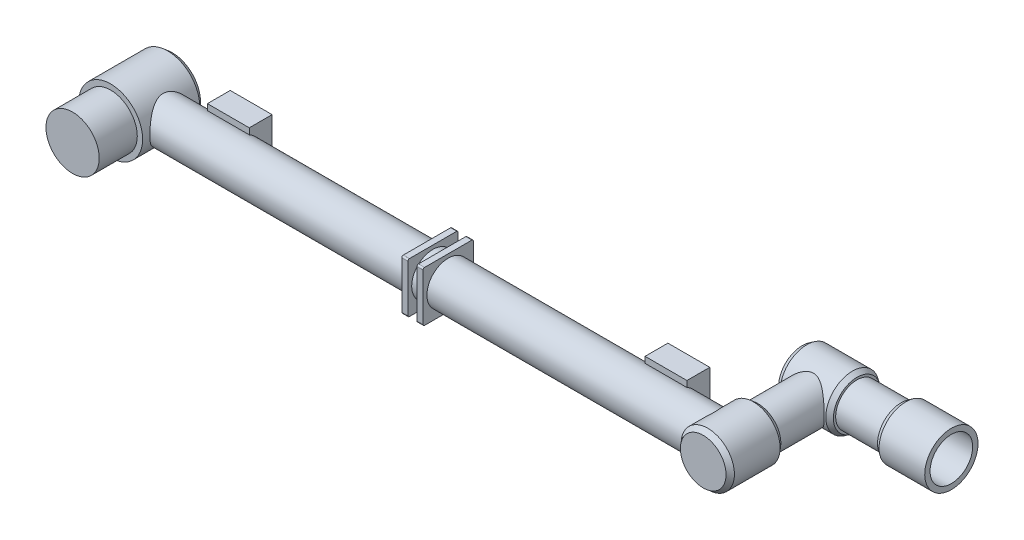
ISO-10303-21;
HEADER;
FILE_DESCRIPTION(('STEP AP214'),'2;1');
FILE_NAME('part.step','',(''),(''),'','','');
FILE_SCHEMA(('AUTOMOTIVE_DESIGN { 1 0 10303 214 1 1 1 1 }'));
ENDSEC;
DATA;
#1=APPLICATION_CONTEXT('core data for automotive mechanical design processes');
#2=APPLICATION_PROTOCOL_DEFINITION('international standard','automotive_design',2000,#1);
#3=PRODUCT_CONTEXT('',#1,'mechanical');
#4=PRODUCT('Part','Part','',(#3));
#5=PRODUCT_RELATED_PRODUCT_CATEGORY('part','',(#4));
#6=PRODUCT_DEFINITION_FORMATION('','',#4);
#7=PRODUCT_DEFINITION_CONTEXT('part definition',#1,'design');
#8=PRODUCT_DEFINITION('design','',#6,#7);
#9=PRODUCT_DEFINITION_SHAPE('','',#8);
#10=(LENGTH_UNIT() NAMED_UNIT(*) SI_UNIT(.MILLI.,.METRE.));
#11=(NAMED_UNIT(*) PLANE_ANGLE_UNIT() SI_UNIT($,.RADIAN.));
#12=(NAMED_UNIT(*) SI_UNIT($,.STERADIAN.) SOLID_ANGLE_UNIT());
#13=UNCERTAINTY_MEASURE_WITH_UNIT(LENGTH_MEASURE(1.E-05),#10,'distance_accuracy_value','');
#14=(GEOMETRIC_REPRESENTATION_CONTEXT(3) GLOBAL_UNCERTAINTY_ASSIGNED_CONTEXT((#13)) GLOBAL_UNIT_ASSIGNED_CONTEXT((#10,
#11,#12)) REPRESENTATION_CONTEXT('',''));
#15=CARTESIAN_POINT('',(0.,0.,0.));
#16=DIRECTION('',(0.,0.,1.));
#17=DIRECTION('',(1.,0.,0.));
#18=AXIS2_PLACEMENT_3D('',#15,#16,#17);
#19=CARTESIAN_POINT('',(3885.,0.,0.));
#20=DIRECTION('',(-1.,0.,0.));
#21=DIRECTION('',(0.,0.,1.));
#22=AXIS2_PLACEMENT_3D('',#19,#20,#21);
#23=CYLINDRICAL_SURFACE('',#22,140.);
#24=DIRECTION('',(-1.,0.,0.));
#25=VECTOR('',#24,1.);
#26=CARTESIAN_POINT('',(3535.,-125.,-63.0476010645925));
#27=LINE('',#26,#25);
#28=CARTESIAN_POINT('',(3535.,-125.,-63.0476010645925));
#29=VERTEX_POINT('',#28);
#30=CARTESIAN_POINT('',(3260.,-125.,-63.0476010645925));
#31=VERTEX_POINT('',#30);
#32=EDGE_CURVE('E332',#29,#31,#27,.T.);
#33=ORIENTED_EDGE('',*,*,#32,.F.);
#34=CARTESIAN_POINT('',(3535.,0.,0.));
#35=DIRECTION('',(-1.,0.,0.));
#36=DIRECTION('',(0.,0.,-1.));
#37=AXIS2_PLACEMENT_3D('',#34,#35,#36);
#38=CIRCLE('',#37,140.);
#39=CARTESIAN_POINT('',(3535.,125.,-63.0476010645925));
#40=VERTEX_POINT('',#39);
#41=EDGE_CURVE('E302',#40,#29,#38,.T.);
#42=ORIENTED_EDGE('',*,*,#41,.F.);
#43=DIRECTION('',(-1.,0.,0.));
#44=VECTOR('',#43,1.);
#45=CARTESIAN_POINT('',(3535.,125.,-63.0476010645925));
#46=LINE('',#45,#44);
#47=CARTESIAN_POINT('',(3260.,125.,-63.0476010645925));
#48=VERTEX_POINT('',#47);
#49=EDGE_CURVE('E335',#40,#48,#46,.T.);
#50=ORIENTED_EDGE('',*,*,#49,.T.);
#51=CARTESIAN_POINT('',(3260.,0.,0.));
#52=DIRECTION('',(-1.,0.,0.));
#53=DIRECTION('',(0.,0.,-1.));
#54=AXIS2_PLACEMENT_3D('',#51,#52,#53);
#55=CIRCLE('',#54,140.);
#56=EDGE_CURVE('E317',#48,#31,#55,.T.);
#57=ORIENTED_EDGE('',*,*,#56,.T.);
#58=EDGE_LOOP('',(#33,#42,#50,#57));
#59=FACE_BOUND('',#58,.T.);
#60=CARTESIAN_POINT('',(3710.,0.,140.));
#61=CARTESIAN_POINT('',(3710.00000183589,-1.68080300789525,139.999998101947));
#62=CARTESIAN_POINT('',(3710.02422893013,-3.36167422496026,139.969717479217));
#63=CARTESIAN_POINT('',(3710.12100265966,-6.72004292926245,139.848721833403));
#64=CARTESIAN_POINT('',(3710.19355607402,-8.39753991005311,139.757998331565));
#65=CARTESIAN_POINT('',(3710.38659860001,-11.7462356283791,139.51646936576));
#66=CARTESIAN_POINT('',(3710.50711028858,-13.4174310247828,139.365635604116));
#67=CARTESIAN_POINT('',(3710.79535193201,-16.7492251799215,139.004572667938));
#68=CARTESIAN_POINT('',(3710.96308017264,-18.4098243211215,138.794345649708));
#69=CARTESIAN_POINT('',(3711.34515009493,-21.7203796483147,138.314959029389));
#70=CARTESIAN_POINT('',(3711.55958061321,-23.3703092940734,138.04568710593));
#71=CARTESIAN_POINT('',(3712.03365081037,-26.6531920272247,137.449592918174));
#72=CARTESIAN_POINT('',(3712.29329097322,-28.2861449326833,137.122770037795));
#73=CARTESIAN_POINT('',(3712.85631031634,-31.5319335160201,136.412963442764));
#74=CARTESIAN_POINT('',(3713.15968374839,-33.1447718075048,136.02998710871));
#75=CARTESIAN_POINT('',(3713.8085792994,-36.3478712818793,135.209339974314));
#76=CARTESIAN_POINT('',(3714.15410128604,-37.9381325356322,134.771669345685));
#77=CARTESIAN_POINT('',(3714.8831557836,-41.0834344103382,133.846260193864));
#78=CARTESIAN_POINT('',(3715.26642757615,-42.6386364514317,133.358864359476));
#79=CARTESIAN_POINT('',(3716.07101238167,-45.7223867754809,132.333306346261));
#80=CARTESIAN_POINT('',(3716.49232909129,-47.250932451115,131.79513923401));
#81=CARTESIAN_POINT('',(3717.37097428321,-50.2791715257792,130.669865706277));
#82=CARTESIAN_POINT('',(3717.82829898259,-51.7788679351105,130.082764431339));
#83=CARTESIAN_POINT('',(3718.77701962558,-54.7480602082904,128.861271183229));
#84=CARTESIAN_POINT('',(3719.26841853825,-56.2175534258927,128.226875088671));
#85=CARTESIAN_POINT('',(3720.28302418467,-59.1243339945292,126.912790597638));
#86=CARTESIAN_POINT('',(3720.80622089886,-60.5616312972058,126.233116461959));
#87=CARTESIAN_POINT('',(3721.88251201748,-63.4034220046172,124.829954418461));
#88=CARTESIAN_POINT('',(3722.43560912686,-64.8079124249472,124.106462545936));
#89=CARTESIAN_POINT('',(3723.56956911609,-67.5830067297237,122.617359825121));
#90=CARTESIAN_POINT('',(3724.15043303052,-68.953609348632,121.851747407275));
#91=CARTESIAN_POINT('',(3725.33779860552,-71.6600682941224,120.280021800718));
#92=CARTESIAN_POINT('',(3725.94430118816,-72.9959233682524,119.473907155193));
#93=CARTESIAN_POINT('',(3727.39621243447,-76.0913887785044,117.535094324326));
#94=CARTESIAN_POINT('',(3728.25125252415,-77.8365284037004,116.386443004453));
#95=CARTESIAN_POINT('',(3729.99895414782,-81.2611345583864,114.021746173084));
#96=CARTESIAN_POINT('',(3730.89161817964,-82.9405967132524,112.805696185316));
#97=CARTESIAN_POINT('',(3732.7096385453,-86.2333082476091,110.309049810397));
#98=CARTESIAN_POINT('',(3733.63500349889,-87.8465399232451,109.028436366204));
#99=CARTESIAN_POINT('',(3735.51304529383,-91.0056433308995,106.40576831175));
#100=CARTESIAN_POINT('',(3736.46572167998,-92.5515161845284,105.06371472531));
#101=CARTESIAN_POINT('',(3738.39579242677,-95.5794864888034,102.316915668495));
#102=CARTESIAN_POINT('',(3739.37324538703,-97.0614048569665,100.912014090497));
#103=CARTESIAN_POINT('',(3741.3451837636,-99.9567992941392,98.0448335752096));
#104=CARTESIAN_POINT('',(3742.33966926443,-101.370275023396,96.5825543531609));
#105=CARTESIAN_POINT('',(3744.34014888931,-104.128324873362,93.6024225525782));
#106=CARTESIAN_POINT('',(3745.3461415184,-105.472907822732,92.0845771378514));
#107=CARTESIAN_POINT('',(3747.36416637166,-108.093069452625,88.9943375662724));
#108=CARTESIAN_POINT('',(3748.37619860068,-109.368648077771,87.4219433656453));
#109=CARTESIAN_POINT('',(3750.41625461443,-111.869836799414,84.198375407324));
#110=CARTESIAN_POINT('',(3751.44428080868,-113.094352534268,82.5463538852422));
#111=CARTESIAN_POINT('',(3753.49389236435,-115.471235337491,79.1872914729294));
#112=CARTESIAN_POINT('',(3754.51547767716,-116.623601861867,77.4802501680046));
#113=CARTESIAN_POINT('',(3756.54536686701,-118.855725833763,74.0106281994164));
#114=CARTESIAN_POINT('',(3757.5536661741,-119.935458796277,72.2480290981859));
#115=CARTESIAN_POINT('',(3759.54870835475,-122.020717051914,68.667580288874));
#116=CARTESIAN_POINT('',(3760.53545149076,-123.026243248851,66.8497312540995));
#117=CARTESIAN_POINT('',(3762.47591385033,-124.958865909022,63.1632898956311));
#118=CARTESIAN_POINT('',(3763.42971604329,-125.886169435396,61.2948500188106));
#119=CARTESIAN_POINT('',(3765.2973361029,-127.663361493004,57.5017634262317));
#120=CARTESIAN_POINT('',(3766.21115196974,-128.513246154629,55.577113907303));
#121=CARTESIAN_POINT('',(3767.98703993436,-130.132278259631,51.6725606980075));
#122=CARTESIAN_POINT('',(3768.84914836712,-130.901482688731,49.6926972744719));
#123=CARTESIAN_POINT('',(3770.50973658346,-132.356330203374,45.6767105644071));
#124=CARTESIAN_POINT('',(3771.30822779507,-133.04198830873,43.6405974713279));
#125=CARTESIAN_POINT('',(3772.94200255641,-134.422147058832,39.2028779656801));
#126=CARTESIAN_POINT('',(3773.76484711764,-135.10255475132,36.7922501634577));
#127=CARTESIAN_POINT('',(3775.28557063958,-136.340408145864,31.9006744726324));
#128=CARTESIAN_POINT('',(3775.98346941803,-136.897873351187,29.4197378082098));
#129=CARTESIAN_POINT('',(3776.91822401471,-137.635338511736,25.6543667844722));
#130=CARTESIAN_POINT('',(3777.21090552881,-137.86453674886,24.3931132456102));
#131=CARTESIAN_POINT('',(3777.75648240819,-138.289361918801,21.8564732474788));
#132=CARTESIAN_POINT('',(3778.00938189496,-138.4849923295,20.5810882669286));
#133=CARTESIAN_POINT('',(3778.4727741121,-138.84176494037,18.0177420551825));
#134=CARTESIAN_POINT('',(3778.6832638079,-139.00290467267,16.7297799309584));
#135=CARTESIAN_POINT('',(3779.05945720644,-139.289832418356,14.1433877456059));
#136=CARTESIAN_POINT('',(3779.22516084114,-139.415620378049,12.8449576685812));
#137=CARTESIAN_POINT('',(3779.5110840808,-139.632092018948,10.2282810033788));
#138=CARTESIAN_POINT('',(3779.63088179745,-139.722450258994,8.90996117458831));
#139=CARTESIAN_POINT('',(3779.82135007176,-139.865885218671,6.26774170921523));
#140=CARTESIAN_POINT('',(3779.89202064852,-139.918961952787,4.943842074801));
#141=CARTESIAN_POINT('',(3779.98330785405,-139.987491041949,2.29339302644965));
#142=CARTESIAN_POINT('',(3780.00392655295,-140.002944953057,0.966843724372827));
#143=CARTESIAN_POINT('',(3779.99484210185,-139.99613153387,-1.68598659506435));
#144=CARTESIAN_POINT('',(3779.96513888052,-139.973864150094,-3.01226761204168));
#145=CARTESIAN_POINT('',(3779.85576513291,-139.891724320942,-5.66254597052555));
#146=CARTESIAN_POINT('',(3779.77605878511,-139.83182491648,-6.98654099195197));
#147=CARTESIAN_POINT('',(3779.56768729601,-139.674780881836,-9.62843162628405));
#148=CARTESIAN_POINT('',(3779.43902236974,-139.577636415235,-10.9463272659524));
#149=CARTESIAN_POINT('',(3779.13434158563,-139.346685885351,-13.5735101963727));
#150=CARTESIAN_POINT('',(3778.95832128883,-139.212876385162,-14.882796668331));
#151=CARTESIAN_POINT('',(3778.56104749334,-138.909365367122,-17.4903193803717));
#152=CARTESIAN_POINT('',(3778.33979195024,-138.739662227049,-18.7885551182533));
#153=CARTESIAN_POINT('',(3777.81659424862,-138.335979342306,-21.5739331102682));
#154=CARTESIAN_POINT('',(3777.50744511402,-138.09609811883,-23.0588696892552));
#155=CARTESIAN_POINT('',(3776.83629937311,-137.571055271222,-26.0086403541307));
#156=CARTESIAN_POINT('',(3776.47430052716,-137.285891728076,-27.4734735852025));
#157=CARTESIAN_POINT('',(3775.70200629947,-136.671839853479,-30.381183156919));
#158=CARTESIAN_POINT('',(3775.2917068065,-136.342947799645,-31.8240576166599));
#159=CARTESIAN_POINT('',(3774.42747675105,-135.643011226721,-34.6863783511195));
#160=CARTESIAN_POINT('',(3773.97354130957,-135.271961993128,-36.1058219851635));
#161=CARTESIAN_POINT('',(3772.55103331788,-134.096026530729,-40.3339489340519));
#162=CARTESIAN_POINT('',(3771.52349006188,-133.22970975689,-43.1060520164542));
#163=CARTESIAN_POINT('',(3769.34671218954,-131.344544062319,-48.54799435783));
#164=CARTESIAN_POINT('',(3768.19746784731,-130.325682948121,-51.2178254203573));
#165=CARTESIAN_POINT('',(3766.11182496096,-128.42141115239,-55.7890107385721));
#166=CARTESIAN_POINT('',(3765.19564764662,-127.567981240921,-57.7130902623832));
#167=CARTESIAN_POINT('',(3763.32345109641,-125.783502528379,-61.505304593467));
#168=CARTESIAN_POINT('',(3762.36742787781,-124.852445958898,-63.3734337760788));
#169=CARTESIAN_POINT('',(3760.42511280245,-122.914525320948,-67.0548144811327));
#170=CARTESIAN_POINT('',(3759.43880944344,-121.907632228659,-68.8680446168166));
#171=CARTESIAN_POINT('',(3757.44504797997,-119.819938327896,-72.4393565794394));
#172=CARTESIAN_POINT('',(3756.43759048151,-118.739139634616,-74.1974399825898));
#173=CARTESIAN_POINT('',(3754.40816628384,-116.503454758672,-77.6607892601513));
#174=CARTESIAN_POINT('',(3753.38618406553,-115.348483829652,-79.3659912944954));
#175=CARTESIAN_POINT('',(3751.33600653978,-112.966394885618,-82.7213806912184));
#176=CARTESIAN_POINT('',(3750.30781119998,-111.739276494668,-84.3715677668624));
#177=CARTESIAN_POINT('',(3748.2519707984,-109.213677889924,-87.6161990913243));
#178=CARTESIAN_POINT('',(3747.22432567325,-107.91520968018,-89.2106526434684));
#179=CARTESIAN_POINT('',(3745.17556728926,-105.247124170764,-92.3432496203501));
#180=CARTESIAN_POINT('',(3744.15445404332,-103.877506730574,-93.8813929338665));
#181=CARTESIAN_POINT('',(3742.09738711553,-101.029751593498,-96.9405621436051));
#182=CARTESIAN_POINT('',(3741.06176952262,-99.5496889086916,-98.4600235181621));
#183=CARTESIAN_POINT('',(3739.00967346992,-96.5151774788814,-101.436370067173));
#184=CARTESIAN_POINT('',(3737.99319513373,-94.9607282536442,-102.893254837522));
#185=CARTESIAN_POINT('',(3735.98515081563,-91.7775386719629,-105.742359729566));
#186=CARTESIAN_POINT('',(3734.99358940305,-90.1487848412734,-107.134568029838));
#187=CARTESIAN_POINT('',(3733.04148075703,-86.817825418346,-109.851189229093));
#188=CARTESIAN_POINT('',(3732.0809327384,-85.1156216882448,-111.175603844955));
#189=CARTESIAN_POINT('',(3730.19881886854,-81.6424328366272,-113.75049796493));
#190=CARTESIAN_POINT('',(3729.27716998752,-79.8716114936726,-115.001137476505));
#191=CARTESIAN_POINT('',(3727.47638603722,-76.2586717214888,-117.42806607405));
#192=CARTESIAN_POINT('',(3726.59725199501,-74.4165515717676,-118.604353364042));
#193=CARTESIAN_POINT('',(3724.88772777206,-70.6633639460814,-120.878042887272));
#194=CARTESIAN_POINT('',(3724.057319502,-68.7523224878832,-121.975474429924));
#195=CARTESIAN_POINT('',(3722.45083404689,-64.8628910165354,-124.087474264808));
#196=CARTESIAN_POINT('',(3721.67475168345,-62.8845074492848,-125.102050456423));
#197=CARTESIAN_POINT('',(3720.39735514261,-59.4416008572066,-126.764452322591));
#198=CARTESIAN_POINT('',(3719.88120993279,-57.9929296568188,-127.433836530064));
#199=CARTESIAN_POINT('',(3718.88155666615,-55.0641143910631,-128.726474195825));
#200=CARTESIAN_POINT('',(3718.3980470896,-53.5839717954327,-129.349729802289));
#201=CARTESIAN_POINT('',(3717.4657836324,-50.5938587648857,-130.548287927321));
#202=CARTESIAN_POINT('',(3717.0170252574,-49.0838922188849,-131.123596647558));
#203=CARTESIAN_POINT('',(3716.15619958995,-46.0356301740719,-132.224607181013));
#204=CARTESIAN_POINT('',(3715.74413276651,-44.4973343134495,-132.75030836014));
#205=CARTESIAN_POINT('',(3714.95884242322,-41.3952087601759,-133.750106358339));
#206=CARTESIAN_POINT('',(3714.58559859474,-39.8313929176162,-134.224230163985));
#207=CARTESIAN_POINT('',(3713.87954157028,-36.6796488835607,-135.119528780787));
#208=CARTESIAN_POINT('',(3713.5467282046,-35.0917207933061,-135.540703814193));
#209=CARTESIAN_POINT('',(3712.92322049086,-31.8941273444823,-136.328559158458));
#210=CARTESIAN_POINT('',(3712.63252800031,-30.2844610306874,-136.695237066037));
#211=CARTESIAN_POINT('',(3712.09482474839,-27.0461508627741,-137.372639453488));
#212=CARTESIAN_POINT('',(3711.84781405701,-25.4175069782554,-137.683363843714));
#213=CARTESIAN_POINT('',(3711.39764357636,-22.1354889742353,-138.249078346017));
#214=CARTESIAN_POINT('',(3711.19472300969,-20.4820295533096,-138.503764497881));
#215=CARTESIAN_POINT('',(3710.83556110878,-17.1620513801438,-138.954201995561));
#216=CARTESIAN_POINT('',(3710.6793198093,-15.495532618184,-139.149953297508));
#217=CARTESIAN_POINT('',(3710.41442986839,-12.1527672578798,-139.481652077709));
#218=CARTESIAN_POINT('',(3710.30578157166,-10.4765205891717,-139.617599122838));
#219=CARTESIAN_POINT('',(3710.13672644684,-7.11779098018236,-139.82906877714));
#220=CARTESIAN_POINT('',(3710.07631954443,-5.43530804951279,-139.904591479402));
#221=CARTESIAN_POINT('',(3710.00411571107,-2.06790525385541,-139.994857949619));
#222=CARTESIAN_POINT('',(3709.9923119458,-0.382985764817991,-140.0096102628));
#223=CARTESIAN_POINT('',(3710.01736723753,2.98593306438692,-139.978290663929));
#224=CARTESIAN_POINT('',(3710.0542265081,4.66993240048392,-139.932218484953));
#225=CARTESIAN_POINT('',(3710.17638210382,8.03332891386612,-139.779467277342));
#226=CARTESIAN_POINT('',(3710.26167604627,9.71272631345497,-139.672791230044));
#227=CARTESIAN_POINT('',(3710.48018855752,13.0634643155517,-139.399323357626));
#228=CARTESIAN_POINT('',(3710.61340633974,14.7348050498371,-139.232532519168));
#229=CARTESIAN_POINT('',(3710.91423875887,17.9307163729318,-138.855551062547));
#230=CARTESIAN_POINT('',(3711.07818086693,19.4561822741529,-138.649985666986));
#231=CARTESIAN_POINT('',(3711.44505171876,22.4949334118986,-138.18950554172));
#232=CARTESIAN_POINT('',(3711.64798058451,24.0082186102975,-137.934590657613));
#233=CARTESIAN_POINT('',(3712.09183786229,27.0200742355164,-137.376348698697));
#234=CARTESIAN_POINT('',(3712.33276323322,28.518645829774,-137.073025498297));
#235=CARTESIAN_POINT('',(3712.8515085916,31.4989649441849,-136.418997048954));
#236=CARTESIAN_POINT('',(3713.12932877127,32.9807123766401,-136.068291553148));
#237=CARTESIAN_POINT('',(3713.72065586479,35.9255061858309,-135.320604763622));
#238=CARTESIAN_POINT('',(3714.03416779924,37.3885498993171,-134.923616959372));
#239=CARTESIAN_POINT('',(3714.69551221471,40.2939365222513,-134.084619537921));
#240=CARTESIAN_POINT('',(3715.04334737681,41.7362778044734,-133.642606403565));
#241=CARTESIAN_POINT('',(3715.77185132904,44.5983651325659,-132.714915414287));
#242=CARTESIAN_POINT('',(3716.15251872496,46.0181121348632,-132.229239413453));
#243=CARTESIAN_POINT('',(3716.94520553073,48.833649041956,-131.21552406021));
#244=CARTESIAN_POINT('',(3717.35722769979,50.2294368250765,-130.687480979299));
#245=CARTESIAN_POINT('',(3718.23735307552,53.0808895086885,-129.556606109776));
#246=CARTESIAN_POINT('',(3718.70734776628,54.5349393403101,-128.951170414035));
#247=CARTESIAN_POINT('',(3719.67893428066,57.4130042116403,-127.695781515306));
#248=CARTESIAN_POINT('',(3720.18052889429,58.8370165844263,-127.045824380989));
#249=CARTESIAN_POINT('',(3721.72969205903,63.0618822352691,-125.031720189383));
#250=CARTESIAN_POINT('',(3722.8218175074,65.8161354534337,-123.603112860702));
#251=CARTESIAN_POINT('',(3725.10825651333,71.1910277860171,-120.587462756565));
#252=CARTESIAN_POINT('',(3726.30255779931,73.8116828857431,-119.000439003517));
#253=CARTESIAN_POINT('',(3728.77761104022,78.9151973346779,-115.679129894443));
#254=CARTESIAN_POINT('',(3730.05836797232,81.3980487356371,-113.944836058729));
#255=CARTESIAN_POINT('',(3732.93943625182,86.6790821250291,-109.998021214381));
#256=CARTESIAN_POINT('',(3734.55436558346,89.4480661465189,-107.757096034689));
#257=CARTESIAN_POINT('',(3737.8575774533,94.7837127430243,-103.095107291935));
#258=CARTESIAN_POINT('',(3739.54586835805,97.3503521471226,-100.674023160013));
#259=CARTESIAN_POINT('',(3742.11485528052,101.04998778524,-96.9123528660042));
#260=CARTESIAN_POINT('',(3742.97855288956,102.259787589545,-95.6348447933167));
#261=CARTESIAN_POINT('',(3744.71400531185,104.627883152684,-93.0381307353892));
#262=CARTESIAN_POINT('',(3745.58576008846,105.786179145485,-91.7189249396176));
#263=CARTESIAN_POINT('',(3747.3336507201,108.051018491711,-89.0396237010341));
#264=CARTESIAN_POINT('',(3748.2097866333,109.157561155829,-87.6795277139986));
#265=CARTESIAN_POINT('',(3749.9626175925,111.318646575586,-84.9189711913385));
#266=CARTESIAN_POINT('',(3750.83931264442,112.37318877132,-83.5185102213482));
#267=CARTESIAN_POINT('',(3752.77606160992,114.649528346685,-80.3742176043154));
#268=CARTESIAN_POINT('',(3753.83530085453,115.858966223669,-78.6209125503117));
#269=CARTESIAN_POINT('',(3755.94090701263,118.199953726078,-75.0554421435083));
#270=CARTESIAN_POINT('',(3756.98727343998,119.331500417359,-73.2432745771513));
#271=CARTESIAN_POINT('',(3759.0590921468,121.516068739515,-69.558855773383));
#272=CARTESIAN_POINT('',(3760.08453256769,122.569046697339,-67.686571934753));
#273=CARTESIAN_POINT('',(3762.10427233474,124.594080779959,-63.8823773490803));
#274=CARTESIAN_POINT('',(3763.09857241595,125.566138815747,-61.950468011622));
#275=CARTESIAN_POINT('',(3765.04183856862,127.423859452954,-58.0331176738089));
#276=CARTESIAN_POINT('',(3765.99095048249,128.309811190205,-56.047886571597));
#277=CARTESIAN_POINT('',(3767.83545688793,129.996274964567,-52.0167508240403));
#278=CARTESIAN_POINT('',(3768.7308476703,130.79678110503,-49.9708420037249));
#279=CARTESIAN_POINT('',(3770.45326960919,132.307814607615,-45.8204505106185));
#280=CARTESIAN_POINT('',(3771.28037042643,133.01843406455,-43.7160305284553));
#281=CARTESIAN_POINT('',(3772.85181180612,134.345978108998,-39.4480909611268));
#282=CARTESIAN_POINT('',(3773.59617302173,134.962926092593,-37.2845862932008));
#283=CARTESIAN_POINT('',(3775.03901720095,136.141529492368,-32.7325797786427));
#284=CARTESIAN_POINT('',(3775.72966024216,136.695368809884,-30.3395098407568));
#285=CARTESIAN_POINT('',(3776.66341267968,137.434861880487,-26.705579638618));
#286=CARTESIAN_POINT('',(3776.95763636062,137.666154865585,-25.4868400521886));
#287=CARTESIAN_POINT('',(3777.50946075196,138.097453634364,-23.0356519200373));
#288=CARTESIAN_POINT('',(3777.76706503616,138.297462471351,-21.8032047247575));
#289=CARTESIAN_POINT('',(3778.24269008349,138.664944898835,-19.3285945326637));
#290=CARTESIAN_POINT('',(3778.46079224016,138.832485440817,-18.0864571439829));
#291=CARTESIAN_POINT('',(3778.85581774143,139.134734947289,-15.5917908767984));
#292=CARTESIAN_POINT('',(3779.03274538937,139.269447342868,-14.3392630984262));
#293=CARTESIAN_POINT('',(3779.34352814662,139.505369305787,-11.8256294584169));
#294=CARTESIAN_POINT('',(3779.47738029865,139.606576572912,-10.5645230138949));
#295=CARTESIAN_POINT('',(3779.7004607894,139.774914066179,-8.03608687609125));
#296=CARTESIAN_POINT('',(3779.78968906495,139.842044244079,-6.76875717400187));
#297=CARTESIAN_POINT('',(3779.9228234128,139.942109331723,-4.22339710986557));
#298=CARTESIAN_POINT('',(3779.96647884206,139.974855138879,-2.94534613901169));
#299=CARTESIAN_POINT('',(3780.00706627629,140.005301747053,-0.388083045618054));
#300=CARTESIAN_POINT('',(3780.00399829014,140.003002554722,0.891129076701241));
#301=CARTESIAN_POINT('',(3779.95117757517,139.963373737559,3.44801205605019));
#302=CARTESIAN_POINT('',(3779.9014259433,139.926044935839,4.72568294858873));
#303=CARTESIAN_POINT('',(3779.75584923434,139.816583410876,7.27689534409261));
#304=CARTESIAN_POINT('',(3779.6600240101,139.744450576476,8.55043683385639));
#305=CARTESIAN_POINT('',(3779.42328667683,139.56568201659,11.0926238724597));
#306=CARTESIAN_POINT('',(3779.28231363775,139.458999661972,12.3612604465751));
#307=CARTESIAN_POINT('',(3778.95695006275,139.211756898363,14.8896007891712));
#308=CARTESIAN_POINT('',(3778.77255982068,139.071196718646,16.1493046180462));
#309=CARTESIAN_POINT('',(3778.36236189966,138.756912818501,18.6579008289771));
#310=CARTESIAN_POINT('',(3778.13654995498,138.583185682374,19.9067920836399));
#311=CARTESIAN_POINT('',(3777.64584517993,138.2034067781,22.3919340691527));
#312=CARTESIAN_POINT('',(3777.38095030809,137.997353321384,23.6281841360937));
#313=CARTESIAN_POINT('',(3776.7369557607,137.492993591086,26.4236469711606));
#314=CARTESIAN_POINT('',(3776.34645589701,137.184882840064,27.9784852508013));
#315=CARTESIAN_POINT('',(3775.51165751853,136.519551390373,31.062878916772));
#316=CARTESIAN_POINT('',(3775.0673552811,136.162327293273,32.5924325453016));
#317=CARTESIAN_POINT('',(3773.6618872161,135.019556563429,37.1415422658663));
#318=CARTESIAN_POINT('',(3772.62817202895,134.162920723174,40.1214965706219));
#319=CARTESIAN_POINT('',(3770.96436440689,132.745650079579,44.5080209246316));
#320=CARTESIAN_POINT('',(3770.39007259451,132.250446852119,45.9581167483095));
#321=CARTESIAN_POINT('',(3769.20873332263,131.217368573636,48.8295946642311));
#322=CARTESIAN_POINT('',(3768.60168660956,130.679494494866,50.2509774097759));
#323=CARTESIAN_POINT('',(3767.35951773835,129.562397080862,53.0648387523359));
#324=CARTESIAN_POINT('',(3766.72439564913,128.983173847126,54.457317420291));
#325=CARTESIAN_POINT('',(3765.43029691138,127.784444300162,57.2135842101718));
#326=CARTESIAN_POINT('',(3764.77131929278,127.164936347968,58.5773711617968));
#327=CARTESIAN_POINT('',(3763.12974557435,125.596376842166,61.8891323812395));
#328=CARTESIAN_POINT('',(3762.13603994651,124.625392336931,63.8212593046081));
#329=CARTESIAN_POINT('',(3760.11736407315,122.602486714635,67.6259765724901));
#330=CARTESIAN_POINT('',(3759.09239111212,121.550558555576,69.4985617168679));
#331=CARTESIAN_POINT('',(3757.02047433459,119.367109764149,73.1852744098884));
#332=CARTESIAN_POINT('',(3755.97352302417,118.235561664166,74.999381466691));
#333=CARTESIAN_POINT('',(3753.86664514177,115.894449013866,78.5686428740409));
#334=CARTESIAN_POINT('',(3752.80671889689,114.684886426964,80.3237987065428));
#335=CARTESIAN_POINT('',(3750.68065814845,112.187372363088,83.7767137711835));
#336=CARTESIAN_POINT('',(3749.61451868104,110.899347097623,85.4744165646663));
#337=CARTESIAN_POINT('',(3747.48424654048,108.246531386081,88.8100748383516));
#338=CARTESIAN_POINT('',(3746.42011387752,106.881740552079,90.4480300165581));
#339=CARTESIAN_POINT('',(3744.30077389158,104.07602174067,93.662867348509));
#340=CARTESIAN_POINT('',(3743.24556524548,102.635105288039,95.2397586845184));
#341=CARTESIAN_POINT('',(3741.15033734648,99.6772758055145,98.3311597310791));
#342=CARTESIAN_POINT('',(3740.11031809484,98.1603627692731,99.8456694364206));
#343=CARTESIAN_POINT('',(3738.03803592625,95.0302616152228,102.829892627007));
#344=CARTESIAN_POINT('',(3737.00605845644,93.4160640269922,104.298746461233));
#345=CARTESIAN_POINT('',(3734.97040610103,90.1104254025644,107.167628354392));
#346=CARTESIAN_POINT('',(3733.96673135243,88.418983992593,108.567656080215));
#347=CARTESIAN_POINT('',(3731.9937680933,84.959163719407,111.295978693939));
#348=CARTESIAN_POINT('',(3731.02448660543,83.190769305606,112.624258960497));
#349=CARTESIAN_POINT('',(3729.12681615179,79.5783457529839,115.205096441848));
#350=CARTESIAN_POINT('',(3728.19842676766,77.7343173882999,116.457654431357));
#351=CARTESIAN_POINT('',(3726.39100047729,73.9764950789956,118.880037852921));
#352=CARTESIAN_POINT('',(3725.51185112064,72.0628780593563,120.050053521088));
#353=CARTESIAN_POINT('',(3723.8067909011,68.163605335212,122.306158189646));
#354=CARTESIAN_POINT('',(3722.98088168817,66.1779474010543,123.39224458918));
#355=CARTESIAN_POINT('',(3721.38906204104,62.1383276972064,125.475056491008));
#356=CARTESIAN_POINT('',(3720.62312089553,60.084401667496,126.471827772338));
#357=CARTESIAN_POINT('',(3719.15708716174,55.9108094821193,128.37147896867));
#358=CARTESIAN_POINT('',(3718.45698634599,53.791151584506,129.274370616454));
#359=CARTESIAN_POINT('',(3717.34579528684,50.1932664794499,130.702189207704));
#360=CARTESIAN_POINT('',(3716.91502250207,48.7317803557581,131.254212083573));
#361=CARTESIAN_POINT('',(3716.08787517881,45.7825203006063,132.311808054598));
#362=CARTESIAN_POINT('',(3715.69149906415,44.2947475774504,132.817383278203));
#363=CARTESIAN_POINT('',(3714.93489929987,41.2947290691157,133.78051897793));
#364=CARTESIAN_POINT('',(3714.57467426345,39.7824842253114,134.23808129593));
#365=CARTESIAN_POINT('',(3713.89200729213,36.7354378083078,135.103723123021));
#366=CARTESIAN_POINT('',(3713.56956561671,35.200636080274,135.511802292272));
#367=CARTESIAN_POINT('',(3712.9646904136,32.1141671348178,136.276198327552));
#368=CARTESIAN_POINT('',(3712.68216880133,30.5625454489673,136.632629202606));
#369=CARTESIAN_POINT('',(3712.15767749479,27.4414914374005,137.293513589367));
#370=CARTESIAN_POINT('',(3711.91570711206,25.8720594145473,137.597967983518));
#371=CARTESIAN_POINT('',(3711.47362757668,22.71854351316,138.15364725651));
#372=CARTESIAN_POINT('',(3711.27350325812,21.134465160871,138.404891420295));
#373=CARTESIAN_POINT('',(3710.91607515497,17.9540323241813,138.853272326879));
#374=CARTESIAN_POINT('',(3710.75876603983,16.3576793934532,139.050415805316));
#375=CARTESIAN_POINT('',(3710.51983764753,13.5343266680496,139.349679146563));
#376=CARTESIAN_POINT('',(3710.42911628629,12.3092898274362,139.463245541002));
#377=CARTESIAN_POINT('',(3710.27340129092,9.85529393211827,139.658110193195));
#378=CARTESIAN_POINT('',(3710.20840165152,8.62633586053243,139.739415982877));
#379=CARTESIAN_POINT('',(3710.10430044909,6.16534044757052,139.869608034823));
#380=CARTESIAN_POINT('',(3710.06520446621,4.93330250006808,139.918487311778));
#381=CARTESIAN_POINT('',(3710.01305029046,2.46752218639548,139.983688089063));
#382=CARTESIAN_POINT('',(3709.99999865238,1.23377946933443,140.00000139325));
#383=CARTESIAN_POINT('',(3710.,0.,140.));
#384=B_SPLINE_CURVE_WITH_KNOTS('',3,(#60,#61,#62,#63,#64,#65,#66,#67,#68,#69,#70,#71,#72,#73,
#74,#75,#76,#77,#78,#79,#80,#81,#82,#83,#84,#85,#86,#87,#88,#89,#90,#91,#92,#93,#94,#95,#96,#97,
#98,#99,#100,#101,#102,#103,#104,#105,#106,#107,#108,#109,#110,#111,#112,#113,#114,#115,#116,
#117,#118,#119,#120,#121,#122,#123,#124,#125,#126,#127,#128,#129,#130,#131,#132,#133,#134,#135,
#136,#137,#138,#139,#140,#141,#142,#143,#144,#145,#146,#147,#148,#149,#150,#151,#152,#153,#154,
#155,#156,#157,#158,#159,#160,#161,#162,#163,#164,#165,#166,#167,#168,#169,#170,#171,#172,#173,
#174,#175,#176,#177,#178,#179,#180,#181,#182,#183,#184,#185,#186,#187,#188,#189,#190,#191,#192,
#193,#194,#195,#196,#197,#198,#199,#200,#201,#202,#203,#204,#205,#206,#207,#208,#209,#210,#211,
#212,#213,#214,#215,#216,#217,#218,#219,#220,#221,#222,#223,#224,#225,#226,#227,#228,#229,#230,
#231,#232,#233,#234,#235,#236,#237,#238,#239,#240,#241,#242,#243,#244,#245,#246,#247,#248,#249,
#250,#251,#252,#253,#254,#255,#256,#257,#258,#259,#260,#261,#262,#263,#264,#265,#266,#267,#268,
#269,#270,#271,#272,#273,#274,#275,#276,#277,#278,#279,#280,#281,#282,#283,#284,#285,#286,#287,
#288,#289,#290,#291,#292,#293,#294,#295,#296,#297,#298,#299,#300,#301,#302,#303,#304,#305,#306,
#307,#308,#309,#310,#311,#312,#313,#314,#315,#316,#317,#318,#319,#320,#321,#322,#323,#324,#325,
#326,#327,#328,#329,#330,#331,#332,#333,#334,#335,#336,#337,#338,#339,#340,#341,#342,#343,#344,
#345,#346,#347,#348,#349,#350,#351,#352,#353,#354,#355,#356,#357,#358,#359,#360,#361,#362,#363,
#364,#365,#366,#367,#368,#369,#370,#371,#372,#373,#374,#375,#376,#377,#378,#379,#380,#381,#382,
#383),.UNSPECIFIED.,.T.,.F.,(4,2,2,2,2,2,2,2,2,2,2,2,2,2,2,2,2,2,2,2,2,2,2,2,2,2,2,2,2,2,2,2,2,
2,2,2,2,2,2,2,2,2,2,2,2,2,2,2,2,2,2,2,2,2,2,2,2,2,2,2,2,2,2,2,2,2,2,2,2,2,2,2,2,2,2,2,2,2,2,2,2,
2,2,2,2,2,2,2,2,2,2,2,2,2,2,2,2,2,2,2,2,2,2,2,2,2,2,2,2,2,2,2,2,2,2,2,2,2,2,2,2,2,2,2,2,2,2,2,2,
2,2,2,2,2,2,2,2,2,2,2,2,2,2,2,2,2,2,2,2,2,2,2,2,2,2,2,2,2,2,2,2,4),(0.,5.04208097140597,
10.0848693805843,15.1300345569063,20.1750165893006,25.2296802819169,30.284398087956,
35.3384521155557,40.3924902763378,45.4137899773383,50.4355780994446,55.4568393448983,
60.4785386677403,65.4986637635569,70.519243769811,75.5400109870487,80.5609589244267,
87.330784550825,94.1010603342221,100.873134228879,107.645095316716,114.434928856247,
121.224796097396,128.013791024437,134.80279139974,141.698034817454,148.593330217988,
155.490938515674,162.388462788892,169.26711482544,176.146110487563,183.020214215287,
189.89308029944,197.796597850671,205.698860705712,209.642636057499,213.586002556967,
217.52965111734,221.473305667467,225.452380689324,229.431454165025,233.41036306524,
237.389277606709,241.371045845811,245.352796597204,249.334920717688,253.31722484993,
257.922261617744,262.527493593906,267.133117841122,271.739257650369,280.971710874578,
290.204902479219,297.08939751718,303.974582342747,310.862415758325,317.750052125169,
324.645703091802,331.541389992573,338.435920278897,345.330464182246,352.409852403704,
359.489286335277,366.57000917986,373.650552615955,380.71512750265,387.779872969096,
394.841978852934,401.903410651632,406.933990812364,411.964336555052,416.994030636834,
422.023789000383,427.050902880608,432.077995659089,437.105310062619,442.132632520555,
447.186586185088,452.240543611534,457.294537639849,462.348523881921,467.401799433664,
472.455097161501,477.508146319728,482.561112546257,487.203675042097,491.846252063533,
496.488457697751,501.130687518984,505.773571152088,510.41681774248,515.059867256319,
519.703325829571,524.633115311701,529.563340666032,539.421875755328,549.279228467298,
559.137149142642,570.859884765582,582.58396084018,588.463044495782,594.342101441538,
600.221236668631,606.100435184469,613.234844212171,620.369521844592,627.508136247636,
634.646582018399,641.760163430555,648.874235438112,655.980958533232,663.085903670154,
670.733222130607,674.557140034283,678.38068449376,682.196258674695,686.011433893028,
689.826870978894,693.642313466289,697.478631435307,701.314948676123,705.151175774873,
708.987415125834,712.828853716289,716.670266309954,720.51207472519,724.354083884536,
729.249383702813,734.145022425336,743.936457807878,748.844895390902,753.753221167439,
758.661534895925,763.570048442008,770.70680256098,777.844178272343,784.984028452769,
792.123699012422,799.270190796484,806.416718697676,813.562167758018,820.707617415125,
827.947761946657,835.187941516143,842.429591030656,849.671166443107,856.895466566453,
864.119990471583,871.340789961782,878.560685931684,883.421266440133,888.281624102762,
893.141795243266,898.00199976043,902.851306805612,907.700531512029,912.547995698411,
917.394856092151,921.095090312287,924.794460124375,928.494626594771,932.195724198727),.UNSPECIFIED.);
#385=CARTESIAN_POINT('',(3710.,0.,140.));
#386=VERTEX_POINT('',#385);
#387=EDGE_CURVE('E446',#386,#386,#384,.T.);
#388=ORIENTED_EDGE('',*,*,#387,.F.);
#389=EDGE_LOOP('',(#388));
#390=FACE_BOUND('',#389,.T.);
#391=CARTESIAN_POINT('',(2030.,0.,0.));
#392=DIRECTION('',(-1.,0.,0.));
#393=DIRECTION('',(0.,0.,1.));
#394=AXIS2_PLACEMENT_3D('',#391,#392,#393);
#395=CIRCLE('',#394,140.);
#396=CARTESIAN_POINT('',(2030.,0.,140.));
#397=VERTEX_POINT('',#396);
#398=EDGE_CURVE('E688',#397,#397,#395,.T.);
#399=ORIENTED_EDGE('',*,*,#398,.F.);
#400=EDGE_LOOP('',(#399));
#401=FACE_BOUND('',#400,.T.);
#402=ADVANCED_FACE('F56',(#59,#390,#401),#23,.T.);
#403=CARTESIAN_POINT('',(3885.,0.,150.));
#404=DIRECTION('',(0.,0.,-1.));
#405=DIRECTION('',(-1.,0.,0.));
#406=AXIS2_PLACEMENT_3D('',#403,#404,#405);
#407=CYLINDRICAL_SURFACE('',#406,175.);
#408=CARTESIAN_POINT('',(3885.,0.,-150.));
#409=DIRECTION('',(0.,0.,1.));
#410=DIRECTION('',(1.,0.,0.));
#411=AXIS2_PLACEMENT_3D('',#408,#409,#410);
#412=CIRCLE('',#411,175.);
#413=CARTESIAN_POINT('',(4060.,0.,-150.));
#414=VERTEX_POINT('',#413);
#415=EDGE_CURVE('E376',#414,#414,#412,.T.);
#416=ORIENTED_EDGE('',*,*,#415,.T.);
#417=EDGE_LOOP('',(#416));
#418=FACE_BOUND('',#417,.T.);
#419=CARTESIAN_POINT('',(3885.,0.,150.));
#420=DIRECTION('',(0.,0.,1.));
#421=DIRECTION('',(1.,0.,0.));
#422=AXIS2_PLACEMENT_3D('',#419,#420,#421);
#423=CIRCLE('',#422,175.);
#424=CARTESIAN_POINT('',(3771.43022497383,133.142428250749,150.));
#425=VERTEX_POINT('',#424);
#426=EDGE_CURVE('E435',#425,#425,#423,.T.);
#427=ORIENTED_EDGE('',*,*,#426,.F.);
#428=EDGE_LOOP('',(#427));
#429=FACE_BOUND('',#428,.T.);
#430=ORIENTED_EDGE('',*,*,#387,.T.);
#431=EDGE_LOOP('',(#430));
#432=FACE_BOUND('',#431,.T.);
#433=ADVANCED_FACE('F473',(#418,#429,#432),#407,.T.);
#434=CARTESIAN_POINT('',(2030.,-165.,-165.));
#435=DIRECTION('',(0.,0.,1.));
#436=DIRECTION('',(1.,0.,0.));
#437=AXIS2_PLACEMENT_3D('',#434,#435,#436);
#438=PLANE('',#437);
#439=DIRECTION('',(0.,1.,0.));
#440=VECTOR('',#439,1.);
#441=CARTESIAN_POINT('',(2030.,-165.,-165.));
#442=LINE('',#441,#440);
#443=CARTESIAN_POINT('',(2030.,-155.,-165.));
#444=VERTEX_POINT('',#443);
#445=CARTESIAN_POINT('',(2030.,155.,-165.));
#446=VERTEX_POINT('',#445);
#447=EDGE_CURVE('E399',#444,#446,#442,.T.);
#448=ORIENTED_EDGE('',*,*,#447,.F.);
#449=DIRECTION('',(-1.,0.,0.));
#450=VECTOR('',#449,1.);
#451=CARTESIAN_POINT('',(2030.,-155.,-165.));
#452=LINE('',#451,#450);
#453=CARTESIAN_POINT('',(1990.,-155.,-165.));
#454=VERTEX_POINT('',#453);
#455=EDGE_CURVE('E632',#444,#454,#452,.T.);
#456=ORIENTED_EDGE('',*,*,#455,.T.);
#457=DIRECTION('',(0.,1.,0.));
#458=VECTOR('',#457,1.);
#459=CARTESIAN_POINT('',(1990.,-165.,-165.));
#460=LINE('',#459,#458);
#461=CARTESIAN_POINT('',(1990.,155.,-165.));
#462=VERTEX_POINT('',#461);
#463=EDGE_CURVE('E398',#454,#462,#460,.T.);
#464=ORIENTED_EDGE('',*,*,#463,.T.);
#465=DIRECTION('',(-1.,0.,0.));
#466=VECTOR('',#465,1.);
#467=CARTESIAN_POINT('',(2030.,155.,-165.));
#468=LINE('',#467,#466);
#469=EDGE_CURVE('E687',#462,#446,#468,.F.);
#470=ORIENTED_EDGE('',*,*,#469,.T.);
#471=EDGE_LOOP('',(#448,#456,#464,#470));
#472=FACE_BOUND('',#471,.T.);
#473=ADVANCED_FACE('F506',(#472),#438,.F.);
#474=CARTESIAN_POINT('',(2030.,165.,165.));
#475=DIRECTION('',(0.,-1.,0.));
#476=DIRECTION('',(0.,0.,-1.));
#477=AXIS2_PLACEMENT_3D('',#474,#475,#476);
#478=PLANE('',#477);
#479=DIRECTION('',(0.,0.,1.));
#480=VECTOR('',#479,1.);
#481=CARTESIAN_POINT('',(1990.,165.,165.));
#482=LINE('',#481,#480);
#483=CARTESIAN_POINT('',(1990.,165.,-155.));
#484=VERTEX_POINT('',#483);
#485=CARTESIAN_POINT('',(1990.,165.,155.));
#486=VERTEX_POINT('',#485);
#487=EDGE_CURVE('E415',#484,#486,#482,.T.);
#488=ORIENTED_EDGE('',*,*,#487,.T.);
#489=DIRECTION('',(-1.,0.,0.));
#490=VECTOR('',#489,1.);
#491=CARTESIAN_POINT('',(2030.,165.,155.));
#492=LINE('',#491,#490);
#493=CARTESIAN_POINT('',(2030.,165.,155.));
#494=VERTEX_POINT('',#493);
#495=EDGE_CURVE('E527',#486,#494,#492,.F.);
#496=ORIENTED_EDGE('',*,*,#495,.T.);
#497=DIRECTION('',(0.,0.,1.));
#498=VECTOR('',#497,1.);
#499=CARTESIAN_POINT('',(2030.,165.,165.));
#500=LINE('',#499,#498);
#501=CARTESIAN_POINT('',(2030.,165.,-155.));
#502=VERTEX_POINT('',#501);
#503=EDGE_CURVE('E402',#502,#494,#500,.T.);
#504=ORIENTED_EDGE('',*,*,#503,.F.);
#505=DIRECTION('',(-1.,0.,0.));
#506=VECTOR('',#505,1.);
#507=CARTESIAN_POINT('',(2030.,165.,-155.));
#508=LINE('',#507,#506);
#509=EDGE_CURVE('E531',#502,#484,#508,.T.);
#510=ORIENTED_EDGE('',*,*,#509,.T.);
#511=EDGE_LOOP('',(#488,#496,#504,#510));
#512=FACE_BOUND('',#511,.T.);
#513=ADVANCED_FACE('F651',(#512),#478,.F.);
#514=CARTESIAN_POINT('',(2030.,-165.,165.));
#515=DIRECTION('',(0.,0.,-1.));
#516=DIRECTION('',(-1.,0.,0.));
#517=AXIS2_PLACEMENT_3D('',#514,#515,#516);
#518=PLANE('',#517);
#519=DIRECTION('',(0.,-1.,0.));
#520=VECTOR('',#519,1.);
#521=CARTESIAN_POINT('',(1990.,-165.,165.));
#522=LINE('',#521,#520);
#523=CARTESIAN_POINT('',(1990.,155.,165.));
#524=VERTEX_POINT('',#523);
#525=CARTESIAN_POINT('',(1990.,-155.,165.));
#526=VERTEX_POINT('',#525);
#527=EDGE_CURVE('E418',#524,#526,#522,.T.);
#528=ORIENTED_EDGE('',*,*,#527,.T.);
#529=DIRECTION('',(-1.,0.,0.));
#530=VECTOR('',#529,1.);
#531=CARTESIAN_POINT('',(2030.,-155.,165.));
#532=LINE('',#531,#530);
#533=CARTESIAN_POINT('',(2030.,-155.,165.));
#534=VERTEX_POINT('',#533);
#535=EDGE_CURVE('E639',#526,#534,#532,.F.);
#536=ORIENTED_EDGE('',*,*,#535,.T.);
#537=DIRECTION('',(0.,-1.,0.));
#538=VECTOR('',#537,1.);
#539=CARTESIAN_POINT('',(2030.,-165.,165.));
#540=LINE('',#539,#538);
#541=CARTESIAN_POINT('',(2030.,155.,165.));
#542=VERTEX_POINT('',#541);
#543=EDGE_CURVE('E406',#542,#534,#540,.T.);
#544=ORIENTED_EDGE('',*,*,#543,.F.);
#545=DIRECTION('',(-1.,0.,0.));
#546=VECTOR('',#545,1.);
#547=CARTESIAN_POINT('',(2030.,155.,165.));
#548=LINE('',#547,#546);
#549=EDGE_CURVE('E635',#542,#524,#548,.T.);
#550=ORIENTED_EDGE('',*,*,#549,.T.);
#551=EDGE_LOOP('',(#528,#536,#544,#550));
#552=FACE_BOUND('',#551,.T.);
#553=ADVANCED_FACE('F678',(#552),#518,.F.);
#554=CARTESIAN_POINT('',(2030.,-165.,165.));
#555=DIRECTION('',(0.,1.,0.));
#556=DIRECTION('',(0.,0.,1.));
#557=AXIS2_PLACEMENT_3D('',#554,#555,#556);
#558=PLANE('',#557);
#559=DIRECTION('',(0.,0.,-1.));
#560=VECTOR('',#559,1.);
#561=CARTESIAN_POINT('',(1990.,-165.,165.));
#562=LINE('',#561,#560);
#563=CARTESIAN_POINT('',(1990.,-165.,155.));
#564=VERTEX_POINT('',#563);
#565=CARTESIAN_POINT('',(1990.,-165.,-155.));
#566=VERTEX_POINT('',#565);
#567=EDGE_CURVE('E403',#564,#566,#562,.T.);
#568=ORIENTED_EDGE('',*,*,#567,.T.);
#569=DIRECTION('',(-1.,0.,0.));
#570=VECTOR('',#569,1.);
#571=CARTESIAN_POINT('',(2030.,-165.,-155.));
#572=LINE('',#571,#570);
#573=CARTESIAN_POINT('',(2030.,-165.,-155.));
#574=VERTEX_POINT('',#573);
#575=EDGE_CURVE('E630',#566,#574,#572,.F.);
#576=ORIENTED_EDGE('',*,*,#575,.T.);
#577=DIRECTION('',(0.,0.,-1.));
#578=VECTOR('',#577,1.);
#579=CARTESIAN_POINT('',(2030.,-165.,165.));
#580=LINE('',#579,#578);
#581=CARTESIAN_POINT('',(2030.,-165.,155.));
#582=VERTEX_POINT('',#581);
#583=EDGE_CURVE('E409',#582,#574,#580,.T.);
#584=ORIENTED_EDGE('',*,*,#583,.F.);
#585=DIRECTION('',(-1.,0.,0.));
#586=VECTOR('',#585,1.);
#587=CARTESIAN_POINT('',(2030.,-165.,155.));
#588=LINE('',#587,#586);
#589=EDGE_CURVE('E668',#582,#564,#588,.T.);
#590=ORIENTED_EDGE('',*,*,#589,.T.);
#591=EDGE_LOOP('',(#568,#576,#584,#590));
#592=FACE_BOUND('',#591,.T.);
#593=ADVANCED_FACE('F683',(#592),#558,.F.);
#594=CARTESIAN_POINT('',(2030.,0.,0.));
#595=DIRECTION('',(-1.,0.,0.));
#596=DIRECTION('',(0.,0.,1.));
#597=AXIS2_PLACEMENT_3D('',#594,#595,#596);
#598=PLANE('',#597);
#599=ORIENTED_EDGE('',*,*,#398,.T.);
#600=EDGE_LOOP('',(#599));
#601=FACE_BOUND('',#600,.T.);
#602=ORIENTED_EDGE('',*,*,#583,.T.);
#603=CARTESIAN_POINT('',(2030.,-155.,-155.));
#604=DIRECTION('',(-1.,0.,0.));
#605=DIRECTION('',(0.,0.,1.));
#606=AXIS2_PLACEMENT_3D('',#603,#604,#605);
#607=CIRCLE('',#606,10.);
#608=EDGE_CURVE('E629',#574,#444,#607,.F.);
#609=ORIENTED_EDGE('',*,*,#608,.T.);
#610=ORIENTED_EDGE('',*,*,#447,.T.);
#611=CARTESIAN_POINT('',(2030.,155.,-155.));
#612=DIRECTION('',(-1.,0.,0.));
#613=DIRECTION('',(0.,0.,1.));
#614=AXIS2_PLACEMENT_3D('',#611,#612,#613);
#615=CIRCLE('',#614,10.);
#616=EDGE_CURVE('E672',#446,#502,#615,.F.);
#617=ORIENTED_EDGE('',*,*,#616,.T.);
#618=ORIENTED_EDGE('',*,*,#503,.T.);
#619=CARTESIAN_POINT('',(2030.,155.,155.));
#620=DIRECTION('',(-1.,0.,0.));
#621=DIRECTION('',(0.,0.,1.));
#622=AXIS2_PLACEMENT_3D('',#619,#620,#621);
#623=CIRCLE('',#622,10.);
#624=EDGE_CURVE('E641',#494,#542,#623,.F.);
#625=ORIENTED_EDGE('',*,*,#624,.T.);
#626=ORIENTED_EDGE('',*,*,#543,.T.);
#627=CARTESIAN_POINT('',(2030.,-155.,155.));
#628=DIRECTION('',(-1.,0.,0.));
#629=DIRECTION('',(0.,0.,1.));
#630=AXIS2_PLACEMENT_3D('',#627,#628,#629);
#631=CIRCLE('',#630,10.);
#632=EDGE_CURVE('E636',#534,#582,#631,.F.);
#633=ORIENTED_EDGE('',*,*,#632,.T.);
#634=EDGE_LOOP('',(#602,#609,#610,#617,#618,#625,#626,#633));
#635=FACE_BOUND('',#634,.T.);
#636=ADVANCED_FACE('F675',(#601,#635),#598,.F.);
#637=CARTESIAN_POINT('',(1990.,0.,0.));
#638=DIRECTION('',(-1.,0.,0.));
#639=DIRECTION('',(0.,0.,1.));
#640=AXIS2_PLACEMENT_3D('',#637,#638,#639);
#641=PLANE('',#640);
#642=CARTESIAN_POINT('',(1990.,0.,0.));
#643=DIRECTION('',(-1.,0.,0.));
#644=DIRECTION('',(0.,0.,1.));
#645=AXIS2_PLACEMENT_3D('',#642,#643,#644);
#646=CIRCLE('',#645,140.);
#647=CARTESIAN_POINT('',(1990.,0.,140.));
#648=VERTEX_POINT('',#647);
#649=EDGE_CURVE('E412',#648,#648,#646,.T.);
#650=ORIENTED_EDGE('',*,*,#649,.F.);
#651=EDGE_LOOP('',(#650));
#652=FACE_BOUND('',#651,.T.);
#653=ORIENTED_EDGE('',*,*,#463,.F.);
#654=CARTESIAN_POINT('',(1990.,-155.,-155.));
#655=DIRECTION('',(-1.,0.,0.));
#656=DIRECTION('',(0.,0.,1.));
#657=AXIS2_PLACEMENT_3D('',#654,#655,#656);
#658=CIRCLE('',#657,10.);
#659=EDGE_CURVE('E662',#454,#566,#658,.T.);
#660=ORIENTED_EDGE('',*,*,#659,.T.);
#661=ORIENTED_EDGE('',*,*,#567,.F.);
#662=CARTESIAN_POINT('',(1990.,-155.,155.));
#663=DIRECTION('',(-1.,0.,0.));
#664=DIRECTION('',(0.,0.,1.));
#665=AXIS2_PLACEMENT_3D('',#662,#663,#664);
#666=CIRCLE('',#665,10.);
#667=EDGE_CURVE('E660',#564,#526,#666,.T.);
#668=ORIENTED_EDGE('',*,*,#667,.T.);
#669=ORIENTED_EDGE('',*,*,#527,.F.);
#670=CARTESIAN_POINT('',(1990.,155.,155.));
#671=DIRECTION('',(-1.,0.,0.));
#672=DIRECTION('',(0.,0.,1.));
#673=AXIS2_PLACEMENT_3D('',#670,#671,#672);
#674=CIRCLE('',#673,10.);
#675=EDGE_CURVE('E658',#524,#486,#674,.T.);
#676=ORIENTED_EDGE('',*,*,#675,.T.);
#677=ORIENTED_EDGE('',*,*,#487,.F.);
#678=CARTESIAN_POINT('',(1990.,155.,-155.));
#679=DIRECTION('',(-1.,0.,0.));
#680=DIRECTION('',(0.,0.,1.));
#681=AXIS2_PLACEMENT_3D('',#678,#679,#680);
#682=CIRCLE('',#681,10.);
#683=EDGE_CURVE('E656',#484,#462,#682,.T.);
#684=ORIENTED_EDGE('',*,*,#683,.T.);
#685=EDGE_LOOP('',(#653,#660,#661,#668,#669,#676,#677,#684));
#686=FACE_BOUND('',#685,.T.);
#687=ADVANCED_FACE('F470',(#652,#686),#641,.T.);
#688=CARTESIAN_POINT('',(1930.,0.,0.));
#689=DIRECTION('',(1.,0.,0.));
#690=DIRECTION('',(0.,0.,-1.));
#691=AXIS2_PLACEMENT_3D('',#688,#689,#690);
#692=CIRCLE('',#691,140.);
#693=CARTESIAN_POINT('',(1930.,0.,-140.));
#694=VERTEX_POINT('',#693);
#695=EDGE_CURVE('E354',#694,#694,#692,.T.);
#696=ORIENTED_EDGE('',*,*,#695,.T.);
#697=EDGE_LOOP('',(#696));
#698=FACE_BOUND('',#697,.T.);
#699=ORIENTED_EDGE('',*,*,#649,.T.);
#700=EDGE_LOOP('',(#699));
#701=FACE_BOUND('',#700,.T.);
#702=ADVANCED_FACE('F465',(#698,#701),#23,.T.);
#703=CARTESIAN_POINT('',(3763.09587533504,87.4035719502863,180.));
#704=CARTESIAN_POINT('',(3771.43022497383,133.142428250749,150.));
#705=CARTESIAN_POINT('',(3937.90301923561,331.211821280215,180.));
#706=CARTESIAN_POINT('',(4037.71508147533,360.281978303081,150.));
#707=CARTESIAN_POINT('',(4181.71126856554,156.404677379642,180.));
#708=CARTESIAN_POINT('',(4264.85463152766,93.9971218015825,150.));
#709=CARTESIAN_POINT('',(4006.90412466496,-87.4035719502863,180.));
#710=CARTESIAN_POINT('',(3998.56977502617,-133.142428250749,150.));
#711=CARTESIAN_POINT('',(3832.09698076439,-331.211821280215,180.));
#712=CARTESIAN_POINT('',(3732.28491852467,-360.281978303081,150.));
#713=CARTESIAN_POINT('',(3588.28873143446,-156.404677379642,180.));
#714=CARTESIAN_POINT('',(3505.14536847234,-93.9971218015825,150.));
#715=CARTESIAN_POINT('',(3763.09587533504,87.4035719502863,180.));
#716=CARTESIAN_POINT('',(3771.43022497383,133.142428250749,150.));
#717=(BOUNDED_SURFACE() B_SPLINE_SURFACE(3,1,((#703,#704),(#705,#706),(#707,#708),(#709,#710),
(#711,#712),(#713,#714),(#715,#716)),.UNSPECIFIED.,.T.,.F.,.F.) B_SPLINE_SURFACE_WITH_KNOTS((4,
3,4),(2,2),(0.,0.5,1.),(0.,1.),
.UNSPECIFIED.) GEOMETRIC_REPRESENTATION_ITEM() RATIONAL_B_SPLINE_SURFACE(((1.,1.),
(0.333333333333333,0.333333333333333),(0.333333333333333,0.333333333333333),(1.,1.),
(0.333333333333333,0.333333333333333),(0.333333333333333,0.333333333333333),(1.,1.))) REPRESENTATION_ITEM('') SURFACE());
#718=CARTESIAN_POINT('',(3885.,0.,180.));
#719=DIRECTION('',(0.,0.,1.));
#720=DIRECTION('',(1.,0.,0.));
#721=AXIS2_PLACEMENT_3D('',#718,#719,#720);
#722=CIRCLE('',#721,150.);
#723=CARTESIAN_POINT('',(3763.09587533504,87.4035719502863,180.));
#724=VERTEX_POINT('',#723);
#725=EDGE_CURVE('E389',#724,#724,#722,.T.);
#726=CARTESIAN_POINT('',(3763.09587533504,87.4035719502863,180.));
#727=CARTESIAN_POINT('',(3763.18269147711,87.8800183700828,179.6875));
#728=CARTESIAN_POINT('',(3763.26950761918,88.3564647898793,179.375));
#729=CARTESIAN_POINT('',(3763.44313990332,89.3093576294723,178.75));
#730=CARTESIAN_POINT('',(3763.52995604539,89.7858040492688,178.4375));
#731=CARTESIAN_POINT('',(3763.70358832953,90.7386968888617,177.8125));
#732=CARTESIAN_POINT('',(3763.7904044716,91.2151433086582,177.5));
#733=CARTESIAN_POINT('',(3763.96403675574,92.1680361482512,176.875));
#734=CARTESIAN_POINT('',(3764.05085289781,92.6444825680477,176.5625));
#735=CARTESIAN_POINT('',(3764.22448518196,93.5973754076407,175.9375));
#736=CARTESIAN_POINT('',(3764.31130132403,94.0738218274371,175.625));
#737=CARTESIAN_POINT('',(3764.48493360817,95.0267146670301,175.));
#738=CARTESIAN_POINT('',(3764.57174975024,95.5031610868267,174.6875));
#739=CARTESIAN_POINT('',(3764.74538203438,96.4560539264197,174.0625));
#740=CARTESIAN_POINT('',(3764.83219817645,96.9325003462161,173.75));
#741=CARTESIAN_POINT('',(3765.00583046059,97.8853931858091,173.125));
#742=CARTESIAN_POINT('',(3765.09264660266,98.3618396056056,172.8125));
#743=CARTESIAN_POINT('',(3765.26627888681,99.3147324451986,172.1875));
#744=CARTESIAN_POINT('',(3765.35309502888,99.7911788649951,171.875));
#745=CARTESIAN_POINT('',(3765.52672731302,100.744071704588,171.25));
#746=CARTESIAN_POINT('',(3765.61354345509,101.220518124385,170.9375));
#747=CARTESIAN_POINT('',(3765.78717573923,102.173410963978,170.3125));
#748=CARTESIAN_POINT('',(3765.8739918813,102.649857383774,170.));
#749=CARTESIAN_POINT('',(3766.04762416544,103.602750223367,169.375));
#750=CARTESIAN_POINT('',(3766.13444030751,104.079196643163,169.0625));
#751=CARTESIAN_POINT('',(3766.30807259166,105.032089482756,168.4375));
#752=CARTESIAN_POINT('',(3766.39488873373,105.508535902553,168.125));
#753=CARTESIAN_POINT('',(3766.56852101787,106.461428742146,167.5));
#754=CARTESIAN_POINT('',(3766.65533715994,106.937875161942,167.1875));
#755=CARTESIAN_POINT('',(3766.82896944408,107.890768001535,166.5625));
#756=CARTESIAN_POINT('',(3766.91578558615,108.367214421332,166.25));
#757=CARTESIAN_POINT('',(3767.08941787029,109.320107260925,165.625));
#758=CARTESIAN_POINT('',(3767.17623401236,109.796553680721,165.3125));
#759=CARTESIAN_POINT('',(3767.34986629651,110.749446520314,164.6875));
#760=CARTESIAN_POINT('',(3767.43668243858,111.225892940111,164.375));
#761=CARTESIAN_POINT('',(3767.61031472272,112.178785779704,163.75));
#762=CARTESIAN_POINT('',(3767.69713086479,112.6552321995,163.4375));
#763=CARTESIAN_POINT('',(3767.87076314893,113.608125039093,162.8125));
#764=CARTESIAN_POINT('',(3767.957579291,114.08457145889,162.5));
#765=CARTESIAN_POINT('',(3768.13121157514,115.037464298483,161.875));
#766=CARTESIAN_POINT('',(3768.21802771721,115.513910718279,161.5625));
#767=CARTESIAN_POINT('',(3768.39166000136,116.466803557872,160.9375));
#768=CARTESIAN_POINT('',(3768.47847614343,116.943249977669,160.625));
#769=CARTESIAN_POINT('',(3768.65210842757,117.896142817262,160.));
#770=CARTESIAN_POINT('',(3768.73892456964,118.372589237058,159.6875));
#771=CARTESIAN_POINT('',(3768.91255685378,119.325482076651,159.0625));
#772=CARTESIAN_POINT('',(3768.99937299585,119.801928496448,158.75));
#773=CARTESIAN_POINT('',(3769.17300527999,120.754821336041,158.125));
#774=CARTESIAN_POINT('',(3769.25982142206,121.231267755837,157.8125));
#775=CARTESIAN_POINT('',(3769.43345370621,122.18416059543,157.1875));
#776=CARTESIAN_POINT('',(3769.52026984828,122.660607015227,156.875));
#777=CARTESIAN_POINT('',(3769.69390213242,123.61349985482,156.25));
#778=CARTESIAN_POINT('',(3769.78071827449,124.089946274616,155.9375));
#779=CARTESIAN_POINT('',(3769.95435055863,125.042839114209,155.3125));
#780=CARTESIAN_POINT('',(3770.0411667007,125.519285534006,155.));
#781=CARTESIAN_POINT('',(3770.21479898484,126.472178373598,154.375));
#782=CARTESIAN_POINT('',(3770.30161512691,126.948624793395,154.0625));
#783=CARTESIAN_POINT('',(3770.47524741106,127.901517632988,153.4375));
#784=CARTESIAN_POINT('',(3770.56206355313,128.377964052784,153.125));
#785=CARTESIAN_POINT('',(3770.73569583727,129.330856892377,152.5));
#786=CARTESIAN_POINT('',(3770.82251197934,129.807303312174,152.1875));
#787=CARTESIAN_POINT('',(3770.99614426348,130.760196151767,151.5625));
#788=CARTESIAN_POINT('',(3771.08296040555,131.236642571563,151.25));
#789=CARTESIAN_POINT('',(3771.25659268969,132.189535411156,150.625));
#790=CARTESIAN_POINT('',(3771.34340883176,132.665981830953,150.3125));
#791=CARTESIAN_POINT('',(3771.43022497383,133.142428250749,150.));
#792=B_SPLINE_CURVE_WITH_KNOTS('',3,(#726,#727,#728,#729,#730,#731,#732,#733,#734,#735,#736,
#737,#738,#739,#740,#741,#742,#743,#744,#745,#746,#747,#748,#749,#750,#751,#752,#753,#754,#755,
#756,#757,#758,#759,#760,#761,#762,#763,#764,#765,#766,#767,#768,#769,#770,#771,#772,#773,#774,
#775,#776,#777,#778,#779,#780,#781,#782,#783,#784,#785,#786,#787,#788,#789,#790,#791),
.UNSPECIFIED.,.F.,.F.,(4,2,2,2,2,2,2,2,2,2,2,2,2,2,2,2,2,2,2,2,2,2,2,2,2,2,2,2,2,2,2,2,4),(0.,
1.72908945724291,3.45817891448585,5.18726837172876,6.91635782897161,8.64544728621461,
10.3745367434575,12.1036262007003,13.8327156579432,15.5618051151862,17.2908945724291,
19.019984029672,20.7490734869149,22.4781629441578,24.2072524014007,25.9363418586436,
27.6654313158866,29.3945207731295,31.1236102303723,32.8526996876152,34.5817891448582,
36.3108786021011,38.039968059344,39.7690575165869,41.4981469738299,43.2272364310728,
44.9563258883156,46.6854153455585,48.4145048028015,50.1435942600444,51.8726837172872,
53.6017731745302,55.3308626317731),.UNSPECIFIED.);
#793=EDGE_CURVE('BSEAM469',#724,#425,#792,.T.);
#794=ORIENTED_EDGE('',*,*,#725,.F.);
#795=ORIENTED_EDGE('',*,*,#426,.T.);
#796=ORIENTED_EDGE('',*,*,#793,.T.);
#797=ORIENTED_EDGE('',*,*,#793,.F.);
#798=EDGE_LOOP('',(#794,#796,#795,#797));
#799=FACE_BOUND('',#798,.T.);
#800=ADVANCED_FACE('F469',(#799),#717,.T.);
#801=CARTESIAN_POINT('',(3885.,0.,180.));
#802=DIRECTION('',(0.,0.,1.));
#803=DIRECTION('',(1.,0.,0.));
#804=AXIS2_PLACEMENT_3D('',#801,#802,#803);
#805=PLANE('',#804);
#806=ORIENTED_EDGE('',*,*,#725,.T.);
#807=EDGE_LOOP('',(#806));
#808=FACE_BOUND('',#807,.T.);
#809=ADVANCED_FACE('F748',(#808),#805,.T.);
#810=CARTESIAN_POINT('',(3885.,0.,-180.));
#811=DIRECTION('',(0.,0.,1.));
#812=DIRECTION('',(1.,0.,0.));
#813=AXIS2_PLACEMENT_3D('',#810,#811,#812);
#814=CONICAL_SURFACE('',#813,150.,0.694738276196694);
#815=ORIENTED_EDGE('',*,*,#415,.F.);
#816=EDGE_LOOP('',(#815));
#817=FACE_BOUND('',#816,.T.);
#818=CARTESIAN_POINT('',(3885.,0.,-180.));
#819=DIRECTION('',(0.,0.,1.));
#820=DIRECTION('',(1.,0.,0.));
#821=AXIS2_PLACEMENT_3D('',#818,#819,#820);
#822=CIRCLE('',#821,150.);
#823=CARTESIAN_POINT('',(4035.,0.,-180.));
#824=VERTEX_POINT('',#823);
#825=EDGE_CURVE('E379',#824,#824,#822,.T.);
#826=ORIENTED_EDGE('',*,*,#825,.T.);
#827=EDGE_LOOP('',(#826));
#828=FACE_BOUND('',#827,.T.);
#829=ADVANCED_FACE('F751',(#817,#828),#814,.T.);
#830=CARTESIAN_POINT('',(3705.,0.,-650.));
#831=DIRECTION('',(-1.,0.,0.));
#832=DIRECTION('',(0.,0.,1.));
#833=AXIS2_PLACEMENT_3D('',#830,#831,#832);
#834=PLANE('',#833);
#835=CARTESIAN_POINT('',(3705.,0.,-650.));
#836=DIRECTION('',(-1.,0.,0.));
#837=DIRECTION('',(0.,0.,1.));
#838=AXIS2_PLACEMENT_3D('',#835,#836,#837);
#839=CIRCLE('',#838,155.);
#840=CARTESIAN_POINT('',(3705.,0.,-495.));
#841=VERTEX_POINT('',#840);
#842=EDGE_CURVE('E383',#841,#841,#839,.T.);
#843=ORIENTED_EDGE('',*,*,#842,.T.);
#844=EDGE_LOOP('',(#843));
#845=FACE_BOUND('',#844,.T.);
#846=ADVANCED_FACE('F758',(#845),#834,.T.);
#847=CARTESIAN_POINT('',(3705.,0.,-650.));
#848=DIRECTION('',(1.,0.,0.));
#849=DIRECTION('',(0.,0.,-1.));
#850=AXIS2_PLACEMENT_3D('',#847,#848,#849);
#851=CONICAL_SURFACE('',#850,155.,0.588002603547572);
#852=ORIENTED_EDGE('',*,*,#842,.F.);
#853=EDGE_LOOP('',(#852));
#854=FACE_BOUND('',#853,.T.);
#855=CARTESIAN_POINT('',(3735.,0.,-650.));
#856=DIRECTION('',(1.,0.,0.));
#857=DIRECTION('',(0.,0.,-1.));
#858=AXIS2_PLACEMENT_3D('',#855,#856,#857);
#859=CIRCLE('',#858,175.);
#860=CARTESIAN_POINT('',(3735.,0.,-825.));
#861=VERTEX_POINT('',#860);
#862=EDGE_CURVE('E386',#861,#861,#859,.T.);
#863=ORIENTED_EDGE('',*,*,#862,.F.);
#864=EDGE_LOOP('',(#863));
#865=FACE_BOUND('',#864,.T.);
#866=ADVANCED_FACE('F712',(#854,#865),#851,.T.);
#867=CARTESIAN_POINT('',(4035.,0.,-650.));
#868=DIRECTION('',(-1.,0.,0.));
#869=DIRECTION('',(0.,0.,1.));
#870=AXIS2_PLACEMENT_3D('',#867,#868,#869);
#871=CYLINDRICAL_SURFACE('',#870,175.);
#872=ORIENTED_EDGE('',*,*,#862,.T.);
#873=EDGE_LOOP('',(#872));
#874=FACE_BOUND('',#873,.T.);
#875=CARTESIAN_POINT('',(4035.,0.,-650.));
#876=DIRECTION('',(1.,0.,0.));
#877=DIRECTION('',(0.,0.,-1.));
#878=AXIS2_PLACEMENT_3D('',#875,#876,#877);
#879=CIRCLE('',#878,175.);
#880=CARTESIAN_POINT('',(4035.,0.,-825.));
#881=VERTEX_POINT('',#880);
#882=EDGE_CURVE('E432',#881,#881,#879,.T.);
#883=ORIENTED_EDGE('',*,*,#882,.F.);
#884=EDGE_LOOP('',(#883));
#885=FACE_BOUND('',#884,.T.);
#886=CARTESIAN_POINT('',(4025.,0.,-475.));
#887=CARTESIAN_POINT('',(4024.99999810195,-1.68080300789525,-475.000001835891));
#888=CARTESIAN_POINT('',(4024.96971747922,-3.36167422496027,-475.024228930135));
#889=CARTESIAN_POINT('',(4024.8487218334,-6.72004292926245,-475.121002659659));
#890=CARTESIAN_POINT('',(4024.75799833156,-8.39753991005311,-475.193556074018));
#891=CARTESIAN_POINT('',(4024.51646936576,-11.7462356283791,-475.38659860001));
#892=CARTESIAN_POINT('',(4024.36563560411,-13.4174310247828,-475.507110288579));
#893=CARTESIAN_POINT('',(4024.00457266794,-16.7492251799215,-475.795351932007));
#894=CARTESIAN_POINT('',(4023.79434564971,-18.4098243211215,-475.963080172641));
#895=CARTESIAN_POINT('',(4023.31495902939,-21.7203796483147,-476.345150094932));
#896=CARTESIAN_POINT('',(4023.04568710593,-23.3703092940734,-476.559580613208));
#897=CARTESIAN_POINT('',(4022.44959291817,-26.6531920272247,-477.033650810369));
#898=CARTESIAN_POINT('',(4022.12277003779,-28.2861449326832,-477.293290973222));
#899=CARTESIAN_POINT('',(4021.41296344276,-31.53193351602,-477.856310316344));
#900=CARTESIAN_POINT('',(4021.02998710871,-33.1447718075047,-478.15968374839));
#901=CARTESIAN_POINT('',(4020.20933997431,-36.3478712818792,-478.808579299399));
#902=CARTESIAN_POINT('',(4019.77166934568,-37.9381325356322,-479.154101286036));
#903=CARTESIAN_POINT('',(4018.84626019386,-41.0834344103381,-479.883155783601));
#904=CARTESIAN_POINT('',(4018.35886435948,-42.6386364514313,-480.266427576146));
#905=CARTESIAN_POINT('',(4017.33330634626,-45.7223867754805,-481.07101238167));
#906=CARTESIAN_POINT('',(4016.79513923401,-47.2509324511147,-481.492329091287));
#907=CARTESIAN_POINT('',(4015.66986570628,-50.279171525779,-482.370974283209));
#908=CARTESIAN_POINT('',(4015.08276443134,-51.7788679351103,-482.828298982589));
#909=CARTESIAN_POINT('',(4013.86127118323,-54.7480602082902,-483.777019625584));
#910=CARTESIAN_POINT('',(4013.22687508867,-56.2175534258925,-484.268418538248));
#911=CARTESIAN_POINT('',(4011.91279059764,-59.1243339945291,-485.28302418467));
#912=CARTESIAN_POINT('',(4011.23311646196,-60.5616312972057,-485.806220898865));
#913=CARTESIAN_POINT('',(4009.82995441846,-63.403422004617,-486.882512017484));
#914=CARTESIAN_POINT('',(4009.10646254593,-64.8079124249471,-487.435609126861));
#915=CARTESIAN_POINT('',(4007.61735982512,-67.5830067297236,-488.569569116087));
#916=CARTESIAN_POINT('',(4006.85174740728,-68.9536093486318,-489.150433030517));
#917=CARTESIAN_POINT('',(4005.28002180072,-71.6600682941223,-490.33779860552));
#918=CARTESIAN_POINT('',(4004.47390715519,-72.9959233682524,-490.944301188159));
#919=CARTESIAN_POINT('',(4002.53509432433,-76.0913887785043,-492.396212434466));
#920=CARTESIAN_POINT('',(4001.38644300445,-77.8365284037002,-493.251252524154));
#921=CARTESIAN_POINT('',(3999.02174617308,-81.2611345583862,-494.99895414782));
#922=CARTESIAN_POINT('',(3997.80569618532,-82.9405967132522,-495.89161817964));
#923=CARTESIAN_POINT('',(3995.3090498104,-86.2333082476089,-497.709638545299));
#924=CARTESIAN_POINT('',(3994.0284363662,-87.8465399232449,-498.635003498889));
#925=CARTESIAN_POINT('',(3991.40576831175,-91.0056433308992,-500.513045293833));
#926=CARTESIAN_POINT('',(3990.06371472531,-92.5515161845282,-501.465721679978));
#927=CARTESIAN_POINT('',(3987.3169156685,-95.5794864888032,-503.395792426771));
#928=CARTESIAN_POINT('',(3985.9120140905,-97.0614048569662,-504.373245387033));
#929=CARTESIAN_POINT('',(3983.04483357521,-99.9567992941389,-506.345183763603));
#930=CARTESIAN_POINT('',(3981.58255435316,-101.370275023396,-507.339669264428));
#931=CARTESIAN_POINT('',(3978.60242255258,-104.128324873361,-509.340148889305));
#932=CARTESIAN_POINT('',(3977.08457713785,-105.472907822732,-510.346141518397));
#933=CARTESIAN_POINT('',(3973.99433756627,-108.093069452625,-512.364166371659));
#934=CARTESIAN_POINT('',(3972.42194336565,-109.36864807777,-513.376198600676));
#935=CARTESIAN_POINT('',(3969.19837540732,-111.869836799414,-515.416254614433));
#936=CARTESIAN_POINT('',(3967.54635388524,-113.094352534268,-516.444280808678));
#937=CARTESIAN_POINT('',(3964.18729147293,-115.471235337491,-518.493892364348));
#938=CARTESIAN_POINT('',(3962.480250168,-116.623601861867,-519.515477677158));
#939=CARTESIAN_POINT('',(3959.01062819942,-118.855725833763,-521.545366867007));
#940=CARTESIAN_POINT('',(3957.24802909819,-119.935458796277,-522.553666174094));
#941=CARTESIAN_POINT('',(3953.66758028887,-122.020717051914,-524.54870835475));
#942=CARTESIAN_POINT('',(3951.8497312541,-123.026243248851,-525.535451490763));
#943=CARTESIAN_POINT('',(3948.16328989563,-124.958865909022,-527.47591385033));
#944=CARTESIAN_POINT('',(3946.29485001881,-125.886169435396,-528.429716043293));
#945=CARTESIAN_POINT('',(3942.50176342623,-127.663361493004,-530.297336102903));
#946=CARTESIAN_POINT('',(3940.5771139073,-128.513246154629,-531.211151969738));
#947=CARTESIAN_POINT('',(3936.67256069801,-130.132278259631,-532.987039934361));
#948=CARTESIAN_POINT('',(3934.69269727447,-130.901482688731,-533.849148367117));
#949=CARTESIAN_POINT('',(3930.67671056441,-132.356330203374,-535.509736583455));
#950=CARTESIAN_POINT('',(3928.64059747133,-133.04198830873,-536.308227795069));
#951=CARTESIAN_POINT('',(3924.20287796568,-134.422147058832,-537.942002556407));
#952=CARTESIAN_POINT('',(3921.79225016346,-135.10255475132,-538.76484711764));
#953=CARTESIAN_POINT('',(3916.90067447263,-136.340408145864,-540.285570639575));
#954=CARTESIAN_POINT('',(3914.41973780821,-136.897873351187,-540.983469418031));
#955=CARTESIAN_POINT('',(3910.65436678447,-137.635338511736,-541.918224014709));
#956=CARTESIAN_POINT('',(3909.39311324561,-137.86453674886,-542.210905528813));
#957=CARTESIAN_POINT('',(3906.85647324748,-138.2893619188,-542.756482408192));
#958=CARTESIAN_POINT('',(3905.58108826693,-138.4849923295,-543.009381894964));
#959=CARTESIAN_POINT('',(3903.01774205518,-138.84176494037,-543.4727741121));
#960=CARTESIAN_POINT('',(3901.72977993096,-139.002904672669,-543.683263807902));
#961=CARTESIAN_POINT('',(3899.14338774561,-139.289832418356,-544.059457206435));
#962=CARTESIAN_POINT('',(3897.84495766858,-139.415620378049,-544.225160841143));
#963=CARTESIAN_POINT('',(3895.22828100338,-139.632092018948,-544.511084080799));
#964=CARTESIAN_POINT('',(3893.90996117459,-139.722450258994,-544.630881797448));
#965=CARTESIAN_POINT('',(3891.26774170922,-139.86588521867,-544.821350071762));
#966=CARTESIAN_POINT('',(3889.9438420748,-139.918961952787,-544.892020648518));
#967=CARTESIAN_POINT('',(3887.29339302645,-139.987491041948,-544.983307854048));
#968=CARTESIAN_POINT('',(3885.96684372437,-140.002944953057,-545.003926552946));
#969=CARTESIAN_POINT('',(3883.31401340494,-139.99613153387,-544.994842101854));
#970=CARTESIAN_POINT('',(3881.98773238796,-139.973864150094,-544.965138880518));
#971=CARTESIAN_POINT('',(3879.33745402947,-139.891724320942,-544.855765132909));
#972=CARTESIAN_POINT('',(3878.01345900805,-139.831824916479,-544.776058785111));
#973=CARTESIAN_POINT('',(3875.37156837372,-139.674780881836,-544.567687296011));
#974=CARTESIAN_POINT('',(3874.05367273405,-139.577636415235,-544.439022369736));
#975=CARTESIAN_POINT('',(3871.42648980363,-139.346685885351,-544.13434158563));
#976=CARTESIAN_POINT('',(3870.11720333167,-139.212876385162,-543.958321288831));
#977=CARTESIAN_POINT('',(3867.50968061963,-138.909365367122,-543.561047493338));
#978=CARTESIAN_POINT('',(3866.21144488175,-138.739662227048,-543.339791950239));
#979=CARTESIAN_POINT('',(3863.42606688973,-138.335979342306,-542.816594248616));
#980=CARTESIAN_POINT('',(3861.94113031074,-138.09609811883,-542.507445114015));
#981=CARTESIAN_POINT('',(3858.99135964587,-137.571055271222,-541.836299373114));
#982=CARTESIAN_POINT('',(3857.5265264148,-137.285891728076,-541.474300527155));
#983=CARTESIAN_POINT('',(3854.61881684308,-136.671839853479,-540.702006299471));
#984=CARTESIAN_POINT('',(3853.17594238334,-136.342947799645,-540.291706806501));
#985=CARTESIAN_POINT('',(3850.31362164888,-135.643011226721,-539.427476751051));
#986=CARTESIAN_POINT('',(3848.89417801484,-135.271961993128,-538.973541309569));
#987=CARTESIAN_POINT('',(3844.66605106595,-134.096026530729,-537.551033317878));
#988=CARTESIAN_POINT('',(3841.89394798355,-133.22970975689,-536.523490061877));
#989=CARTESIAN_POINT('',(3836.45200564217,-131.344544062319,-534.34671218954));
#990=CARTESIAN_POINT('',(3833.78217457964,-130.325682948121,-533.197467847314));
#991=CARTESIAN_POINT('',(3829.21098926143,-128.42141115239,-531.111824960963));
#992=CARTESIAN_POINT('',(3827.28690973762,-127.567981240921,-530.195647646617));
#993=CARTESIAN_POINT('',(3823.49469540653,-125.783502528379,-528.323451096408));
#994=CARTESIAN_POINT('',(3821.62656622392,-124.852445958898,-527.367427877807));
#995=CARTESIAN_POINT('',(3817.94518551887,-122.914525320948,-525.425112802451));
#996=CARTESIAN_POINT('',(3816.13195538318,-121.907632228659,-524.438809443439));
#997=CARTESIAN_POINT('',(3812.56064342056,-119.819938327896,-522.445047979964));
#998=CARTESIAN_POINT('',(3810.80256001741,-118.739139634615,-521.437590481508));
#999=CARTESIAN_POINT('',(3807.33921073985,-116.503454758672,-519.408166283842));
#1000=CARTESIAN_POINT('',(3805.6340087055,-115.348483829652,-518.386184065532));
#1001=CARTESIAN_POINT('',(3802.27861930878,-112.966394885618,-516.336006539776));
#1002=CARTESIAN_POINT('',(3800.62843223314,-111.739276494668,-515.307811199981));
#1003=CARTESIAN_POINT('',(3797.38380090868,-109.213677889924,-513.251970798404));
#1004=CARTESIAN_POINT('',(3795.78934735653,-107.91520968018,-512.224325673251));
#1005=CARTESIAN_POINT('',(3792.65675037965,-105.247124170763,-510.175567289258));
#1006=CARTESIAN_POINT('',(3791.11860706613,-103.877506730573,-509.154454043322));
#1007=CARTESIAN_POINT('',(3788.05943785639,-101.029751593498,-507.097387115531));
#1008=CARTESIAN_POINT('',(3786.53997648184,-99.5496889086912,-506.061769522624));
#1009=CARTESIAN_POINT('',(3783.56362993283,-96.515177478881,-504.009673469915));
#1010=CARTESIAN_POINT('',(3782.10674516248,-94.9607282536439,-502.993195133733));
#1011=CARTESIAN_POINT('',(3779.25764027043,-91.7775386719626,-500.985150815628));
#1012=CARTESIAN_POINT('',(3777.86543197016,-90.148784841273,-499.993589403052));
#1013=CARTESIAN_POINT('',(3775.14881077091,-86.8178254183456,-498.041480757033));
#1014=CARTESIAN_POINT('',(3773.82439615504,-85.1156216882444,-497.080932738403));
#1015=CARTESIAN_POINT('',(3771.24950203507,-81.6424328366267,-495.198818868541));
#1016=CARTESIAN_POINT('',(3769.9988625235,-79.8716114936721,-494.277169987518));
#1017=CARTESIAN_POINT('',(3767.57193392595,-76.2586717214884,-492.476386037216));
#1018=CARTESIAN_POINT('',(3766.39564663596,-74.4165515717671,-491.597251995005));
#1019=CARTESIAN_POINT('',(3764.12195711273,-70.6633639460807,-489.887727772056));
#1020=CARTESIAN_POINT('',(3763.02452557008,-68.7523224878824,-489.057319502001));
#1021=CARTESIAN_POINT('',(3760.91252573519,-64.8628910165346,-487.450834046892));
#1022=CARTESIAN_POINT('',(3759.89794954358,-62.8845074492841,-486.674751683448));
#1023=CARTESIAN_POINT('',(3758.23554767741,-59.441600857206,-485.397355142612));
#1024=CARTESIAN_POINT('',(3757.56616346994,-57.9929296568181,-484.881209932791));
#1025=CARTESIAN_POINT('',(3756.27352580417,-55.0641143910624,-483.881556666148));
#1026=CARTESIAN_POINT('',(3755.65027019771,-53.583971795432,-483.398047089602));
#1027=CARTESIAN_POINT('',(3754.45171207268,-50.593858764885,-482.465783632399));
#1028=CARTESIAN_POINT('',(3753.87640335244,-49.0838922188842,-482.017025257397));
#1029=CARTESIAN_POINT('',(3752.77539281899,-46.0356301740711,-481.156199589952));
#1030=CARTESIAN_POINT('',(3752.24969163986,-44.4973343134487,-480.744132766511));
#1031=CARTESIAN_POINT('',(3751.24989364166,-41.395208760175,-479.958842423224));
#1032=CARTESIAN_POINT('',(3750.77576983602,-39.8313929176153,-479.58559859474));
#1033=CARTESIAN_POINT('',(3749.88047121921,-36.6796488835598,-478.87954157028));
#1034=CARTESIAN_POINT('',(3749.45929618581,-35.0917207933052,-478.546728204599));
#1035=CARTESIAN_POINT('',(3748.67144084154,-31.8941273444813,-477.923220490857));
#1036=CARTESIAN_POINT('',(3748.30476293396,-30.2844610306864,-477.632528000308));
#1037=CARTESIAN_POINT('',(3747.62736054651,-27.0461508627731,-477.094824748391));
#1038=CARTESIAN_POINT('',(3747.31663615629,-25.4175069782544,-476.847814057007));
#1039=CARTESIAN_POINT('',(3746.75092165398,-22.1354889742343,-476.397643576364));
#1040=CARTESIAN_POINT('',(3746.49623550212,-20.4820295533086,-476.194723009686));
#1041=CARTESIAN_POINT('',(3746.04579800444,-17.1620513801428,-475.83556110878));
#1042=CARTESIAN_POINT('',(3745.85004670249,-15.495532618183,-475.679319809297));
#1043=CARTESIAN_POINT('',(3745.51834792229,-12.1527672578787,-475.414429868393));
#1044=CARTESIAN_POINT('',(3745.38240087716,-10.4765205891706,-475.305781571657));
#1045=CARTESIAN_POINT('',(3745.17093122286,-7.11779098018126,-475.136726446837));
#1046=CARTESIAN_POINT('',(3745.0954085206,-5.43530804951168,-475.076319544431));
#1047=CARTESIAN_POINT('',(3745.00514205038,-2.06790525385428,-475.004115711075));
#1048=CARTESIAN_POINT('',(3744.9903897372,-0.382985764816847,-474.992311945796));
#1049=CARTESIAN_POINT('',(3745.02170933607,2.98593306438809,-475.017367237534));
#1050=CARTESIAN_POINT('',(3745.06778151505,4.66993240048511,-475.054226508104));
#1051=CARTESIAN_POINT('',(3745.22053272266,8.03332891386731,-475.176382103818));
#1052=CARTESIAN_POINT('',(3745.32720876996,9.71272631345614,-475.261676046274));
#1053=CARTESIAN_POINT('',(3745.60067664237,13.0634643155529,-475.480188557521));
#1054=CARTESIAN_POINT('',(3745.76746748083,14.7348050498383,-475.613406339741));
#1055=CARTESIAN_POINT('',(3746.14444893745,17.9307163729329,-475.914238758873));
#1056=CARTESIAN_POINT('',(3746.35001433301,19.4561822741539,-476.078180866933));
#1057=CARTESIAN_POINT('',(3746.81049445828,22.4949334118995,-476.445051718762));
#1058=CARTESIAN_POINT('',(3747.06540934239,24.0082186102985,-476.64798058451));
#1059=CARTESIAN_POINT('',(3747.6236513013,27.0200742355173,-477.091837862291));
#1060=CARTESIAN_POINT('',(3747.9269745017,28.5186458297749,-477.332763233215));
#1061=CARTESIAN_POINT('',(3748.58100295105,31.4989649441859,-477.851508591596));
#1062=CARTESIAN_POINT('',(3748.93170844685,32.9807123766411,-478.129328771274));
#1063=CARTESIAN_POINT('',(3749.67939523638,35.9255061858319,-478.720655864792));
#1064=CARTESIAN_POINT('',(3750.07638304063,37.3885498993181,-479.034167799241));
#1065=CARTESIAN_POINT('',(3750.91538046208,40.2939365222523,-479.695512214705));
#1066=CARTESIAN_POINT('',(3751.35739359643,41.7362778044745,-480.043347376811));
#1067=CARTESIAN_POINT('',(3752.28508458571,44.5983651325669,-480.771851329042));
#1068=CARTESIAN_POINT('',(3752.77076058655,46.0181121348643,-481.152518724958));
#1069=CARTESIAN_POINT('',(3753.78447593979,48.8336490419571,-481.945205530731));
#1070=CARTESIAN_POINT('',(3754.3125190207,50.2294368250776,-482.357227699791));
#1071=CARTESIAN_POINT('',(3755.44339389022,53.0808895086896,-483.237353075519));
#1072=CARTESIAN_POINT('',(3756.04882958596,54.534939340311,-483.707347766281));
#1073=CARTESIAN_POINT('',(3757.30421848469,57.4130042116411,-484.67893428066));
#1074=CARTESIAN_POINT('',(3757.95417561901,58.8370165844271,-485.180528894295));
#1075=CARTESIAN_POINT('',(3759.96827981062,63.0618822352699,-486.729692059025));
#1076=CARTESIAN_POINT('',(3761.3968871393,65.8161354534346,-487.821817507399));
#1077=CARTESIAN_POINT('',(3764.41253724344,71.191027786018,-490.108256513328));
#1078=CARTESIAN_POINT('',(3765.99956099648,73.8116828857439,-491.302557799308));
#1079=CARTESIAN_POINT('',(3769.32087010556,78.9151973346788,-493.77761104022));
#1080=CARTESIAN_POINT('',(3771.05516394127,81.398048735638,-495.058367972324));
#1081=CARTESIAN_POINT('',(3775.00197878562,86.67908212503,-497.939436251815));
#1082=CARTESIAN_POINT('',(3777.24290396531,89.4480661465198,-499.55436558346));
#1083=CARTESIAN_POINT('',(3781.90489270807,94.7837127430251,-502.857577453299));
#1084=CARTESIAN_POINT('',(3784.32597683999,97.3503521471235,-504.545868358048));
#1085=CARTESIAN_POINT('',(3788.087647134,101.049987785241,-507.114855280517));
#1086=CARTESIAN_POINT('',(3789.36515520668,102.259787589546,-507.978552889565));
#1087=CARTESIAN_POINT('',(3791.96186926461,104.627883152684,-509.714005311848));
#1088=CARTESIAN_POINT('',(3793.28107506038,105.786179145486,-510.58576008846));
#1089=CARTESIAN_POINT('',(3795.96037629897,108.051018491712,-512.333650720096));
#1090=CARTESIAN_POINT('',(3797.320472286,109.15756115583,-513.209786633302));
#1091=CARTESIAN_POINT('',(3800.08102880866,111.318646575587,-514.962617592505));
#1092=CARTESIAN_POINT('',(3801.48148977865,112.37318877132,-515.839312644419));
#1093=CARTESIAN_POINT('',(3804.62578239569,114.649528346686,-517.776061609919));
#1094=CARTESIAN_POINT('',(3806.37908744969,115.85896622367,-518.83530085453));
#1095=CARTESIAN_POINT('',(3809.94455785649,118.199953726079,-520.940907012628));
#1096=CARTESIAN_POINT('',(3811.75672542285,119.33150041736,-521.987273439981));
#1097=CARTESIAN_POINT('',(3815.44114422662,121.516068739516,-524.059092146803));
#1098=CARTESIAN_POINT('',(3817.31342806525,122.56904669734,-525.084532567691));
#1099=CARTESIAN_POINT('',(3821.11762265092,124.594080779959,-527.104272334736));
#1100=CARTESIAN_POINT('',(3823.04953198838,125.566138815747,-528.098572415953));
#1101=CARTESIAN_POINT('',(3826.96688232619,127.423859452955,-530.041838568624));
#1102=CARTESIAN_POINT('',(3828.9521134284,128.309811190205,-530.990950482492));
#1103=CARTESIAN_POINT('',(3832.98324917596,129.996274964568,-532.835456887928));
#1104=CARTESIAN_POINT('',(3835.02915799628,130.79678110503,-533.730847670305));
#1105=CARTESIAN_POINT('',(3839.17954948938,132.307814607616,-535.453269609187));
#1106=CARTESIAN_POINT('',(3841.28396947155,133.018434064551,-536.280370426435));
#1107=CARTESIAN_POINT('',(3845.55190903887,134.345978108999,-537.851811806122));
#1108=CARTESIAN_POINT('',(3847.7154137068,134.962926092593,-538.596173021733));
#1109=CARTESIAN_POINT('',(3852.26742022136,136.141529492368,-540.039017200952));
#1110=CARTESIAN_POINT('',(3854.66049015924,136.695368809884,-540.729660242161));
#1111=CARTESIAN_POINT('',(3858.29442036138,137.434861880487,-541.663412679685));
#1112=CARTESIAN_POINT('',(3859.51315994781,137.666154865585,-541.957636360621));
#1113=CARTESIAN_POINT('',(3861.96434807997,138.097453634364,-542.509460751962));
#1114=CARTESIAN_POINT('',(3863.19679527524,138.297462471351,-542.767065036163));
#1115=CARTESIAN_POINT('',(3865.67140546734,138.664944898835,-543.242690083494));
#1116=CARTESIAN_POINT('',(3866.91354285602,138.832485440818,-543.460792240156));
#1117=CARTESIAN_POINT('',(3869.4082091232,139.134734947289,-543.855817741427));
#1118=CARTESIAN_POINT('',(3870.66073690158,139.269447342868,-544.032745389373));
#1119=CARTESIAN_POINT('',(3873.17437054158,139.505369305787,-544.343528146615));
#1120=CARTESIAN_POINT('',(3874.43547698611,139.606576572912,-544.477380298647));
#1121=CARTESIAN_POINT('',(3876.96391312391,139.774914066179,-544.700460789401));
#1122=CARTESIAN_POINT('',(3878.231242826,139.842044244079,-544.789689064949));
#1123=CARTESIAN_POINT('',(3880.77660289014,139.942109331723,-544.922823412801));
#1124=CARTESIAN_POINT('',(3882.05465386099,139.974855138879,-544.966478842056));
#1125=CARTESIAN_POINT('',(3884.61191695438,140.005301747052,-545.007066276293));
#1126=CARTESIAN_POINT('',(3885.8911290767,140.003002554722,-545.003998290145));
#1127=CARTESIAN_POINT('',(3888.44801205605,139.963373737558,-544.951177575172));
#1128=CARTESIAN_POINT('',(3889.72568294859,139.926044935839,-544.901425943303));
#1129=CARTESIAN_POINT('',(3892.27689534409,139.816583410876,-544.755849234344));
#1130=CARTESIAN_POINT('',(3893.55043683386,139.744450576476,-544.660024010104));
#1131=CARTESIAN_POINT('',(3896.09262387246,139.565682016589,-544.423286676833));
#1132=CARTESIAN_POINT('',(3897.36126044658,139.458999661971,-544.282313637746));
#1133=CARTESIAN_POINT('',(3899.88960078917,139.211756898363,-543.956950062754));
#1134=CARTESIAN_POINT('',(3901.14930461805,139.071196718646,-543.772559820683));
#1135=CARTESIAN_POINT('',(3903.65790082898,138.756912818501,-543.362361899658));
#1136=CARTESIAN_POINT('',(3904.90679208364,138.583185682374,-543.136549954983));
#1137=CARTESIAN_POINT('',(3907.39193406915,138.2034067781,-542.645845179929));
#1138=CARTESIAN_POINT('',(3908.6281841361,137.997353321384,-542.380950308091));
#1139=CARTESIAN_POINT('',(3911.42364697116,137.492993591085,-541.736955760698));
#1140=CARTESIAN_POINT('',(3912.9784852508,137.184882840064,-541.346455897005));
#1141=CARTESIAN_POINT('',(3916.06287891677,136.519551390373,-540.511657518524));
#1142=CARTESIAN_POINT('',(3917.5924325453,136.162327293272,-540.0673552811));
#1143=CARTESIAN_POINT('',(3922.14154226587,135.019556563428,-538.661887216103));
#1144=CARTESIAN_POINT('',(3925.12149657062,134.162920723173,-537.628172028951));
#1145=CARTESIAN_POINT('',(3929.50802092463,132.745650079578,-535.964364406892));
#1146=CARTESIAN_POINT('',(3930.95811674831,132.250446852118,-535.390072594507));
#1147=CARTESIAN_POINT('',(3933.82959466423,131.217368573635,-534.208733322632));
#1148=CARTESIAN_POINT('',(3935.25097740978,130.679494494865,-533.601686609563));
#1149=CARTESIAN_POINT('',(3938.06483875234,129.562397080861,-532.359517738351));
#1150=CARTESIAN_POINT('',(3939.45731742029,128.983173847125,-531.724395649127));
#1151=CARTESIAN_POINT('',(3942.21358421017,127.784444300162,-530.430296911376));
#1152=CARTESIAN_POINT('',(3943.5773711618,127.164936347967,-529.771319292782));
#1153=CARTESIAN_POINT('',(3946.88913238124,125.596376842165,-528.129745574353));
#1154=CARTESIAN_POINT('',(3948.82125930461,124.62539233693,-527.136039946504));
#1155=CARTESIAN_POINT('',(3952.62597657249,122.602486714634,-525.117364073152));
#1156=CARTESIAN_POINT('',(3954.49856171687,121.550558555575,-524.092391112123));
#1157=CARTESIAN_POINT('',(3958.18527440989,119.367109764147,-522.020474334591));
#1158=CARTESIAN_POINT('',(3959.99938146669,118.235561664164,-520.97352302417));
#1159=CARTESIAN_POINT('',(3963.56864287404,115.894449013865,-518.866645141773));
#1160=CARTESIAN_POINT('',(3965.32379870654,114.684886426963,-517.806718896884));
#1161=CARTESIAN_POINT('',(3968.77671377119,112.187372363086,-515.68065814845));
#1162=CARTESIAN_POINT('',(3970.47441656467,110.899347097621,-514.614518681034));
#1163=CARTESIAN_POINT('',(3973.81007483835,108.246531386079,-512.484246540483));
#1164=CARTESIAN_POINT('',(3975.44803001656,106.881740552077,-511.420113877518));
#1165=CARTESIAN_POINT('',(3978.66286734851,104.076021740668,-509.300773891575));
#1166=CARTESIAN_POINT('',(3980.23975868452,102.635105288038,-508.245565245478));
#1167=CARTESIAN_POINT('',(3983.33115973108,99.6772758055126,-506.150337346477));
#1168=CARTESIAN_POINT('',(3984.84566943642,98.1603627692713,-505.110318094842));
#1169=CARTESIAN_POINT('',(3987.82989262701,95.030261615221,-503.038035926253));
#1170=CARTESIAN_POINT('',(3989.29874646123,93.4160640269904,-502.006058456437));
#1171=CARTESIAN_POINT('',(3992.16762835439,90.1104254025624,-499.97040610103));
#1172=CARTESIAN_POINT('',(3993.56765608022,88.4189839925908,-498.96673135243));
#1173=CARTESIAN_POINT('',(3996.29597869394,84.9591637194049,-496.993768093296));
#1174=CARTESIAN_POINT('',(3997.6242589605,83.1907693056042,-496.024486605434));
#1175=CARTESIAN_POINT('',(4000.20509644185,79.5783457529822,-494.126816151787));
#1176=CARTESIAN_POINT('',(4001.45765443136,77.734317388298,-493.19842676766));
#1177=CARTESIAN_POINT('',(4003.88003785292,73.9764950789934,-491.39100047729));
#1178=CARTESIAN_POINT('',(4005.05005352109,72.0628780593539,-490.511851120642));
#1179=CARTESIAN_POINT('',(4007.30615818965,68.1636053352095,-488.806790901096));
#1180=CARTESIAN_POINT('',(4008.39224458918,66.1779474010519,-487.98088168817));
#1181=CARTESIAN_POINT('',(4010.47505649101,62.1383276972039,-486.38906204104));
#1182=CARTESIAN_POINT('',(4011.47182777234,60.0844016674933,-485.623120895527));
#1183=CARTESIAN_POINT('',(4013.37147896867,55.9108094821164,-484.157087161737));
#1184=CARTESIAN_POINT('',(4014.27437061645,53.7911515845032,-483.45698634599));
#1185=CARTESIAN_POINT('',(4015.7021892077,50.1932664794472,-482.345795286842));
#1186=CARTESIAN_POINT('',(4016.25421208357,48.7317803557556,-481.915022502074));
#1187=CARTESIAN_POINT('',(4017.3118080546,45.7825203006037,-481.08787517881));
#1188=CARTESIAN_POINT('',(4017.8173832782,44.2947475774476,-480.691499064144));
#1189=CARTESIAN_POINT('',(4018.78051897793,41.2947290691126,-479.934899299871));
#1190=CARTESIAN_POINT('',(4019.23808129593,39.7824842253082,-479.574674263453));
#1191=CARTESIAN_POINT('',(4020.10372312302,36.7354378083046,-478.892007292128));
#1192=CARTESIAN_POINT('',(4020.51180229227,35.2006360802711,-478.569565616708));
#1193=CARTESIAN_POINT('',(4021.27619832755,32.114167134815,-477.964690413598));
#1194=CARTESIAN_POINT('',(4021.63262920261,30.5625454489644,-477.682168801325));
#1195=CARTESIAN_POINT('',(4022.29351358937,27.4414914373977,-477.157677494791));
#1196=CARTESIAN_POINT('',(4022.59796798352,25.8720594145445,-476.91570711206));
#1197=CARTESIAN_POINT('',(4023.15364725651,22.7185435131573,-476.473627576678));
#1198=CARTESIAN_POINT('',(4023.4048914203,21.1344651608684,-476.273503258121));
#1199=CARTESIAN_POINT('',(4023.85327232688,17.9540323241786,-475.916075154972));
#1200=CARTESIAN_POINT('',(4024.05041580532,16.3576793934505,-475.758766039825));
#1201=CARTESIAN_POINT('',(4024.34967914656,13.5343266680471,-475.519837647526));
#1202=CARTESIAN_POINT('',(4024.463245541,12.3092898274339,-475.429116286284));
#1203=CARTESIAN_POINT('',(4024.65811019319,9.85529393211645,-475.27340129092));
#1204=CARTESIAN_POINT('',(4024.73941598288,8.62633586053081,-475.208401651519));
#1205=CARTESIAN_POINT('',(4024.86960803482,6.16534044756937,-475.104300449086));
#1206=CARTESIAN_POINT('',(4024.91848731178,4.93330250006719,-475.065204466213));
#1207=CARTESIAN_POINT('',(4024.98368808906,2.46752218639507,-475.013050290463));
#1208=CARTESIAN_POINT('',(4025.00000139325,1.23377946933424,-474.99999865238));
#1209=CARTESIAN_POINT('',(4025.,0.,-475.));
#1210=B_SPLINE_CURVE_WITH_KNOTS('',3,(#886,#887,#888,#889,#890,#891,#892,#893,#894,#895,#896,
#897,#898,#899,#900,#901,#902,#903,#904,#905,#906,#907,#908,#909,#910,#911,#912,#913,#914,#915,
#916,#917,#918,#919,#920,#921,#922,#923,#924,#925,#926,#927,#928,#929,#930,#931,#932,#933,#934,
#935,#936,#937,#938,#939,#940,#941,#942,#943,#944,#945,#946,#947,#948,#949,#950,#951,#952,#953,
#954,#955,#956,#957,#958,#959,#960,#961,#962,#963,#964,#965,#966,#967,#968,#969,#970,#971,#972,
#973,#974,#975,#976,#977,#978,#979,#980,#981,#982,#983,#984,#985,#986,#987,#988,#989,#990,#991,
#992,#993,#994,#995,#996,#997,#998,#999,#1000,#1001,#1002,#1003,#1004,#1005,#1006,#1007,#1008,
#1009,#1010,#1011,#1012,#1013,#1014,#1015,#1016,#1017,#1018,#1019,#1020,#1021,#1022,#1023,#1024,
#1025,#1026,#1027,#1028,#1029,#1030,#1031,#1032,#1033,#1034,#1035,#1036,#1037,#1038,#1039,#1040,
#1041,#1042,#1043,#1044,#1045,#1046,#1047,#1048,#1049,#1050,#1051,#1052,#1053,#1054,#1055,#1056,
#1057,#1058,#1059,#1060,#1061,#1062,#1063,#1064,#1065,#1066,#1067,#1068,#1069,#1070,#1071,#1072,
#1073,#1074,#1075,#1076,#1077,#1078,#1079,#1080,#1081,#1082,#1083,#1084,#1085,#1086,#1087,#1088,
#1089,#1090,#1091,#1092,#1093,#1094,#1095,#1096,#1097,#1098,#1099,#1100,#1101,#1102,#1103,#1104,
#1105,#1106,#1107,#1108,#1109,#1110,#1111,#1112,#1113,#1114,#1115,#1116,#1117,#1118,#1119,#1120,
#1121,#1122,#1123,#1124,#1125,#1126,#1127,#1128,#1129,#1130,#1131,#1132,#1133,#1134,#1135,#1136,
#1137,#1138,#1139,#1140,#1141,#1142,#1143,#1144,#1145,#1146,#1147,#1148,#1149,#1150,#1151,#1152,
#1153,#1154,#1155,#1156,#1157,#1158,#1159,#1160,#1161,#1162,#1163,#1164,#1165,#1166,#1167,#1168,
#1169,#1170,#1171,#1172,#1173,#1174,#1175,#1176,#1177,#1178,#1179,#1180,#1181,#1182,#1183,#1184,
#1185,#1186,#1187,#1188,#1189,#1190,#1191,#1192,#1193,#1194,#1195,#1196,#1197,#1198,#1199,#1200,
#1201,#1202,#1203,#1204,#1205,#1206,#1207,#1208,#1209),.UNSPECIFIED.,.T.,.F.,(4,2,2,2,2,2,2,2,2,
2,2,2,2,2,2,2,2,2,2,2,2,2,2,2,2,2,2,2,2,2,2,2,2,2,2,2,2,2,2,2,2,2,2,2,2,2,2,2,2,2,2,2,2,2,2,2,2,
2,2,2,2,2,2,2,2,2,2,2,2,2,2,2,2,2,2,2,2,2,2,2,2,2,2,2,2,2,2,2,2,2,2,2,2,2,2,2,2,2,2,2,2,2,2,2,2,
2,2,2,2,2,2,2,2,2,2,2,2,2,2,2,2,2,2,2,2,2,2,2,2,2,2,2,2,2,2,2,2,2,2,2,2,2,2,2,2,2,2,2,2,2,2,2,2,
2,2,2,2,2,2,2,2,4),(0.,5.042080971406,10.0848693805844,15.1300345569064,20.1750165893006,
25.2296802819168,30.284398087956,35.3384521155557,40.3924902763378,45.4137899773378,
50.4355780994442,55.4568393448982,60.47853866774,65.4986637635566,70.5192437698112,
75.5400109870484,80.5609589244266,87.3307845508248,94.1010603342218,100.873134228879,
107.645095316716,114.434928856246,121.224796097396,128.013791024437,134.80279139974,
141.698034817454,148.593330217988,155.490938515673,162.388462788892,169.26711482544,
176.146110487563,183.020214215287,189.89308029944,197.796597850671,205.698860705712,
209.642636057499,213.586002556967,217.529651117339,221.473305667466,225.452380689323,
229.431454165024,233.410363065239,237.389277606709,241.37104584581,245.352796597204,
249.334920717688,253.317224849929,257.922261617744,262.527493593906,267.133117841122,
271.739257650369,280.971710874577,290.204902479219,297.08939751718,303.974582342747,
310.862415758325,317.750052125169,324.645703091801,331.541389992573,338.435920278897,
345.330464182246,352.409852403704,359.489286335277,366.57000917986,373.650552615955,
380.71512750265,387.779872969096,394.841978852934,401.903410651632,406.933990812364,
411.964336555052,416.994030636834,422.023789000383,427.050902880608,432.077995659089,
437.105310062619,442.132632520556,447.186586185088,452.240543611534,457.294537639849,
462.348523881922,467.401799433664,472.455097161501,477.508146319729,482.561112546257,
487.203675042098,491.846252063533,496.488457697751,501.130687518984,505.773571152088,
510.416817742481,515.059867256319,519.703325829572,524.633115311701,529.563340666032,
539.421875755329,549.279228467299,559.137149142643,570.859884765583,582.583960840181,
588.463044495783,594.342101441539,600.221236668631,606.10043518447,613.234844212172,
620.369521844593,627.508136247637,634.6465820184,641.760163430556,648.874235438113,
655.980958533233,663.085903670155,670.733222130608,674.557140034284,678.380684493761,
682.196258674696,686.011433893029,689.826870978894,693.64231346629,697.478631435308,
701.314948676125,705.151175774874,708.987415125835,712.82885371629,716.670266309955,
720.512074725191,724.354083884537,729.249383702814,734.145022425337,743.936457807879,
748.844895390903,753.753221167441,758.661534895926,763.57004844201,770.706802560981,
777.844178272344,784.984028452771,792.123699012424,799.270190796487,806.416718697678,
813.56216775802,820.707617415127,827.947761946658,835.187941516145,842.429591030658,
849.671166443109,856.895466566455,864.119990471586,871.340789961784,878.560685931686,
883.421266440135,888.281624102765,893.141795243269,898.001999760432,902.851306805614,
907.700531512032,912.547995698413,917.394856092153,921.095090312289,924.794460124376,
928.494626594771,932.195724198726),.UNSPECIFIED.);
#1211=CARTESIAN_POINT('',(4025.,0.,-475.));
#1212=VERTEX_POINT('',#1211);
#1213=EDGE_CURVE('E699',#1212,#1212,#1210,.T.);
#1214=ORIENTED_EDGE('',*,*,#1213,.T.);
#1215=EDGE_LOOP('',(#1214));
#1216=FACE_BOUND('',#1215,.T.);
#1217=ADVANCED_FACE('F708',(#874,#885,#1216),#871,.T.);
#1218=CARTESIAN_POINT('',(3885.,0.,-650.));
#1219=DIRECTION('',(0.,0.,1.));
#1220=DIRECTION('',(1.,0.,0.));
#1221=AXIS2_PLACEMENT_3D('',#1218,#1219,#1220);
#1222=CYLINDRICAL_SURFACE('',#1221,140.);
#1223=CARTESIAN_POINT('',(3885.,0.,-180.));
#1224=DIRECTION('',(0.,0.,-1.));
#1225=DIRECTION('',(-1.,0.,0.));
#1226=AXIS2_PLACEMENT_3D('',#1223,#1224,#1225);
#1227=CIRCLE('',#1226,140.);
#1228=CARTESIAN_POINT('',(3745.,0.,-180.));
#1229=VERTEX_POINT('',#1228);
#1230=EDGE_CURVE('E382',#1229,#1229,#1227,.T.);
#1231=ORIENTED_EDGE('',*,*,#1230,.T.);
#1232=EDGE_LOOP('',(#1231));
#1233=FACE_BOUND('',#1232,.T.);
#1234=ORIENTED_EDGE('',*,*,#1213,.F.);
#1235=EDGE_LOOP('',(#1234));
#1236=FACE_BOUND('',#1235,.T.);
#1237=ADVANCED_FACE('F706',(#1233,#1236),#1222,.T.);
#1238=CARTESIAN_POINT('',(3885.,0.,-180.));
#1239=DIRECTION('',(0.,0.,-1.));
#1240=DIRECTION('',(1.,0.,0.));
#1241=AXIS2_PLACEMENT_3D('',#1238,#1239,#1240);
#1242=PLANE('',#1241);
#1243=ORIENTED_EDGE('',*,*,#1230,.F.);
#1244=EDGE_LOOP('',(#1243));
#1245=FACE_BOUND('',#1244,.T.);
#1246=ORIENTED_EDGE('',*,*,#825,.F.);
#1247=EDGE_LOOP('',(#1246));
#1248=FACE_BOUND('',#1247,.T.);
#1249=ADVANCED_FACE('F770',(#1245,#1248),#1242,.T.);
#1250=CARTESIAN_POINT('',(4065.,0.,-650.));
#1251=DIRECTION('',(-1.,0.,0.));
#1252=DIRECTION('',(0.,0.,1.));
#1253=AXIS2_PLACEMENT_3D('',#1250,#1251,#1252);
#1254=CONICAL_SURFACE('',#1253,155.,0.588002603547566);
#1255=CARTESIAN_POINT('',(4065.,0.,-650.));
#1256=DIRECTION('',(-1.,0.,0.));
#1257=DIRECTION('',(0.,0.,1.));
#1258=AXIS2_PLACEMENT_3D('',#1255,#1256,#1257);
#1259=CIRCLE('',#1258,155.);
#1260=CARTESIAN_POINT('',(4065.,0.,-495.));
#1261=VERTEX_POINT('',#1260);
#1262=EDGE_CURVE('E372',#1261,#1261,#1259,.T.);
#1263=ORIENTED_EDGE('',*,*,#1262,.T.);
#1264=EDGE_LOOP('',(#1263));
#1265=FACE_BOUND('',#1264,.T.);
#1266=ORIENTED_EDGE('',*,*,#882,.T.);
#1267=EDGE_LOOP('',(#1266));
#1268=FACE_BOUND('',#1267,.T.);
#1269=ADVANCED_FACE('F717',(#1265,#1268),#1254,.T.);
#1270=CARTESIAN_POINT('',(4535.,0.,-650.));
#1271=DIRECTION('',(-1.,0.,0.));
#1272=DIRECTION('',(0.,0.,1.));
#1273=AXIS2_PLACEMENT_3D('',#1270,#1271,#1272);
#1274=CYLINDRICAL_SURFACE('',#1273,140.);
#1275=CARTESIAN_POINT('',(4355.,0.,-650.));
#1276=DIRECTION('',(-1.,0.,0.));
#1277=DIRECTION('',(0.,0.,1.));
#1278=AXIS2_PLACEMENT_3D('',#1275,#1276,#1277);
#1279=CIRCLE('',#1278,140.);
#1280=CARTESIAN_POINT('',(4355.,0.,-510.));
#1281=VERTEX_POINT('',#1280);
#1282=EDGE_CURVE('E371',#1281,#1281,#1279,.T.);
#1283=ORIENTED_EDGE('',*,*,#1282,.T.);
#1284=EDGE_LOOP('',(#1283));
#1285=FACE_BOUND('',#1284,.T.);
#1286=CARTESIAN_POINT('',(4065.,0.,-650.));
#1287=DIRECTION('',(1.,0.,0.));
#1288=DIRECTION('',(0.,0.,-1.));
#1289=AXIS2_PLACEMENT_3D('',#1286,#1287,#1288);
#1290=CIRCLE('',#1289,140.);
#1291=CARTESIAN_POINT('',(4065.,0.,-790.));
#1292=VERTEX_POINT('',#1291);
#1293=EDGE_CURVE('E375',#1292,#1292,#1290,.T.);
#1294=ORIENTED_EDGE('',*,*,#1293,.T.);
#1295=EDGE_LOOP('',(#1294));
#1296=FACE_BOUND('',#1295,.T.);
#1297=ADVANCED_FACE('F714',(#1285,#1296),#1274,.T.);
#1298=CARTESIAN_POINT('',(4065.,0.,-650.));
#1299=DIRECTION('',(1.,0.,0.));
#1300=DIRECTION('',(0.,0.,1.));
#1301=AXIS2_PLACEMENT_3D('',#1298,#1299,#1300);
#1302=PLANE('',#1301);
#1303=ORIENTED_EDGE('',*,*,#1293,.F.);
#1304=EDGE_LOOP('',(#1303));
#1305=FACE_BOUND('',#1304,.T.);
#1306=ORIENTED_EDGE('',*,*,#1262,.F.);
#1307=EDGE_LOOP('',(#1306));
#1308=FACE_BOUND('',#1307,.T.);
#1309=ADVANCED_FACE('F716',(#1305,#1308),#1302,.T.);
#1310=CARTESIAN_POINT('',(4355.,0.,-650.));
#1311=DIRECTION('',(-1.,0.,0.));
#1312=DIRECTION('',(0.,0.,1.));
#1313=AXIS2_PLACEMENT_3D('',#1310,#1311,#1312);
#1314=PLANE('',#1313);
#1315=ORIENTED_EDGE('',*,*,#1282,.F.);
#1316=EDGE_LOOP('',(#1315));
#1317=FACE_BOUND('',#1316,.T.);
#1318=CARTESIAN_POINT('',(4355.,0.,-650.));
#1319=DIRECTION('',(-1.,0.,0.));
#1320=DIRECTION('',(0.,0.,1.));
#1321=AXIS2_PLACEMENT_3D('',#1318,#1319,#1320);
#1322=CIRCLE('',#1321,155.);
#1323=CARTESIAN_POINT('',(4355.,120.905797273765,-746.988598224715));
#1324=VERTEX_POINT('',#1323);
#1325=EDGE_CURVE('E368',#1324,#1324,#1322,.T.);
#1326=ORIENTED_EDGE('',*,*,#1325,.T.);
#1327=EDGE_LOOP('',(#1326));
#1328=FACE_BOUND('',#1327,.T.);
#1329=ADVANCED_FACE('F779',(#1317,#1328),#1314,.T.);
#1330=CARTESIAN_POINT('',(4385.,108.298260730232,-787.464492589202));
#1331=CARTESIAN_POINT('',(4355.,120.905797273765,-746.988598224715));
#1332=CARTESIAN_POINT('',(4385.,-166.630724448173,-1004.06101404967));
#1333=CARTESIAN_POINT('',(4355.,-73.071399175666,-988.800192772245));
#1334=CARTESIAN_POINT('',(4385.,-383.227245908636,-729.132028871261));
#1335=CARTESIAN_POINT('',(4355.,-314.882993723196,-794.822996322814));
#1336=CARTESIAN_POINT('',(4385.,-108.298260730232,-512.535507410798));
#1337=CARTESIAN_POINT('',(4355.,-120.905797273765,-553.011401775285));
#1338=CARTESIAN_POINT('',(4385.,166.630724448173,-295.938985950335));
#1339=CARTESIAN_POINT('',(4355.,73.071399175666,-311.199807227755));
#1340=CARTESIAN_POINT('',(4385.,383.227245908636,-570.867971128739));
#1341=CARTESIAN_POINT('',(4355.,314.882993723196,-505.177003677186));
#1342=CARTESIAN_POINT('',(4385.,108.298260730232,-787.464492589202));
#1343=CARTESIAN_POINT('',(4355.,120.905797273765,-746.988598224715));
#1344=(BOUNDED_SURFACE() B_SPLINE_SURFACE(3,1,((#1330,#1331),(#1332,#1333),(#1334,#1335),(#1336,
#1337),(#1338,#1339),(#1340,#1341),(#1342,#1343)),.UNSPECIFIED.,.T.,.F.,
.F.) B_SPLINE_SURFACE_WITH_KNOTS((4,3,4),(2,2),(0.,0.5,1.),(0.,1.),
.UNSPECIFIED.) GEOMETRIC_REPRESENTATION_ITEM() RATIONAL_B_SPLINE_SURFACE(((1.,1.),
(0.333333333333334,0.333333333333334),(0.333333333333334,0.333333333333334),(1.,1.),
(0.333333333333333,0.333333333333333),(0.333333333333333,0.333333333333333),(1.,1.))) REPRESENTATION_ITEM('') SURFACE());
#1345=CARTESIAN_POINT('',(4385.,0.,-650.));
#1346=DIRECTION('',(1.,0.,0.));
#1347=DIRECTION('',(0.,0.,-1.));
#1348=AXIS2_PLACEMENT_3D('',#1345,#1346,#1347);
#1349=CIRCLE('',#1348,175.);
#1350=CARTESIAN_POINT('',(4385.,108.298260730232,-787.464492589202));
#1351=VERTEX_POINT('',#1350);
#1352=EDGE_CURVE('E365',#1351,#1351,#1349,.T.);
#1353=CARTESIAN_POINT('',(4385.,108.298260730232,-787.464492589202));
#1354=CARTESIAN_POINT('',(4384.6875,108.429589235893,-787.042868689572));
#1355=CARTESIAN_POINT('',(4384.375,108.560917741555,-786.621244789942));
#1356=CARTESIAN_POINT('',(4383.75,108.823574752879,-785.777996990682));
#1357=CARTESIAN_POINT('',(4383.4375,108.954903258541,-785.356373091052));
#1358=CARTESIAN_POINT('',(4382.8125,109.217560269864,-784.513125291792));
#1359=CARTESIAN_POINT('',(4382.5,109.348888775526,-784.091501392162));
#1360=CARTESIAN_POINT('',(4381.875,109.61154578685,-783.248253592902));
#1361=CARTESIAN_POINT('',(4381.5625,109.742874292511,-782.826629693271));
#1362=CARTESIAN_POINT('',(4380.9375,110.005531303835,-781.983381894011));
#1363=CARTESIAN_POINT('',(4380.625,110.136859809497,-781.561757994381));
#1364=CARTESIAN_POINT('',(4380.,110.39951682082,-780.718510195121));
#1365=CARTESIAN_POINT('',(4379.6875,110.530845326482,-780.296886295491));
#1366=CARTESIAN_POINT('',(4379.0625,110.793502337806,-779.453638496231));
#1367=CARTESIAN_POINT('',(4378.75,110.924830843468,-779.032014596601));
#1368=CARTESIAN_POINT('',(4378.125,111.187487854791,-778.188766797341));
#1369=CARTESIAN_POINT('',(4377.8125,111.318816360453,-777.767142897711));
#1370=CARTESIAN_POINT('',(4377.1875,111.581473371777,-776.923895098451));
#1371=CARTESIAN_POINT('',(4376.875,111.712801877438,-776.50227119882));
#1372=CARTESIAN_POINT('',(4376.25,111.975458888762,-775.65902339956));
#1373=CARTESIAN_POINT('',(4375.9375,112.106787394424,-775.23739949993));
#1374=CARTESIAN_POINT('',(4375.3125,112.369444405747,-774.39415170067));
#1375=CARTESIAN_POINT('',(4375.,112.500772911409,-773.97252780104));
#1376=CARTESIAN_POINT('',(4374.375,112.763429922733,-773.12928000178));
#1377=CARTESIAN_POINT('',(4374.0625,112.894758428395,-772.70765610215));
#1378=CARTESIAN_POINT('',(4373.4375,113.157415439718,-771.86440830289));
#1379=CARTESIAN_POINT('',(4373.125,113.28874394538,-771.44278440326));
#1380=CARTESIAN_POINT('',(4372.5,113.551400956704,-770.599536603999));
#1381=CARTESIAN_POINT('',(4372.1875,113.682729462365,-770.17791270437));
#1382=CARTESIAN_POINT('',(4371.5625,113.945386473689,-769.334664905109));
#1383=CARTESIAN_POINT('',(4371.25,114.076714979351,-768.913041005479));
#1384=CARTESIAN_POINT('',(4370.625,114.339371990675,-768.069793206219));
#1385=CARTESIAN_POINT('',(4370.3125,114.470700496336,-767.648169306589));
#1386=CARTESIAN_POINT('',(4369.6875,114.73335750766,-766.804921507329));
#1387=CARTESIAN_POINT('',(4369.375,114.864686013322,-766.383297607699));
#1388=CARTESIAN_POINT('',(4368.75,115.127343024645,-765.540049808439));
#1389=CARTESIAN_POINT('',(4368.4375,115.258671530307,-765.118425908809));
#1390=CARTESIAN_POINT('',(4367.8125,115.521328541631,-764.275178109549));
#1391=CARTESIAN_POINT('',(4367.5,115.652657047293,-763.853554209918));
#1392=CARTESIAN_POINT('',(4366.875,115.915314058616,-763.010306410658));
#1393=CARTESIAN_POINT('',(4366.5625,116.046642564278,-762.588682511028));
#1394=CARTESIAN_POINT('',(4365.9375,116.309299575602,-761.745434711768));
#1395=CARTESIAN_POINT('',(4365.625,116.440628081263,-761.323810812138));
#1396=CARTESIAN_POINT('',(4365.,116.703285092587,-760.480563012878));
#1397=CARTESIAN_POINT('',(4364.6875,116.834613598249,-760.058939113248));
#1398=CARTESIAN_POINT('',(4364.0625,117.097270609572,-759.215691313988));
#1399=CARTESIAN_POINT('',(4363.75,117.228599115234,-758.794067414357));
#1400=CARTESIAN_POINT('',(4363.125,117.491256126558,-757.950819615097));
#1401=CARTESIAN_POINT('',(4362.8125,117.62258463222,-757.529195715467));
#1402=CARTESIAN_POINT('',(4362.1875,117.885241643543,-756.685947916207));
#1403=CARTESIAN_POINT('',(4361.875,118.016570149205,-756.264324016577));
#1404=CARTESIAN_POINT('',(4361.25,118.279227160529,-755.421076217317));
#1405=CARTESIAN_POINT('',(4360.9375,118.410555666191,-754.999452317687));
#1406=CARTESIAN_POINT('',(4360.3125,118.673212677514,-754.156204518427));
#1407=CARTESIAN_POINT('',(4360.,118.804541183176,-753.734580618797));
#1408=CARTESIAN_POINT('',(4359.375,119.067198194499,-752.891332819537));
#1409=CARTESIAN_POINT('',(4359.0625,119.198526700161,-752.469708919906));
#1410=CARTESIAN_POINT('',(4358.4375,119.461183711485,-751.626461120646));
#1411=CARTESIAN_POINT('',(4358.125,119.592512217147,-751.204837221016));
#1412=CARTESIAN_POINT('',(4357.5,119.85516922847,-750.361589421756));
#1413=CARTESIAN_POINT('',(4357.1875,119.986497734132,-749.939965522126));
#1414=CARTESIAN_POINT('',(4356.5625,120.249154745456,-749.096717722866));
#1415=CARTESIAN_POINT('',(4356.25,120.380483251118,-748.675093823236));
#1416=CARTESIAN_POINT('',(4355.625,120.643140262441,-747.831846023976));
#1417=CARTESIAN_POINT('',(4355.3125,120.774468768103,-747.410222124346));
#1418=CARTESIAN_POINT('',(4355.,120.905797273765,-746.988598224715));
#1419=B_SPLINE_CURVE_WITH_KNOTS('',3,(#1353,#1354,#1355,#1356,#1357,#1358,#1359,#1360,#1361,
#1362,#1363,#1364,#1365,#1366,#1367,#1368,#1369,#1370,#1371,#1372,#1373,#1374,#1375,#1376,#1377,
#1378,#1379,#1380,#1381,#1382,#1383,#1384,#1385,#1386,#1387,#1388,#1389,#1390,#1391,#1392,#1393,
#1394,#1395,#1396,#1397,#1398,#1399,#1400,#1401,#1402,#1403,#1404,#1405,#1406,#1407,#1408,#1409,
#1410,#1411,#1412,#1413,#1414,#1415,#1416,#1417,#1418),.UNSPECIFIED.,.F.,.F.,(4,2,2,2,2,2,2,2,2,
2,2,2,2,2,2,2,2,2,2,2,2,2,2,2,2,2,2,2,2,2,2,2,4),(0.,1.62296988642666,3.24593977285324,
4.86890965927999,6.49187954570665,8.11484943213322,9.73781931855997,11.3607892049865,
12.9837590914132,14.6067289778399,16.2296988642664,17.8526687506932,19.4756386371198,
21.0986085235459,22.7215784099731,24.3445482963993,25.9675181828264,27.5904880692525,
29.2134579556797,30.8364278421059,32.4593977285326,34.0823676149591,35.7053375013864,
37.3283073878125,38.9512772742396,40.5742471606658,42.1972170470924,43.8201869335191,
45.4431568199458,47.0661267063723,48.689096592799,50.3120664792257,51.9350363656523),.UNSPECIFIED.);
#1420=EDGE_CURVE('BSEAM730',#1351,#1324,#1419,.T.);
#1421=ORIENTED_EDGE('',*,*,#1352,.F.);
#1422=ORIENTED_EDGE('',*,*,#1325,.F.);
#1423=ORIENTED_EDGE('',*,*,#1420,.T.);
#1424=ORIENTED_EDGE('',*,*,#1420,.F.);
#1425=EDGE_LOOP('',(#1421,#1423,#1422,#1424));
#1426=FACE_BOUND('',#1425,.T.);
#1427=ADVANCED_FACE('F730',(#1426),#1344,.T.);
#1428=CARTESIAN_POINT('',(4465.,0.,-650.));
#1429=DIRECTION('',(1.,0.,0.));
#1430=DIRECTION('',(0.,0.,-1.));
#1431=AXIS2_PLACEMENT_3D('',#1428,#1429,#1430);
#1432=PLANE('',#1431);
#1433=CARTESIAN_POINT('',(4465.,0.,-650.));
#1434=DIRECTION('',(1.,0.,0.));
#1435=DIRECTION('',(0.,0.,-1.));
#1436=AXIS2_PLACEMENT_3D('',#1433,#1434,#1435);
#1437=CIRCLE('',#1436,140.);
#1438=CARTESIAN_POINT('',(4465.,0.,-790.));
#1439=VERTEX_POINT('',#1438);
#1440=EDGE_CURVE('E423',#1439,#1439,#1437,.T.);
#1441=ORIENTED_EDGE('',*,*,#1440,.T.);
#1442=EDGE_LOOP('',(#1441));
#1443=FACE_BOUND('',#1442,.T.);
#1444=ADVANCED_FACE('F726',(#1443),#1432,.T.);
#1445=CARTESIAN_POINT('',(4465.,0.,-650.));
#1446=DIRECTION('',(1.,0.,0.));
#1447=DIRECTION('',(0.,0.,-1.));
#1448=AXIS2_PLACEMENT_3D('',#1445,#1446,#1447);
#1449=CYLINDRICAL_SURFACE('',#1448,140.);
#1450=ORIENTED_EDGE('',*,*,#1440,.F.);
#1451=EDGE_LOOP('',(#1450));
#1452=FACE_BOUND('',#1451,.T.);
#1453=CARTESIAN_POINT('',(4685.,0.,-650.));
#1454=DIRECTION('',(1.,0.,0.));
#1455=DIRECTION('',(0.,0.,-1.));
#1456=AXIS2_PLACEMENT_3D('',#1453,#1454,#1455);
#1457=CIRCLE('',#1456,140.);
#1458=CARTESIAN_POINT('',(4685.,0.,-790.));
#1459=VERTEX_POINT('',#1458);
#1460=EDGE_CURVE('E427',#1459,#1459,#1457,.T.);
#1461=ORIENTED_EDGE('',*,*,#1460,.T.);
#1462=EDGE_LOOP('',(#1461));
#1463=FACE_BOUND('',#1462,.T.);
#1464=ADVANCED_FACE('F722',(#1452,#1463),#1449,.F.);
#1465=CARTESIAN_POINT('',(4685.,0.,-650.));
#1466=DIRECTION('',(1.,0.,0.));
#1467=DIRECTION('',(0.,0.,-1.));
#1468=AXIS2_PLACEMENT_3D('',#1465,#1466,#1467);
#1469=PLANE('',#1468);
#1470=ORIENTED_EDGE('',*,*,#1460,.F.);
#1471=EDGE_LOOP('',(#1470));
#1472=FACE_BOUND('',#1471,.T.);
#1473=CARTESIAN_POINT('',(4685.,0.,-650.));
#1474=DIRECTION('',(1.,0.,0.));
#1475=DIRECTION('',(0.,0.,-1.));
#1476=AXIS2_PLACEMENT_3D('',#1473,#1474,#1475);
#1477=CIRCLE('',#1476,175.);
#1478=CARTESIAN_POINT('',(4685.,0.,-825.));
#1479=VERTEX_POINT('',#1478);
#1480=EDGE_CURVE('E426',#1479,#1479,#1477,.T.);
#1481=ORIENTED_EDGE('',*,*,#1480,.T.);
#1482=EDGE_LOOP('',(#1481));
#1483=FACE_BOUND('',#1482,.T.);
#1484=ADVANCED_FACE('F623',(#1472,#1483),#1469,.T.);
#1485=CARTESIAN_POINT('',(4685.,0.,-650.));
#1486=DIRECTION('',(-1.,0.,0.));
#1487=DIRECTION('',(0.,0.,1.));
#1488=AXIS2_PLACEMENT_3D('',#1485,#1486,#1487);
#1489=CYLINDRICAL_SURFACE('',#1488,175.);
#1490=ORIENTED_EDGE('',*,*,#1480,.F.);
#1491=EDGE_LOOP('',(#1490));
#1492=FACE_BOUND('',#1491,.T.);
#1493=ORIENTED_EDGE('',*,*,#1352,.T.);
#1494=EDGE_LOOP('',(#1493));
#1495=FACE_BOUND('',#1494,.T.);
#1496=ADVANCED_FACE('F617',(#1492,#1495),#1489,.T.);
#1497=CARTESIAN_POINT('',(2030.,-155.,-155.));
#1498=DIRECTION('',(-1.,0.,0.));
#1499=DIRECTION('',(0.,0.,1.));
#1500=AXIS2_PLACEMENT_3D('',#1497,#1498,#1499);
#1501=CYLINDRICAL_SURFACE('',#1500,10.);
#1502=ORIENTED_EDGE('',*,*,#608,.F.);
#1503=ORIENTED_EDGE('',*,*,#575,.F.);
#1504=ORIENTED_EDGE('',*,*,#659,.F.);
#1505=ORIENTED_EDGE('',*,*,#455,.F.);
#1506=EDGE_LOOP('',(#1502,#1503,#1504,#1505));
#1507=FACE_BOUND('',#1506,.T.);
#1508=ADVANCED_FACE('F614',(#1507),#1501,.T.);
#1509=CARTESIAN_POINT('',(2030.,-155.,155.));
#1510=DIRECTION('',(-1.,0.,0.));
#1511=DIRECTION('',(0.,0.,1.));
#1512=AXIS2_PLACEMENT_3D('',#1509,#1510,#1511);
#1513=CYLINDRICAL_SURFACE('',#1512,10.);
#1514=ORIENTED_EDGE('',*,*,#632,.F.);
#1515=ORIENTED_EDGE('',*,*,#535,.F.);
#1516=ORIENTED_EDGE('',*,*,#667,.F.);
#1517=ORIENTED_EDGE('',*,*,#589,.F.);
#1518=EDGE_LOOP('',(#1514,#1515,#1516,#1517));
#1519=FACE_BOUND('',#1518,.T.);
#1520=ADVANCED_FACE('F611',(#1519),#1513,.T.);
#1521=CARTESIAN_POINT('',(2030.,155.,155.));
#1522=DIRECTION('',(-1.,0.,0.));
#1523=DIRECTION('',(0.,0.,1.));
#1524=AXIS2_PLACEMENT_3D('',#1521,#1522,#1523);
#1525=CYLINDRICAL_SURFACE('',#1524,10.);
#1526=ORIENTED_EDGE('',*,*,#624,.F.);
#1527=ORIENTED_EDGE('',*,*,#495,.F.);
#1528=ORIENTED_EDGE('',*,*,#675,.F.);
#1529=ORIENTED_EDGE('',*,*,#549,.F.);
#1530=EDGE_LOOP('',(#1526,#1527,#1528,#1529));
#1531=FACE_BOUND('',#1530,.T.);
#1532=ADVANCED_FACE('F607',(#1531),#1525,.T.);
#1533=CARTESIAN_POINT('',(2030.,155.,-155.));
#1534=DIRECTION('',(-1.,0.,0.));
#1535=DIRECTION('',(0.,0.,1.));
#1536=AXIS2_PLACEMENT_3D('',#1533,#1534,#1535);
#1537=CYLINDRICAL_SURFACE('',#1536,10.);
#1538=ORIENTED_EDGE('',*,*,#616,.F.);
#1539=ORIENTED_EDGE('',*,*,#469,.F.);
#1540=ORIENTED_EDGE('',*,*,#683,.F.);
#1541=ORIENTED_EDGE('',*,*,#509,.F.);
#1542=EDGE_LOOP('',(#1538,#1539,#1540,#1541));
#1543=FACE_BOUND('',#1542,.T.);
#1544=ADVANCED_FACE('F604',(#1543),#1537,.T.);
#1545=CARTESIAN_POINT('',(1890.,-165.,-165.));
#1546=DIRECTION('',(0.,0.,-1.));
#1547=DIRECTION('',(-1.,0.,0.));
#1548=AXIS2_PLACEMENT_3D('',#1545,#1546,#1547);
#1549=PLANE('',#1548);
#1550=DIRECTION('',(0.,1.,0.));
#1551=VECTOR('',#1550,1.);
#1552=CARTESIAN_POINT('',(1930.,-165.,-165.));
#1553=LINE('',#1552,#1551);
#1554=CARTESIAN_POINT('',(1930.,-155.,-165.));
#1555=VERTEX_POINT('',#1554);
#1556=CARTESIAN_POINT('',(1930.,155.,-165.));
#1557=VERTEX_POINT('',#1556);
#1558=EDGE_CURVE('E340',#1555,#1557,#1553,.T.);
#1559=ORIENTED_EDGE('',*,*,#1558,.F.);
#1560=DIRECTION('',(1.,0.,0.));
#1561=VECTOR('',#1560,1.);
#1562=CARTESIAN_POINT('',(1890.,-155.,-165.));
#1563=LINE('',#1562,#1561);
#1564=CARTESIAN_POINT('',(1890.,-155.,-165.));
#1565=VERTEX_POINT('',#1564);
#1566=EDGE_CURVE('E548',#1555,#1565,#1563,.F.);
#1567=ORIENTED_EDGE('',*,*,#1566,.T.);
#1568=DIRECTION('',(0.,1.,0.));
#1569=VECTOR('',#1568,1.);
#1570=CARTESIAN_POINT('',(1890.,-165.,-165.));
#1571=LINE('',#1570,#1569);
#1572=CARTESIAN_POINT('',(1890.,155.,-165.));
#1573=VERTEX_POINT('',#1572);
#1574=EDGE_CURVE('E341',#1565,#1573,#1571,.T.);
#1575=ORIENTED_EDGE('',*,*,#1574,.T.);
#1576=DIRECTION('',(1.,0.,0.));
#1577=VECTOR('',#1576,1.);
#1578=CARTESIAN_POINT('',(1890.,155.,-165.));
#1579=LINE('',#1578,#1577);
#1580=EDGE_CURVE('E545',#1573,#1557,#1579,.T.);
#1581=ORIENTED_EDGE('',*,*,#1580,.T.);
#1582=EDGE_LOOP('',(#1559,#1567,#1575,#1581));
#1583=FACE_BOUND('',#1582,.T.);
#1584=ADVANCED_FACE('F578',(#1583),#1549,.T.);
#1585=CARTESIAN_POINT('',(1890.,-165.,165.));
#1586=DIRECTION('',(0.,-1.,0.));
#1587=DIRECTION('',(0.,0.,-1.));
#1588=AXIS2_PLACEMENT_3D('',#1585,#1586,#1587);
#1589=PLANE('',#1588);
#1590=DIRECTION('',(0.,0.,-1.));
#1591=VECTOR('',#1590,1.);
#1592=CARTESIAN_POINT('',(1890.,-165.,165.));
#1593=LINE('',#1592,#1591);
#1594=CARTESIAN_POINT('',(1890.,-165.,155.));
#1595=VERTEX_POINT('',#1594);
#1596=CARTESIAN_POINT('',(1890.,-165.,-155.));
#1597=VERTEX_POINT('',#1596);
#1598=EDGE_CURVE('E344',#1595,#1597,#1593,.T.);
#1599=ORIENTED_EDGE('',*,*,#1598,.T.);
#1600=DIRECTION('',(1.,0.,0.));
#1601=VECTOR('',#1600,1.);
#1602=CARTESIAN_POINT('',(1890.,-165.,-155.));
#1603=LINE('',#1602,#1601);
#1604=CARTESIAN_POINT('',(1930.,-165.,-155.));
#1605=VERTEX_POINT('',#1604);
#1606=EDGE_CURVE('E529',#1597,#1605,#1603,.T.);
#1607=ORIENTED_EDGE('',*,*,#1606,.T.);
#1608=DIRECTION('',(0.,0.,-1.));
#1609=VECTOR('',#1608,1.);
#1610=CARTESIAN_POINT('',(1930.,-165.,165.));
#1611=LINE('',#1610,#1609);
#1612=CARTESIAN_POINT('',(1930.,-165.,155.));
#1613=VERTEX_POINT('',#1612);
#1614=EDGE_CURVE('E357',#1613,#1605,#1611,.T.);
#1615=ORIENTED_EDGE('',*,*,#1614,.F.);
#1616=DIRECTION('',(1.,0.,0.));
#1617=VECTOR('',#1616,1.);
#1618=CARTESIAN_POINT('',(1890.,-165.,155.));
#1619=LINE('',#1618,#1617);
#1620=EDGE_CURVE('E526',#1613,#1595,#1619,.F.);
#1621=ORIENTED_EDGE('',*,*,#1620,.T.);
#1622=EDGE_LOOP('',(#1599,#1607,#1615,#1621));
#1623=FACE_BOUND('',#1622,.T.);
#1624=ADVANCED_FACE('F585',(#1623),#1589,.T.);
#1625=CARTESIAN_POINT('',(1890.,-165.,165.));
#1626=DIRECTION('',(0.,0.,1.));
#1627=DIRECTION('',(1.,0.,0.));
#1628=AXIS2_PLACEMENT_3D('',#1625,#1626,#1627);
#1629=PLANE('',#1628);
#1630=DIRECTION('',(0.,-1.,0.));
#1631=VECTOR('',#1630,1.);
#1632=CARTESIAN_POINT('',(1890.,-165.,165.));
#1633=LINE('',#1632,#1631);
#1634=CARTESIAN_POINT('',(1890.,155.,165.));
#1635=VERTEX_POINT('',#1634);
#1636=CARTESIAN_POINT('',(1890.,-155.,165.));
#1637=VERTEX_POINT('',#1636);
#1638=EDGE_CURVE('E348',#1635,#1637,#1633,.T.);
#1639=ORIENTED_EDGE('',*,*,#1638,.T.);
#1640=DIRECTION('',(1.,0.,0.));
#1641=VECTOR('',#1640,1.);
#1642=CARTESIAN_POINT('',(1890.,-155.,165.));
#1643=LINE('',#1642,#1641);
#1644=CARTESIAN_POINT('',(1930.,-155.,165.));
#1645=VERTEX_POINT('',#1644);
#1646=EDGE_CURVE('E560',#1637,#1645,#1643,.T.);
#1647=ORIENTED_EDGE('',*,*,#1646,.T.);
#1648=DIRECTION('',(0.,-1.,0.));
#1649=VECTOR('',#1648,1.);
#1650=CARTESIAN_POINT('',(1930.,-165.,165.));
#1651=LINE('',#1650,#1649);
#1652=CARTESIAN_POINT('',(1930.,155.,165.));
#1653=VERTEX_POINT('',#1652);
#1654=EDGE_CURVE('E360',#1653,#1645,#1651,.T.);
#1655=ORIENTED_EDGE('',*,*,#1654,.F.);
#1656=DIRECTION('',(1.,0.,0.));
#1657=VECTOR('',#1656,1.);
#1658=CARTESIAN_POINT('',(1890.,155.,165.));
#1659=LINE('',#1658,#1657);
#1660=EDGE_CURVE('E558',#1653,#1635,#1659,.F.);
#1661=ORIENTED_EDGE('',*,*,#1660,.T.);
#1662=EDGE_LOOP('',(#1639,#1647,#1655,#1661));
#1663=FACE_BOUND('',#1662,.T.);
#1664=ADVANCED_FACE('F593',(#1663),#1629,.T.);
#1665=CARTESIAN_POINT('',(1890.,165.,165.));
#1666=DIRECTION('',(0.,1.,0.));
#1667=DIRECTION('',(0.,0.,1.));
#1668=AXIS2_PLACEMENT_3D('',#1665,#1666,#1667);
#1669=PLANE('',#1668);
#1670=DIRECTION('',(0.,0.,1.));
#1671=VECTOR('',#1670,1.);
#1672=CARTESIAN_POINT('',(1890.,165.,165.));
#1673=LINE('',#1672,#1671);
#1674=CARTESIAN_POINT('',(1890.,165.,-155.));
#1675=VERTEX_POINT('',#1674);
#1676=CARTESIAN_POINT('',(1890.,165.,155.));
#1677=VERTEX_POINT('',#1676);
#1678=EDGE_CURVE('E351',#1675,#1677,#1673,.T.);
#1679=ORIENTED_EDGE('',*,*,#1678,.T.);
#1680=DIRECTION('',(1.,0.,0.));
#1681=VECTOR('',#1680,1.);
#1682=CARTESIAN_POINT('',(1890.,165.,155.));
#1683=LINE('',#1682,#1681);
#1684=CARTESIAN_POINT('',(1930.,165.,155.));
#1685=VERTEX_POINT('',#1684);
#1686=EDGE_CURVE('E12',#1677,#1685,#1683,.T.);
#1687=ORIENTED_EDGE('',*,*,#1686,.T.);
#1688=DIRECTION('',(0.,0.,1.));
#1689=VECTOR('',#1688,1.);
#1690=CARTESIAN_POINT('',(1930.,165.,165.));
#1691=LINE('',#1690,#1689);
#1692=CARTESIAN_POINT('',(1930.,165.,-155.));
#1693=VERTEX_POINT('',#1692);
#1694=EDGE_CURVE('E345',#1693,#1685,#1691,.T.);
#1695=ORIENTED_EDGE('',*,*,#1694,.F.);
#1696=DIRECTION('',(1.,0.,0.));
#1697=VECTOR('',#1696,1.);
#1698=CARTESIAN_POINT('',(1890.,165.,-155.));
#1699=LINE('',#1698,#1697);
#1700=EDGE_CURVE('E64',#1693,#1675,#1699,.F.);
#1701=ORIENTED_EDGE('',*,*,#1700,.T.);
#1702=EDGE_LOOP('',(#1679,#1687,#1695,#1701));
#1703=FACE_BOUND('',#1702,.T.);
#1704=ADVANCED_FACE('F566',(#1703),#1669,.T.);
#1705=CARTESIAN_POINT('',(1890.,0.,0.));
#1706=DIRECTION('',(1.,0.,0.));
#1707=DIRECTION('',(0.,0.,1.));
#1708=AXIS2_PLACEMENT_3D('',#1705,#1706,#1707);
#1709=PLANE('',#1708);
#1710=CARTESIAN_POINT('',(1890.,0.,0.));
#1711=DIRECTION('',(1.,0.,0.));
#1712=DIRECTION('',(0.,0.,-1.));
#1713=AXIS2_PLACEMENT_3D('',#1710,#1711,#1712);
#1714=CIRCLE('',#1713,140.);
#1715=CARTESIAN_POINT('',(1890.,0.,-140.));
#1716=VERTEX_POINT('',#1715);
#1717=EDGE_CURVE('E524',#1716,#1716,#1714,.T.);
#1718=ORIENTED_EDGE('',*,*,#1717,.T.);
#1719=EDGE_LOOP('',(#1718));
#1720=FACE_BOUND('',#1719,.T.);
#1721=ORIENTED_EDGE('',*,*,#1574,.F.);
#1722=CARTESIAN_POINT('',(1890.,-155.,-155.));
#1723=DIRECTION('',(1.,0.,0.));
#1724=DIRECTION('',(0.,0.,-1.));
#1725=AXIS2_PLACEMENT_3D('',#1722,#1723,#1724);
#1726=CIRCLE('',#1725,10.);
#1727=EDGE_CURVE('E556',#1565,#1597,#1726,.F.);
#1728=ORIENTED_EDGE('',*,*,#1727,.T.);
#1729=ORIENTED_EDGE('',*,*,#1598,.F.);
#1730=CARTESIAN_POINT('',(1890.,-155.,155.));
#1731=DIRECTION('',(1.,0.,0.));
#1732=DIRECTION('',(0.,0.,-1.));
#1733=AXIS2_PLACEMENT_3D('',#1730,#1731,#1732);
#1734=CIRCLE('',#1733,10.);
#1735=EDGE_CURVE('E554',#1595,#1637,#1734,.F.);
#1736=ORIENTED_EDGE('',*,*,#1735,.T.);
#1737=ORIENTED_EDGE('',*,*,#1638,.F.);
#1738=CARTESIAN_POINT('',(1890.,155.,155.));
#1739=DIRECTION('',(1.,0.,0.));
#1740=DIRECTION('',(0.,0.,-1.));
#1741=AXIS2_PLACEMENT_3D('',#1738,#1739,#1740);
#1742=CIRCLE('',#1741,10.);
#1743=EDGE_CURVE('E552',#1635,#1677,#1742,.F.);
#1744=ORIENTED_EDGE('',*,*,#1743,.T.);
#1745=ORIENTED_EDGE('',*,*,#1678,.F.);
#1746=CARTESIAN_POINT('',(1890.,155.,-155.));
#1747=DIRECTION('',(1.,0.,0.));
#1748=DIRECTION('',(0.,0.,-1.));
#1749=AXIS2_PLACEMENT_3D('',#1746,#1747,#1748);
#1750=CIRCLE('',#1749,10.);
#1751=EDGE_CURVE('E550',#1675,#1573,#1750,.F.);
#1752=ORIENTED_EDGE('',*,*,#1751,.T.);
#1753=EDGE_LOOP('',(#1721,#1728,#1729,#1736,#1737,#1744,#1745,#1752));
#1754=FACE_BOUND('',#1753,.T.);
#1755=ADVANCED_FACE('F572',(#1720,#1754),#1709,.F.);
#1756=CARTESIAN_POINT('',(1930.,0.,0.));
#1757=DIRECTION('',(1.,0.,0.));
#1758=DIRECTION('',(0.,0.,1.));
#1759=AXIS2_PLACEMENT_3D('',#1756,#1757,#1758);
#1760=PLANE('',#1759);
#1761=ORIENTED_EDGE('',*,*,#695,.F.);
#1762=EDGE_LOOP('',(#1761));
#1763=FACE_BOUND('',#1762,.T.);
#1764=ORIENTED_EDGE('',*,*,#1614,.T.);
#1765=CARTESIAN_POINT('',(1930.,-155.,-155.));
#1766=DIRECTION('',(1.,0.,0.));
#1767=DIRECTION('',(0.,0.,-1.));
#1768=AXIS2_PLACEMENT_3D('',#1765,#1766,#1767);
#1769=CIRCLE('',#1768,10.);
#1770=EDGE_CURVE('E543',#1605,#1555,#1769,.T.);
#1771=ORIENTED_EDGE('',*,*,#1770,.T.);
#1772=ORIENTED_EDGE('',*,*,#1558,.T.);
#1773=CARTESIAN_POINT('',(1930.,155.,-155.));
#1774=DIRECTION('',(1.,0.,0.));
#1775=DIRECTION('',(0.,0.,-1.));
#1776=AXIS2_PLACEMENT_3D('',#1773,#1774,#1775);
#1777=CIRCLE('',#1776,10.);
#1778=EDGE_CURVE('E537',#1557,#1693,#1777,.T.);
#1779=ORIENTED_EDGE('',*,*,#1778,.T.);
#1780=ORIENTED_EDGE('',*,*,#1694,.T.);
#1781=CARTESIAN_POINT('',(1930.,155.,155.));
#1782=DIRECTION('',(1.,0.,0.));
#1783=DIRECTION('',(0.,0.,-1.));
#1784=AXIS2_PLACEMENT_3D('',#1781,#1782,#1783);
#1785=CIRCLE('',#1784,10.);
#1786=EDGE_CURVE('E539',#1685,#1653,#1785,.T.);
#1787=ORIENTED_EDGE('',*,*,#1786,.T.);
#1788=ORIENTED_EDGE('',*,*,#1654,.T.);
#1789=CARTESIAN_POINT('',(1930.,-155.,155.));
#1790=DIRECTION('',(1.,0.,0.));
#1791=DIRECTION('',(0.,0.,-1.));
#1792=AXIS2_PLACEMENT_3D('',#1789,#1790,#1791);
#1793=CIRCLE('',#1792,10.);
#1794=EDGE_CURVE('E541',#1645,#1613,#1793,.T.);
#1795=ORIENTED_EDGE('',*,*,#1794,.T.);
#1796=EDGE_LOOP('',(#1764,#1771,#1772,#1779,#1780,#1787,#1788,#1795));
#1797=FACE_BOUND('',#1796,.T.);
#1798=ADVANCED_FACE('F481',(#1763,#1797),#1760,.T.);
#1799=CARTESIAN_POINT('',(0.,0.,437.5));
#1800=DIRECTION('',(0.,0.,1.));
#1801=DIRECTION('',(1.,0.,0.));
#1802=AXIS2_PLACEMENT_3D('',#1799,#1800,#1801);
#1803=PLANE('',#1802);
#1804=CARTESIAN_POINT('',(0.,0.,437.5));
#1805=DIRECTION('',(0.,0.,1.));
#1806=DIRECTION('',(1.,0.,0.));
#1807=AXIS2_PLACEMENT_3D('',#1804,#1805,#1806);
#1808=CIRCLE('',#1807,175.);
#1809=CARTESIAN_POINT('',(175.,0.,437.5));
#1810=VERTEX_POINT('',#1809);
#1811=EDGE_CURVE('E439',#1810,#1810,#1808,.T.);
#1812=ORIENTED_EDGE('',*,*,#1811,.T.);
#1813=EDGE_LOOP('',(#1812));
#1814=FACE_BOUND('',#1813,.T.);
#1815=ADVANCED_FACE('F476',(#1814),#1803,.T.);
#1816=CARTESIAN_POINT('',(0.,0.,-217.5));
#1817=DIRECTION('',(0.,0.,-1.));
#1818=DIRECTION('',(-1.,0.,0.));
#1819=AXIS2_PLACEMENT_3D('',#1816,#1817,#1818);
#1820=PLANE('',#1819);
#1821=CARTESIAN_POINT('',(0.,0.,-217.5));
#1822=DIRECTION('',(0.,0.,-1.));
#1823=DIRECTION('',(-1.,0.,0.));
#1824=AXIS2_PLACEMENT_3D('',#1821,#1822,#1823);
#1825=CIRCLE('',#1824,185.);
#1826=CARTESIAN_POINT('',(-185.,0.,-217.5));
#1827=VERTEX_POINT('',#1826);
#1828=EDGE_CURVE('E392',#1827,#1827,#1825,.T.);
#1829=ORIENTED_EDGE('',*,*,#1828,.T.);
#1830=EDGE_LOOP('',(#1829));
#1831=FACE_BOUND('',#1830,.T.);
#1832=ADVANCED_FACE('F480',(#1831),#1820,.T.);
#1833=CARTESIAN_POINT('',(0.,0.,437.5));
#1834=DIRECTION('',(0.,0.,-1.));
#1835=DIRECTION('',(-1.,0.,0.));
#1836=AXIS2_PLACEMENT_3D('',#1833,#1834,#1835);
#1837=CYLINDRICAL_SURFACE('',#1836,175.);
#1838=ORIENTED_EDGE('',*,*,#1811,.F.);
#1839=EDGE_LOOP('',(#1838));
#1840=FACE_BOUND('',#1839,.T.);
#1841=CARTESIAN_POINT('',(0.,0.,187.5));
#1842=DIRECTION('',(0.,0.,1.));
#1843=DIRECTION('',(1.,0.,0.));
#1844=AXIS2_PLACEMENT_3D('',#1841,#1842,#1843);
#1845=CIRCLE('',#1844,175.);
#1846=CARTESIAN_POINT('',(175.,0.,187.5));
#1847=VERTEX_POINT('',#1846);
#1848=EDGE_CURVE('E443',#1847,#1847,#1845,.T.);
#1849=ORIENTED_EDGE('',*,*,#1848,.T.);
#1850=EDGE_LOOP('',(#1849));
#1851=FACE_BOUND('',#1850,.T.);
#1852=ADVANCED_FACE('F483',(#1840,#1851),#1837,.T.);
#1853=CARTESIAN_POINT('',(0.,0.,-217.5));
#1854=DIRECTION('',(0.,0.,1.));
#1855=DIRECTION('',(1.,0.,0.));
#1856=AXIS2_PLACEMENT_3D('',#1853,#1854,#1855);
#1857=CONICAL_SURFACE('',#1856,185.,0.694738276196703);
#1858=ORIENTED_EDGE('',*,*,#1828,.F.);
#1859=EDGE_LOOP('',(#1858));
#1860=FACE_BOUND('',#1859,.T.);
#1861=CARTESIAN_POINT('',(0.,0.,-187.5));
#1862=DIRECTION('',(0.,0.,1.));
#1863=DIRECTION('',(1.,0.,0.));
#1864=AXIS2_PLACEMENT_3D('',#1861,#1862,#1863);
#1865=CIRCLE('',#1864,210.);
#1866=CARTESIAN_POINT('',(210.,0.,-187.5));
#1867=VERTEX_POINT('',#1866);
#1868=EDGE_CURVE('E395',#1867,#1867,#1865,.T.);
#1869=ORIENTED_EDGE('',*,*,#1868,.F.);
#1870=EDGE_LOOP('',(#1869));
#1871=FACE_BOUND('',#1870,.T.);
#1872=ADVANCED_FACE('F485',(#1860,#1871),#1857,.T.);
#1873=CARTESIAN_POINT('',(0.,0.,187.5));
#1874=DIRECTION('',(0.,0.,1.));
#1875=DIRECTION('',(1.,0.,0.));
#1876=AXIS2_PLACEMENT_3D('',#1873,#1874,#1875);
#1877=PLANE('',#1876);
#1878=ORIENTED_EDGE('',*,*,#1848,.F.);
#1879=EDGE_LOOP('',(#1878));
#1880=FACE_BOUND('',#1879,.T.);
#1881=CARTESIAN_POINT('',(0.,0.,187.5));
#1882=DIRECTION('',(0.,0.,1.));
#1883=DIRECTION('',(1.,0.,0.));
#1884=AXIS2_PLACEMENT_3D('',#1881,#1882,#1883);
#1885=CIRCLE('',#1884,210.);
#1886=CARTESIAN_POINT('',(210.,0.,187.5));
#1887=VERTEX_POINT('',#1886);
#1888=EDGE_CURVE('E442',#1887,#1887,#1885,.T.);
#1889=ORIENTED_EDGE('',*,*,#1888,.T.);
#1890=EDGE_LOOP('',(#1889));
#1891=FACE_BOUND('',#1890,.T.);
#1892=ADVANCED_FACE('F487',(#1880,#1891),#1877,.T.);
#1893=CARTESIAN_POINT('',(0.,0.,-187.5));
#1894=DIRECTION('',(0.,0.,1.));
#1895=DIRECTION('',(1.,0.,0.));
#1896=AXIS2_PLACEMENT_3D('',#1893,#1894,#1895);
#1897=CYLINDRICAL_SURFACE('',#1896,210.);
#1898=ORIENTED_EDGE('',*,*,#1888,.F.);
#1899=EDGE_LOOP('',(#1898));
#1900=FACE_BOUND('',#1899,.T.);
#1901=ORIENTED_EDGE('',*,*,#1868,.T.);
#1902=EDGE_LOOP('',(#1901));
#1903=FACE_BOUND('',#1902,.T.);
#1904=CARTESIAN_POINT('',(210.,0.,-140.));
#1905=CARTESIAN_POINT('',(209.999999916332,-1.75851642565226,-139.999999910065));
#1906=CARTESIAN_POINT('',(209.977899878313,-3.51703531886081,-139.966856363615));
#1907=CARTESIAN_POINT('',(209.889638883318,-7.03047122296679,-139.834412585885));
#1908=CARTESIAN_POINT('',(209.823477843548,-8.7853882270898,-139.735112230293));
#1909=CARTESIAN_POINT('',(209.647510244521,-12.2880583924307,-139.470743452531));
#1910=CARTESIAN_POINT('',(209.537703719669,-14.0358115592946,-139.305675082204));
#1911=CARTESIAN_POINT('',(209.275127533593,-17.5206834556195,-138.910405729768));
#1912=CARTESIAN_POINT('',(209.122357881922,-19.257802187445,-138.680204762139));
#1913=CARTESIAN_POINT('',(208.774724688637,-22.7187195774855,-138.155435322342));
#1914=CARTESIAN_POINT('',(208.57984516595,-24.4425129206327,-137.860842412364));
#1915=CARTESIAN_POINT('',(208.149197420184,-27.8729251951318,-137.208412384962));
#1916=CARTESIAN_POINT('',(207.913429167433,-29.5795441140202,-136.850575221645));
#1917=CARTESIAN_POINT('',(207.40238871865,-32.9726054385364,-136.072909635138));
#1918=CARTESIAN_POINT('',(207.12711657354,-34.6590478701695,-135.653081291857));
#1919=CARTESIAN_POINT('',(206.538641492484,-38.0089685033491,-134.752834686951));
#1920=CARTESIAN_POINT('',(206.225438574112,-39.6724467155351,-134.2724164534));
#1921=CARTESIAN_POINT('',(205.564444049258,-42.9658775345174,-133.254979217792));
#1922=CARTESIAN_POINT('',(205.216827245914,-44.5959534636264,-132.718245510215));
#1923=CARTESIAN_POINT('',(204.487565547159,-47.8286673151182,-131.587807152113));
#1924=CARTESIAN_POINT('',(204.105917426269,-49.4313026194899,-130.994097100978));
#1925=CARTESIAN_POINT('',(203.31063023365,-52.6067133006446,-129.751455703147));
#1926=CARTESIAN_POINT('',(202.896994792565,-54.1794920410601,-129.102530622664));
#1927=CARTESIAN_POINT('',(202.039716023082,-57.2936447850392,-127.751006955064));
#1928=CARTESIAN_POINT('',(201.596070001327,-58.8350159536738,-127.048403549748));
#1929=CARTESIAN_POINT('',(200.680971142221,-61.8844198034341,-125.591296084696));
#1930=CARTESIAN_POINT('',(200.209521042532,-63.3924557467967,-124.836797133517));
#1931=CARTESIAN_POINT('',(199.240961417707,-66.3739191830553,-123.277466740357));
#1932=CARTESIAN_POINT('',(198.743849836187,-67.847343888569,-122.47263126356));
#1933=CARTESIAN_POINT('',(197.217413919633,-72.2135320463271,-119.985103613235));
#1934=CARTESIAN_POINT('',(196.152830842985,-75.052730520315,-118.229140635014));
#1935=CARTESIAN_POINT('',(193.854873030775,-80.812772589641,-114.37787784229));
#1936=CARTESIAN_POINT('',(192.614840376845,-83.7201176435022,-112.26642891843));
#1937=CARTESIAN_POINT('',(190.070064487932,-89.3471051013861,-107.842036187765));
#1938=CARTESIAN_POINT('',(188.765318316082,-92.0667389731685,-105.529083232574));
#1939=CARTESIAN_POINT('',(186.114188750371,-97.3147680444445,-100.710206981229));
#1940=CARTESIAN_POINT('',(184.767752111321,-99.8429031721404,-98.2040302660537));
#1941=CARTESIAN_POINT('',(182.060520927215,-104.698090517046,-93.010461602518));
#1942=CARTESIAN_POINT('',(180.699725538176,-107.025130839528,-90.3230589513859));
#1943=CARTESIAN_POINT('',(178.561772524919,-110.534913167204,-85.9434043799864));
#1944=CARTESIAN_POINT('',(177.780057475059,-111.787008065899,-84.3084337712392));
#1945=CARTESIAN_POINT('',(176.226698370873,-114.220108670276,-80.9815634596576));
#1946=CARTESIAN_POINT('',(175.455054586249,-115.401112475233,-79.2896622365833));
#1947=CARTESIAN_POINT('',(173.927644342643,-117.690564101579,-75.8498566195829));
#1948=CARTESIAN_POINT('',(173.171881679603,-118.798994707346,-74.1019390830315));
#1949=CARTESIAN_POINT('',(171.682669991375,-120.941152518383,-70.5516533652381));
#1950=CARTESIAN_POINT('',(170.949220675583,-121.974880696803,-68.7492858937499));
#1951=CARTESIAN_POINT('',(169.51219139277,-123.964190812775,-65.093805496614));
#1952=CARTESIAN_POINT('',(168.808572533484,-124.91987610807,-63.2407641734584));
#1953=CARTESIAN_POINT('',(167.437055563,-126.752286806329,-59.4830004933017));
#1954=CARTESIAN_POINT('',(166.769158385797,-127.62901014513,-57.5782767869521));
#1955=CARTESIAN_POINT('',(165.476615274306,-129.300446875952,-53.7197650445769));
#1956=CARTESIAN_POINT('',(164.851952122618,-130.09519297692,-51.7659969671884));
#1957=CARTESIAN_POINT('',(163.653122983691,-131.60007948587,-47.8110303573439));
#1958=CARTESIAN_POINT('',(163.078952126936,-132.310228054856,-45.8098364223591));
#1959=CARTESIAN_POINT('',(162.146179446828,-133.450332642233,-42.3474243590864));
#1960=CARTESIAN_POINT('',(161.77321012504,-133.901978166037,-40.8971709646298));
#1961=CARTESIAN_POINT('',(161.059398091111,-134.759718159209,-37.9754664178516));
#1962=CARTESIAN_POINT('',(160.718553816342,-135.16581484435,-36.5040163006));
#1963=CARTESIAN_POINT('',(160.071684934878,-135.931257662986,-33.541520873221));
#1964=CARTESIAN_POINT('',(159.765658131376,-136.290606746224,-32.0504768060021));
#1965=CARTESIAN_POINT('',(159.190997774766,-136.961386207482,-29.0506553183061));
#1966=CARTESIAN_POINT('',(158.922360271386,-137.272821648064,-27.5418797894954));
#1967=CARTESIAN_POINT('',(158.425187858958,-137.846304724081,-24.5106543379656));
#1968=CARTESIAN_POINT('',(158.196597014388,-138.108421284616,-22.9882266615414));
#1969=CARTESIAN_POINT('',(157.781202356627,-138.582797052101,-19.9299477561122));
#1970=CARTESIAN_POINT('',(157.594398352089,-138.795056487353,-18.3940965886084));
#1971=CARTESIAN_POINT('',(157.264408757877,-139.168846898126,-15.3115174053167));
#1972=CARTESIAN_POINT('',(157.121224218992,-139.330376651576,-13.7647891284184));
#1973=CARTESIAN_POINT('',(156.879941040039,-139.601995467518,-10.6633050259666));
#1974=CARTESIAN_POINT('',(156.781842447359,-139.712084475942,-9.1085491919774));
#1975=CARTESIAN_POINT('',(156.631449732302,-139.880669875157,-5.98753493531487));
#1976=CARTESIAN_POINT('',(156.579347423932,-139.938950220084,-4.42125555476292));
#1977=CARTESIAN_POINT('',(156.522203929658,-140.002862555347,-1.2867616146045));
#1978=CARTESIAN_POINT('',(156.517162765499,-140.008494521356,0.281452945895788));
#1979=CARTESIAN_POINT('',(156.554196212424,-139.967083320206,3.41662929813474));
#1980=CARTESIAN_POINT('',(156.596270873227,-139.920040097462,4.98359108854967));
#1981=CARTESIAN_POINT('',(156.727081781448,-139.773500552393,8.11310004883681));
#1982=CARTESIAN_POINT('',(156.815818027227,-139.674004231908,9.67564721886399));
#1983=CARTESIAN_POINT('',(157.039090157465,-139.422926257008,12.7944082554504));
#1984=CARTESIAN_POINT('',(157.173659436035,-139.271306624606,14.3506166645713));
#1985=CARTESIAN_POINT('',(157.487187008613,-138.916672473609,17.4526580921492));
#1986=CARTESIAN_POINT('',(157.666145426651,-138.713657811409,18.9984910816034));
#1987=CARTESIAN_POINT('',(158.066659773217,-138.257091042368,22.0771011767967));
#1988=CARTESIAN_POINT('',(158.288215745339,-138.003538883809,23.6098782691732));
#1989=CARTESIAN_POINT('',(158.771801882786,-137.446901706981,26.6599414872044));
#1990=CARTESIAN_POINT('',(159.03383181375,-137.143816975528,28.1772277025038));
#1991=CARTESIAN_POINT('',(159.583506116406,-136.503752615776,31.1271765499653));
#1992=CARTESIAN_POINT('',(159.869496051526,-136.168876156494,32.5606047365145));
#1993=CARTESIAN_POINT('',(160.474028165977,-135.455913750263,35.4097822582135));
#1994=CARTESIAN_POINT('',(160.792572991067,-135.077824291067,36.8255301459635));
#1995=CARTESIAN_POINT('',(161.793457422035,-133.880396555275,41.0436398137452));
#1996=CARTESIAN_POINT('',(162.521189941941,-132.997734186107,43.8176234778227));
#1997=CARTESIAN_POINT('',(164.078203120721,-131.072022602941,49.2799788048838));
#1998=CARTESIAN_POINT('',(164.907500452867,-130.028947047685,51.9683363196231));
#1999=CARTESIAN_POINT('',(166.648457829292,-127.790071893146,57.2532433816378));
#2000=CARTESIAN_POINT('',(167.560124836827,-126.59425937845,59.8497851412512));
#2001=CARTESIAN_POINT('',(169.639443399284,-123.798540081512,65.464945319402));
#2002=CARTESIAN_POINT('',(170.821443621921,-122.165914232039,68.4619828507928));
#2003=CARTESIAN_POINT('',(173.248300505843,-118.699216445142,74.310524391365));
#2004=CARTESIAN_POINT('',(174.493163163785,-116.865125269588,77.1620144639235));
#2005=CARTESIAN_POINT('',(177.019792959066,-113.001448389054,82.7171847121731));
#2006=CARTESIAN_POINT('',(178.301599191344,-110.971649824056,85.4206988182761));
#2007=CARTESIAN_POINT('',(180.875819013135,-106.724427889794,90.6713729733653));
#2008=CARTESIAN_POINT('',(182.168233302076,-104.506992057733,93.2185226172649));
#2009=CARTESIAN_POINT('',(184.235741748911,-100.795703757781,97.1825166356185));
#2010=CARTESIAN_POINT('',(185.015031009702,-99.3589402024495,98.6510409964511));
#2011=CARTESIAN_POINT('',(186.563853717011,-96.4193334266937,101.526049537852));
#2012=CARTESIAN_POINT('',(187.333386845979,-94.9164880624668,102.9325317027));
#2013=CARTESIAN_POINT('',(188.8578157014,-91.8458719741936,105.681515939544));
#2014=CARTESIAN_POINT('',(189.612709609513,-90.2780932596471,107.02401009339));
#2015=CARTESIAN_POINT('',(191.103062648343,-87.0788935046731,109.642783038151));
#2016=CARTESIAN_POINT('',(191.838519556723,-85.447465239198,110.919054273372));
#2017=CARTESIAN_POINT('',(193.284679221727,-82.1237786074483,113.401872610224));
#2018=CARTESIAN_POINT('',(193.995399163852,-80.4315642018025,114.608468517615));
#2019=CARTESIAN_POINT('',(195.387912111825,-76.98710336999,116.950083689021));
#2020=CARTESIAN_POINT('',(196.069708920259,-75.2348648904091,118.085112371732));
#2021=CARTESIAN_POINT('',(197.399808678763,-71.6723804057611,120.280701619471));
#2022=CARTESIAN_POINT('',(198.048116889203,-69.8621435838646,121.341273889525));
#2023=CARTESIAN_POINT('',(199.306856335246,-66.185734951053,123.385052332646));
#2024=CARTESIAN_POINT('',(199.917289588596,-64.3195661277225,124.368262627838));
#2025=CARTESIAN_POINT('',(200.980360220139,-60.9051327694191,126.069247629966));
#2026=CARTESIAN_POINT('',(201.440470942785,-59.3662712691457,126.80127045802));
#2027=CARTESIAN_POINT('',(202.331181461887,-56.2557539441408,128.211567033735));
#2028=CARTESIAN_POINT('',(202.761782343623,-54.684099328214,128.889842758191));
#2029=CARTESIAN_POINT('',(203.591303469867,-51.5099195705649,130.19089822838));
#2030=CARTESIAN_POINT('',(203.990226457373,-49.9073971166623,130.813682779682));
#2031=CARTESIAN_POINT('',(204.754383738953,-46.673365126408,132.002139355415));
#2032=CARTESIAN_POINT('',(205.11961774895,-45.0418553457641,132.567810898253));
#2033=CARTESIAN_POINT('',(205.814215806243,-41.7532161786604,133.640031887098));
#2034=CARTESIAN_POINT('',(206.143603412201,-40.0961044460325,134.146620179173));
#2035=CARTESIAN_POINT('',(206.764972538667,-36.7577042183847,135.099535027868));
#2036=CARTESIAN_POINT('',(207.056954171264,-35.0764157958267,135.545861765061));
#2037=CARTESIAN_POINT('',(207.601863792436,-31.6923245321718,136.376802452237));
#2038=CARTESIAN_POINT('',(207.85479060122,-29.9895210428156,136.76141453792));
#2039=CARTESIAN_POINT('',(208.320103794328,-26.5653839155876,137.467582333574));
#2040=CARTESIAN_POINT('',(208.532490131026,-24.8440502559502,137.789137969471));
#2041=CARTESIAN_POINT('',(208.916290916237,-21.3784038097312,138.36930350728));
#2042=CARTESIAN_POINT('',(209.087521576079,-19.6340233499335,138.627631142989));
#2043=CARTESIAN_POINT('',(209.386747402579,-16.1330872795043,139.078533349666));
#2044=CARTESIAN_POINT('',(209.514742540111,-14.3765316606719,139.271107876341));
#2045=CARTESIAN_POINT('',(209.726695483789,-10.8547315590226,139.589759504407));
#2046=CARTESIAN_POINT('',(209.810652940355,-9.08948700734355,139.715836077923));
#2047=CARTESIAN_POINT('',(209.933995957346,-5.55393205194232,139.900991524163));
#2048=CARTESIAN_POINT('',(209.97338157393,-3.78362165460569,139.9600704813));
#2049=CARTESIAN_POINT('',(210.007328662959,-0.241676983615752,140.010994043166));
#2050=CARTESIAN_POINT('',(210.001891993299,1.52995723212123,140.00284143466));
#2051=CARTESIAN_POINT('',(209.94623352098,5.07094248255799,139.919340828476));
#2052=CARTESIAN_POINT('',(209.896011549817,6.84029350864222,139.843992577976));
#2053=CARTESIAN_POINT('',(209.751106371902,10.372969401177,139.626405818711));
#2054=CARTESIAN_POINT('',(209.656425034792,12.1362945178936,139.484170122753));
#2055=CARTESIAN_POINT('',(209.423201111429,15.6533969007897,139.133368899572));
#2056=CARTESIAN_POINT('',(209.28465913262,17.4071742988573,138.924804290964));
#2057=CARTESIAN_POINT('',(208.975854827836,20.7786567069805,138.4591493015));
#2058=CARTESIAN_POINT('',(208.808513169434,22.3972472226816,138.206510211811));
#2059=CARTESIAN_POINT('',(208.437567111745,25.620546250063,137.645427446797));
#2060=CARTESIAN_POINT('',(208.233962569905,27.2252547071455,137.336983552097));
#2061=CARTESIAN_POINT('',(207.79156576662,30.4181297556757,136.665279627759));
#2062=CARTESIAN_POINT('',(207.552775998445,32.0062975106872,136.30202348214));
#2063=CARTESIAN_POINT('',(207.041209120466,35.1638409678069,135.521765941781));
#2064=CARTESIAN_POINT('',(206.768431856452,36.7332165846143,135.10476430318));
#2065=CARTESIAN_POINT('',(206.190236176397,39.8509756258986,134.218204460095));
#2066=CARTESIAN_POINT('',(205.884817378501,41.3993588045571,133.748645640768));
#2067=CARTESIAN_POINT('',(205.242783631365,44.4731961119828,132.758210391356));
#2068=CARTESIAN_POINT('',(204.906166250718,45.9986484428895,132.237329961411));
#2069=CARTESIAN_POINT('',(204.20333895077,49.0245737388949,131.145636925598));
#2070=CARTESIAN_POINT('',(203.837130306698,50.5250477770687,130.574826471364));
#2071=CARTESIAN_POINT('',(203.076729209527,53.4995211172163,129.384572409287));
#2072=CARTESIAN_POINT('',(202.682534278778,54.9735180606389,128.765124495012));
#2073=CARTESIAN_POINT('',(201.843298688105,57.9816006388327,127.440165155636));
#2074=CARTESIAN_POINT('',(201.396624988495,59.5139366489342,126.731715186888));
#2075=CARTESIAN_POINT('',(200.475862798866,62.5454896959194,125.263317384));
#2076=CARTESIAN_POINT('',(200.00177186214,64.044703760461,124.503364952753));
#2077=CARTESIAN_POINT('',(199.028423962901,67.0083496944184,122.933692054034));
#2078=CARTESIAN_POINT('',(198.529168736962,68.4727839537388,122.123975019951));
#2079=CARTESIAN_POINT('',(197.507651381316,71.3658269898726,120.456244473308));
#2080=CARTESIAN_POINT('',(196.985387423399,72.7944329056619,119.598227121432));
#2081=CARTESIAN_POINT('',(195.919931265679,75.615171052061,117.835109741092));
#2082=CARTESIAN_POINT('',(195.376730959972,77.0072887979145,116.929991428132));
#2083=CARTESIAN_POINT('',(194.271902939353,79.7534910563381,115.074443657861));
#2084=CARTESIAN_POINT('',(193.710274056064,81.107573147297,114.12401132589));
#2085=CARTESIAN_POINT('',(192.001169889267,85.111505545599,111.206727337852));
#2086=CARTESIAN_POINT('',(190.829333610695,87.7034190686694,109.173652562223));
#2087=CARTESIAN_POINT('',(188.943225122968,91.6681724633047,105.832715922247));
#2088=CARTESIAN_POINT('',(188.243908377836,93.0950446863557,104.579683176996));
#2089=CARTESIAN_POINT('',(186.833783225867,95.8936461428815,102.019626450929));
#2090=CARTESIAN_POINT('',(186.1229753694,97.265378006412,100.712605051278));
#2091=CARTESIAN_POINT('',(184.693599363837,99.952947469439,98.0458717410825));
#2092=CARTESIAN_POINT('',(183.975029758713,101.268774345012,96.6861498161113));
#2093=CARTESIAN_POINT('',(182.534261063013,103.843243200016,93.9156871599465));
#2094=CARTESIAN_POINT('',(181.812062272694,105.101889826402,92.5049505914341));
#2095=CARTESIAN_POINT('',(180.367539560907,107.562014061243,89.6325358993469));
#2096=CARTESIAN_POINT('',(179.645215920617,108.76345005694,88.1708219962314));
#2097=CARTESIAN_POINT('',(178.2051910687,111.107162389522,85.1984768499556));
#2098=CARTESIAN_POINT('',(177.487489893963,112.249438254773,83.6878452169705));
#2099=CARTESIAN_POINT('',(176.061194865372,114.473581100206,80.6187964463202));
#2100=CARTESIAN_POINT('',(175.352600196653,115.555453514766,79.0603836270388));
#2101=CARTESIAN_POINT('',(173.949082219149,117.657613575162,75.896595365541));
#2102=CARTESIAN_POINT('',(173.254158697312,118.677902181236,74.291220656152));
#2103=CARTESIAN_POINT('',(171.940804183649,120.571858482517,71.1721013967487));
#2104=CARTESIAN_POINT('',(171.320874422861,121.450628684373,69.6620896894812));
#2105=CARTESIAN_POINT('',(170.100466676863,123.154088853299,66.6043117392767));
#2106=CARTESIAN_POINT('',(169.499988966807,123.97877805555,65.0565449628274));
#2107=CARTESIAN_POINT('',(167.73367621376,126.369845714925,60.3573703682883));
#2108=CARTESIAN_POINT('',(166.602752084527,127.853523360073,57.1495966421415));
#2109=CARTESIAN_POINT('',(165.003817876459,129.901849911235,52.2365209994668));
#2110=CARTESIAN_POINT('',(164.487363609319,130.554753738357,50.5829530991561));
#2111=CARTESIAN_POINT('',(163.491009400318,131.800324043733,47.2424687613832));
#2112=CARTESIAN_POINT('',(163.011105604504,132.392996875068,45.5555558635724));
#2113=CARTESIAN_POINT('',(162.092456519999,133.516149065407,42.1503510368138));
#2114=CARTESIAN_POINT('',(161.653706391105,134.046635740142,40.4320628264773));
#2115=CARTESIAN_POINT('',(160.821838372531,135.043540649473,36.9661087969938));
#2116=CARTESIAN_POINT('',(160.428718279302,135.509961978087,35.2184444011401));
#2117=CARTESIAN_POINT('',(159.758718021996,136.298823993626,32.0131712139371));
#2118=CARTESIAN_POINT('',(159.473647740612,136.632072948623,30.5599227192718));
#2119=CARTESIAN_POINT('',(158.939459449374,137.253109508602,27.6372149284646));
#2120=CARTESIAN_POINT('',(158.69034004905,137.540898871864,26.1677562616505));
#2121=CARTESIAN_POINT('',(158.230196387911,138.070010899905,23.2146942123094));
#2122=CARTESIAN_POINT('',(158.019168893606,138.311337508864,21.7310920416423));
#2123=CARTESIAN_POINT('',(157.637077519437,138.746660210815,18.7518166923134));
#2124=CARTESIAN_POINT('',(157.466013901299,138.940655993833,17.2561434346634));
#2125=CARTESIAN_POINT('',(157.16559461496,139.280390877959,14.2565378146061));
#2126=CARTESIAN_POINT('',(157.0362010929,139.426173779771,12.7526142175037));
#2127=CARTESIAN_POINT('',(156.82016374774,139.66911863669,9.73777819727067));
#2128=CARTESIAN_POINT('',(156.733519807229,139.766280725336,8.22686579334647));
#2129=CARTESIAN_POINT('',(156.60384084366,139.911566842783,5.20077657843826));
#2130=CARTESIAN_POINT('',(156.560806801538,139.959689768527,3.68559967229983));
#2131=CARTESIAN_POINT('',(156.518785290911,140.006681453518,0.653868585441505));
#2132=CARTESIAN_POINT('',(156.519797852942,140.005550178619,-0.862685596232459));
#2133=CARTESIAN_POINT('',(156.565872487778,139.954023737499,-3.89514725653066));
#2134=CARTESIAN_POINT('',(156.610959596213,139.903600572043,-5.41105387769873));
#2135=CARTESIAN_POINT('',(156.744765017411,139.75367155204,-8.43850019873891));
#2136=CARTESIAN_POINT('',(156.833483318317,139.654165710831,-9.95003989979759));
#2137=CARTESIAN_POINT('',(157.053666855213,139.406503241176,-12.9659598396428));
#2138=CARTESIAN_POINT('',(157.185131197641,139.258347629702,-14.4703402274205));
#2139=CARTESIAN_POINT('',(157.489533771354,138.914000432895,-17.4693650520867));
#2140=CARTESIAN_POINT('',(157.662472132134,138.717808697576,-18.9640094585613));
#2141=CARTESIAN_POINT('',(158.048421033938,138.277916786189,-21.9428123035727));
#2142=CARTESIAN_POINT('',(158.261476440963,138.034163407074,-23.4269570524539));
#2143=CARTESIAN_POINT('',(158.725615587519,137.500196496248,-26.3808386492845));
#2144=CARTESIAN_POINT('',(158.976699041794,137.209983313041,-27.8505756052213));
#2145=CARTESIAN_POINT('',(159.514777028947,136.584062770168,-30.773824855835));
#2146=CARTESIAN_POINT('',(159.801774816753,136.248351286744,-32.2273356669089));
#2147=CARTESIAN_POINT('',(160.409353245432,135.532504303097,-35.1163094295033));
#2148=CARTESIAN_POINT('',(160.729935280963,135.152366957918,-36.5517716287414));
#2149=CARTESIAN_POINT('',(161.491842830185,134.241666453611,-39.7830856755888));
#2150=CARTESIAN_POINT('',(161.94257977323,133.698011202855,-41.5730457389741));
#2151=CARTESIAN_POINT('',(162.888953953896,132.543373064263,-45.1190836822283));
#2152=CARTESIAN_POINT('',(163.384593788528,131.932386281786,-46.8751595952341));
#2153=CARTESIAN_POINT('',(164.415739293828,130.645110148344,-50.3516801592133));
#2154=CARTESIAN_POINT('',(164.951252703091,129.968808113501,-52.072117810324));
#2155=CARTESIAN_POINT('',(166.057017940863,128.55299902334,-55.4754309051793));
#2156=CARTESIAN_POINT('',(166.627270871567,127.813489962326,-57.158305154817));
#2157=CARTESIAN_POINT('',(167.798190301,126.272343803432,-60.4868778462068));
#2158=CARTESIAN_POINT('',(168.398887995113,125.470642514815,-62.1325355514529));
#2159=CARTESIAN_POINT('',(169.625370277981,123.807517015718,-65.3837347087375));
#2160=CARTESIAN_POINT('',(170.251154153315,122.946094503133,-66.9892772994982));
#2161=CARTESIAN_POINT('',(171.523226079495,121.165095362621,-70.1592807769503));
#2162=CARTESIAN_POINT('',(172.169512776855,120.2455225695,-71.7237443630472));
#2163=CARTESIAN_POINT('',(173.478286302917,118.349529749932,-74.8108966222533));
#2164=CARTESIAN_POINT('',(174.14077339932,117.373108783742,-76.3335846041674));
#2165=CARTESIAN_POINT('',(175.489940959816,115.346387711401,-79.363676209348));
#2166=CARTESIAN_POINT('',(176.17684229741,114.295067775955,-80.8702997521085));
#2167=CARTESIAN_POINT('',(177.558897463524,112.135995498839,-83.8384540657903));
#2168=CARTESIAN_POINT('',(178.254051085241,111.028244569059,-85.2999859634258));
#2169=CARTESIAN_POINT('',(180.345874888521,107.621850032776,-89.615693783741));
#2170=CARTESIAN_POINT('',(181.749130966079,105.239733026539,-92.4014772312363));
#2171=CARTESIAN_POINT('',(184.542834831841,100.260135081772,-97.7821293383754));
#2172=CARTESIAN_POINT('',(185.933278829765,97.6625925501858,-100.376942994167));
#2173=CARTESIAN_POINT('',(187.987567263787,93.6107401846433,-104.117284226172));
#2174=CARTESIAN_POINT('',(188.667199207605,92.2339833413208,-105.33892178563));
#2175=CARTESIAN_POINT('',(190.012607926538,89.4294518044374,-107.730072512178));
#2176=CARTESIAN_POINT('',(190.678385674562,88.001680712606,-108.899589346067));
#2177=CARTESIAN_POINT('',(192.087320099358,84.8869168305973,-111.349368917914));
#2178=CARTESIAN_POINT('',(192.827821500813,83.1921921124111,-112.621343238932));
#2179=CARTESIAN_POINT('',(194.281319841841,79.7388138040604,-115.092264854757));
#2180=CARTESIAN_POINT('',(194.994316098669,77.9801586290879,-116.291210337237));
#2181=CARTESIAN_POINT('',(196.387998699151,74.4005608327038,-118.613273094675));
#2182=CARTESIAN_POINT('',(197.068679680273,72.5796079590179,-119.736377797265));
#2183=CARTESIAN_POINT('',(198.3927673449,68.8779613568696,-121.903345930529));
#2184=CARTESIAN_POINT('',(199.03617447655,66.9972683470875,-122.947210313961));
#2185=CARTESIAN_POINT('',(200.280236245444,63.1810867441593,-124.95114763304));
#2186=CARTESIAN_POINT('',(200.880941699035,61.2456672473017,-125.91132048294));
#2187=CARTESIAN_POINT('',(202.035875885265,57.3209305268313,-127.745853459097));
#2188=CARTESIAN_POINT('',(202.590103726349,55.3316122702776,-128.62021193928));
#2189=CARTESIAN_POINT('',(203.647489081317,51.3033641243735,-130.279347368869));
#2190=CARTESIAN_POINT('',(204.150661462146,49.2644488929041,-131.064150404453));
#2191=CARTESIAN_POINT('',(205.101901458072,45.140740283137,-132.54097142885));
#2192=CARTESIAN_POINT('',(205.549973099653,43.0559502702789,-133.232996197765));
#2193=CARTESIAN_POINT('',(206.294116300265,39.3131762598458,-134.377851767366));
#2194=CARTESIAN_POINT('',(206.601840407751,37.663280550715,-134.849665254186));
#2195=CARTESIAN_POINT('',(207.17993954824,34.341153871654,-135.733707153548));
#2196=CARTESIAN_POINT('',(207.45031601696,32.6689237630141,-136.145937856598));
#2197=CARTESIAN_POINT('',(207.952170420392,29.3050567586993,-136.909415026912));
#2198=CARTESIAN_POINT('',(208.183653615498,27.6134225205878,-137.260669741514));
#2199=CARTESIAN_POINT('',(208.606435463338,24.213420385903,-137.90106152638));
#2200=CARTESIAN_POINT('',(208.797733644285,22.5050522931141,-138.190197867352));
#2201=CARTESIAN_POINT('',(209.138907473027,19.0757607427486,-138.705154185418));
#2202=CARTESIAN_POINT('',(209.28880840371,17.3548456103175,-138.931012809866));
#2203=CARTESIAN_POINT('',(209.546441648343,13.9026865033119,-139.318815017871));
#2204=CARTESIAN_POINT('',(209.654174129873,12.1714425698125,-139.48075885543));
#2205=CARTESIAN_POINT('',(209.826818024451,8.70191895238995,-139.740126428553));
#2206=CARTESIAN_POINT('',(209.89172758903,6.96363896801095,-139.837547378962));
#2207=CARTESIAN_POINT('',(209.978318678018,3.48357346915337,-139.967484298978));
#2208=CARTESIAN_POINT('',(210.000000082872,1.74178794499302,-140.00000008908));
#2209=CARTESIAN_POINT('',(210.,0.,-140.));
#2210=B_SPLINE_CURVE_WITH_KNOTS('',3,(#1904,#1905,#1906,#1907,#1908,#1909,#1910,#1911,#1912,
#1913,#1914,#1915,#1916,#1917,#1918,#1919,#1920,#1921,#1922,#1923,#1924,#1925,#1926,#1927,#1928,
#1929,#1930,#1931,#1932,#1933,#1934,#1935,#1936,#1937,#1938,#1939,#1940,#1941,#1942,#1943,#1944,
#1945,#1946,#1947,#1948,#1949,#1950,#1951,#1952,#1953,#1954,#1955,#1956,#1957,#1958,#1959,#1960,
#1961,#1962,#1963,#1964,#1965,#1966,#1967,#1968,#1969,#1970,#1971,#1972,#1973,#1974,#1975,#1976,
#1977,#1978,#1979,#1980,#1981,#1982,#1983,#1984,#1985,#1986,#1987,#1988,#1989,#1990,#1991,#1992,
#1993,#1994,#1995,#1996,#1997,#1998,#1999,#2000,#2001,#2002,#2003,#2004,#2005,#2006,#2007,#2008,
#2009,#2010,#2011,#2012,#2013,#2014,#2015,#2016,#2017,#2018,#2019,#2020,#2021,#2022,#2023,#2024,
#2025,#2026,#2027,#2028,#2029,#2030,#2031,#2032,#2033,#2034,#2035,#2036,#2037,#2038,#2039,#2040,
#2041,#2042,#2043,#2044,#2045,#2046,#2047,#2048,#2049,#2050,#2051,#2052,#2053,#2054,#2055,#2056,
#2057,#2058,#2059,#2060,#2061,#2062,#2063,#2064,#2065,#2066,#2067,#2068,#2069,#2070,#2071,#2072,
#2073,#2074,#2075,#2076,#2077,#2078,#2079,#2080,#2081,#2082,#2083,#2084,#2085,#2086,#2087,#2088,
#2089,#2090,#2091,#2092,#2093,#2094,#2095,#2096,#2097,#2098,#2099,#2100,#2101,#2102,#2103,#2104,
#2105,#2106,#2107,#2108,#2109,#2110,#2111,#2112,#2113,#2114,#2115,#2116,#2117,#2118,#2119,#2120,
#2121,#2122,#2123,#2124,#2125,#2126,#2127,#2128,#2129,#2130,#2131,#2132,#2133,#2134,#2135,#2136,
#2137,#2138,#2139,#2140,#2141,#2142,#2143,#2144,#2145,#2146,#2147,#2148,#2149,#2150,#2151,#2152,
#2153,#2154,#2155,#2156,#2157,#2158,#2159,#2160,#2161,#2162,#2163,#2164,#2165,#2166,#2167,#2168,
#2169,#2170,#2171,#2172,#2173,#2174,#2175,#2176,#2177,#2178,#2179,#2180,#2181,#2182,#2183,#2184,
#2185,#2186,#2187,#2188,#2189,#2190,#2191,#2192,#2193,#2194,#2195,#2196,#2197,#2198,#2199,#2200,
#2201,#2202,#2203,#2204,#2205,#2206,#2207,#2208,#2209),.UNSPECIFIED.,.T.,.F.,(4,2,2,2,2,2,2,2,2,
2,2,2,2,2,2,2,2,2,2,2,2,2,2,2,2,2,2,2,2,2,2,2,2,2,2,2,2,2,2,2,2,2,2,2,2,2,2,2,2,2,2,2,2,2,2,2,2,
2,2,2,2,2,2,2,2,2,2,2,2,2,2,2,2,2,2,2,2,2,2,2,2,2,2,2,2,2,2,2,2,2,2,2,2,2,2,2,2,2,2,2,2,2,2,2,2,
2,2,2,2,2,2,2,2,2,2,2,2,2,2,2,2,2,2,2,2,2,2,2,2,2,2,2,2,2,2,2,2,2,2,2,2,2,2,2,2,2,2,2,2,2,2,2,
4),(0.,5.27510342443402,10.550216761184,15.8253259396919,21.1004339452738,26.377547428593,
31.654664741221,36.931775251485,42.2088833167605,47.4604421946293,52.7124993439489,
57.9639612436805,63.2158950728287,68.4673126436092,73.7191516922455,84.2210379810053,
95.6136223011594,107.006724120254,118.415031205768,129.824012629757,136.430516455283,
143.037196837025,149.645438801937,156.253594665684,162.852851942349,169.452281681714,
176.049067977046,182.645217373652,187.336406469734,192.02736725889,196.718031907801,
201.408200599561,206.091765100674,210.775308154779,215.4589640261,220.1426248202,224.8457264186,
229.548830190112,234.251938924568,238.955047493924,243.661590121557,248.36814590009,
253.074706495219,257.781239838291,262.27874532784,266.776616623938,275.770004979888,
284.764871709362,293.760499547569,304.585955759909,315.412446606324,326.250848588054,
337.089971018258,343.680226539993,350.270696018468,356.861978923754,363.454012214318,
370.041370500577,376.62786003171,383.213311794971,389.798412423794,395.092490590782,
400.38637395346,405.679798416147,410.973267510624,416.263236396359,421.553189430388,
426.843302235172,432.133421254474,437.446742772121,442.760067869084,448.073435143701,
453.386795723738,458.699936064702,464.013096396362,469.326033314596,474.638896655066,
479.577639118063,484.516400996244,489.454813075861,494.393247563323,499.331739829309,
504.270617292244,509.209282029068,514.148384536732,519.385876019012,524.623835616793,
529.861434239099,535.099449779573,540.33951410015,545.57991128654,556.059306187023,
562.129005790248,568.198415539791,574.268984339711,580.33905890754,586.413483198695,
592.487955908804,598.561881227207,604.635711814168,610.195870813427,615.756108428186,
626.87475069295,632.427386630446,637.979436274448,643.530832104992,649.081959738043,
653.634769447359,658.187403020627,662.739649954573,667.291926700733,671.84005633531,
676.388173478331,680.936392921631,685.484615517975,690.035423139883,694.586229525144,
699.136940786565,703.687666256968,708.243511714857,712.79932300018,717.355547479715,
721.911961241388,727.682500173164,733.4533730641,739.225368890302,744.997547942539,
750.775766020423,756.553819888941,762.331493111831,768.1092618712,773.991984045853,
779.874559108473,791.637804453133,803.404424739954,809.289485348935,815.174131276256,
821.905768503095,828.637572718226,835.370490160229,842.10332663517,848.828011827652,
855.552825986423,862.275676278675,868.998035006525,874.226785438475,879.455334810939,
884.683176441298,889.911079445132,895.135782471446,900.360464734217,905.585372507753,
910.810294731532),.UNSPECIFIED.);
#2211=CARTESIAN_POINT('',(210.,0.,-140.));
#2212=VERTEX_POINT('',#2211);
#2213=EDGE_CURVE('E438',#2212,#2212,#2210,.T.);
#2214=ORIENTED_EDGE('',*,*,#2213,.T.);
#2215=EDGE_LOOP('',(#2214));
#2216=FACE_BOUND('',#2215,.T.);
#2217=ADVANCED_FACE('F461',(#1900,#1903,#2216),#1897,.T.);
#2218=DIRECTION('',(1.,0.,0.));
#2219=VECTOR('',#2218,1.);
#2220=CARTESIAN_POINT('',(385.,125.,-63.0476010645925));
#2221=LINE('',#2220,#2219);
#2222=CARTESIAN_POINT('',(385.,125.,-63.0476010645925));
#2223=VERTEX_POINT('',#2222);
#2224=CARTESIAN_POINT('',(660.,125.,-63.0476010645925));
#2225=VERTEX_POINT('',#2224);
#2226=EDGE_CURVE('E76',#2223,#2225,#2221,.T.);
#2227=ORIENTED_EDGE('',*,*,#2226,.F.);
#2228=CARTESIAN_POINT('',(385.,0.,0.));
#2229=DIRECTION('',(-1.,0.,0.));
#2230=DIRECTION('',(0.,0.,-1.));
#2231=AXIS2_PLACEMENT_3D('',#2228,#2229,#2230);
#2232=CIRCLE('',#2231,140.);
#2233=CARTESIAN_POINT('',(385.,-125.,-63.0476010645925));
#2234=VERTEX_POINT('',#2233);
#2235=EDGE_CURVE('E71',#2223,#2234,#2232,.T.);
#2236=ORIENTED_EDGE('',*,*,#2235,.T.);
#2237=DIRECTION('',(1.,0.,0.));
#2238=VECTOR('',#2237,1.);
#2239=CARTESIAN_POINT('',(385.,-125.,-63.0476010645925));
#2240=LINE('',#2239,#2238);
#2241=CARTESIAN_POINT('',(660.,-125.,-63.0476010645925));
#2242=VERTEX_POINT('',#2241);
#2243=EDGE_CURVE('E290',#2234,#2242,#2240,.T.);
#2244=ORIENTED_EDGE('',*,*,#2243,.T.);
#2245=CARTESIAN_POINT('',(660.,0.,0.));
#2246=DIRECTION('',(-1.,0.,0.));
#2247=DIRECTION('',(0.,0.,-1.));
#2248=AXIS2_PLACEMENT_3D('',#2245,#2246,#2247);
#2249=CIRCLE('',#2248,140.);
#2250=EDGE_CURVE('E283',#2225,#2242,#2249,.T.);
#2251=ORIENTED_EDGE('',*,*,#2250,.F.);
#2252=EDGE_LOOP('',(#2227,#2236,#2244,#2251));
#2253=FACE_BOUND('',#2252,.T.);
#2254=ORIENTED_EDGE('',*,*,#2213,.F.);
#2255=EDGE_LOOP('',(#2254));
#2256=FACE_BOUND('',#2255,.T.);
#2257=ORIENTED_EDGE('',*,*,#1717,.F.);
#2258=EDGE_LOOP('',(#2257));
#2259=FACE_BOUND('',#2258,.T.);
#2260=ADVANCED_FACE('F472',(#2253,#2256,#2259),#23,.T.);
#2261=CARTESIAN_POINT('',(1890.,-155.,-155.));
#2262=DIRECTION('',(1.,0.,0.));
#2263=DIRECTION('',(0.,0.,-1.));
#2264=AXIS2_PLACEMENT_3D('',#2261,#2262,#2263);
#2265=CYLINDRICAL_SURFACE('',#2264,10.);
#2266=ORIENTED_EDGE('',*,*,#1727,.F.);
#2267=ORIENTED_EDGE('',*,*,#1566,.F.);
#2268=ORIENTED_EDGE('',*,*,#1770,.F.);
#2269=ORIENTED_EDGE('',*,*,#1606,.F.);
#2270=EDGE_LOOP('',(#2266,#2267,#2268,#2269));
#2271=FACE_BOUND('',#2270,.T.);
#2272=ADVANCED_FACE('F510',(#2271),#2265,.T.);
#2273=CARTESIAN_POINT('',(1890.,-155.,155.));
#2274=DIRECTION('',(1.,0.,0.));
#2275=DIRECTION('',(0.,0.,-1.));
#2276=AXIS2_PLACEMENT_3D('',#2273,#2274,#2275);
#2277=CYLINDRICAL_SURFACE('',#2276,10.);
#2278=ORIENTED_EDGE('',*,*,#1735,.F.);
#2279=ORIENTED_EDGE('',*,*,#1620,.F.);
#2280=ORIENTED_EDGE('',*,*,#1794,.F.);
#2281=ORIENTED_EDGE('',*,*,#1646,.F.);
#2282=EDGE_LOOP('',(#2278,#2279,#2280,#2281));
#2283=FACE_BOUND('',#2282,.T.);
#2284=ADVANCED_FACE('F516',(#2283),#2277,.T.);
#2285=CARTESIAN_POINT('',(1890.,155.,155.));
#2286=DIRECTION('',(1.,0.,0.));
#2287=DIRECTION('',(0.,0.,-1.));
#2288=AXIS2_PLACEMENT_3D('',#2285,#2286,#2287);
#2289=CYLINDRICAL_SURFACE('',#2288,10.);
#2290=ORIENTED_EDGE('',*,*,#1743,.F.);
#2291=ORIENTED_EDGE('',*,*,#1660,.F.);
#2292=ORIENTED_EDGE('',*,*,#1786,.F.);
#2293=ORIENTED_EDGE('',*,*,#1686,.F.);
#2294=EDGE_LOOP('',(#2290,#2291,#2292,#2293));
#2295=FACE_BOUND('',#2294,.T.);
#2296=ADVANCED_FACE('F596',(#2295),#2289,.T.);
#2297=CARTESIAN_POINT('',(1890.,155.,-155.));
#2298=DIRECTION('',(1.,0.,0.));
#2299=DIRECTION('',(0.,0.,-1.));
#2300=AXIS2_PLACEMENT_3D('',#2297,#2298,#2299);
#2301=CYLINDRICAL_SURFACE('',#2300,10.);
#2302=ORIENTED_EDGE('',*,*,#1751,.F.);
#2303=ORIENTED_EDGE('',*,*,#1700,.F.);
#2304=ORIENTED_EDGE('',*,*,#1778,.F.);
#2305=ORIENTED_EDGE('',*,*,#1580,.F.);
#2306=EDGE_LOOP('',(#2302,#2303,#2304,#2305));
#2307=FACE_BOUND('',#2306,.T.);
#2308=ADVANCED_FACE('F58',(#2307),#2301,.T.);
#2309=CARTESIAN_POINT('',(3535.,165.,-63.0476010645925));
#2310=DIRECTION('',(0.,-1.,0.));
#2311=DIRECTION('',(0.,0.,-1.));
#2312=AXIS2_PLACEMENT_3D('',#2309,#2310,#2311);
#2313=PLANE('',#2312);
#2314=DIRECTION('',(0.,0.,1.));
#2315=VECTOR('',#2314,1.);
#2316=CARTESIAN_POINT('',(3260.,165.,-63.0476010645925));
#2317=LINE('',#2316,#2315);
#2318=CARTESIAN_POINT('',(3260.,165.,-213.047601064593));
#2319=VERTEX_POINT('',#2318);
#2320=CARTESIAN_POINT('',(3260.,165.,-63.0476010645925));
#2321=VERTEX_POINT('',#2320);
#2322=EDGE_CURVE('E250',#2319,#2321,#2317,.T.);
#2323=ORIENTED_EDGE('',*,*,#2322,.T.);
#2324=DIRECTION('',(-1.,0.,0.));
#2325=VECTOR('',#2324,1.);
#2326=CARTESIAN_POINT('',(3535.,165.,-63.0476010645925));
#2327=LINE('',#2326,#2325);
#2328=CARTESIAN_POINT('',(3535.,165.,-63.0476010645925));
#2329=VERTEX_POINT('',#2328);
#2330=EDGE_CURVE('E337',#2329,#2321,#2327,.T.);
#2331=ORIENTED_EDGE('',*,*,#2330,.F.);
#2332=DIRECTION('',(0.,0.,1.));
#2333=VECTOR('',#2332,1.);
#2334=CARTESIAN_POINT('',(3535.,165.,-63.0476010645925));
#2335=LINE('',#2334,#2333);
#2336=CARTESIAN_POINT('',(3535.,165.,-213.047601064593));
#2337=VERTEX_POINT('',#2336);
#2338=EDGE_CURVE('E295',#2337,#2329,#2335,.T.);
#2339=ORIENTED_EDGE('',*,*,#2338,.F.);
#2340=DIRECTION('',(-1.,0.,0.));
#2341=VECTOR('',#2340,1.);
#2342=CARTESIAN_POINT('',(3535.,165.,-213.047601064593));
#2343=LINE('',#2342,#2341);
#2344=EDGE_CURVE('E311',#2337,#2319,#2343,.T.);
#2345=ORIENTED_EDGE('',*,*,#2344,.T.);
#2346=EDGE_LOOP('',(#2323,#2331,#2339,#2345));
#2347=FACE_BOUND('',#2346,.T.);
#2348=ADVANCED_FACE('F601',(#2347),#2313,.F.);
#2349=CARTESIAN_POINT('',(3535.,165.,-63.0476010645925));
#2350=DIRECTION('',(0.,0.,-1.));
#2351=DIRECTION('',(0.,1.,0.));
#2352=AXIS2_PLACEMENT_3D('',#2349,#2350,#2351);
#2353=PLANE('',#2352);
#2354=DIRECTION('',(0.,-1.,0.));
#2355=VECTOR('',#2354,1.);
#2356=CARTESIAN_POINT('',(3260.,165.,-63.0476010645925));
#2357=LINE('',#2356,#2355);
#2358=EDGE_CURVE('E314',#2321,#48,#2357,.T.);
#2359=ORIENTED_EDGE('',*,*,#2358,.T.);
#2360=ORIENTED_EDGE('',*,*,#49,.F.);
#2361=DIRECTION('',(0.,-1.,0.));
#2362=VECTOR('',#2361,1.);
#2363=CARTESIAN_POINT('',(3535.,165.,-63.0476010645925));
#2364=LINE('',#2363,#2362);
#2365=EDGE_CURVE('E298',#2329,#40,#2364,.T.);
#2366=ORIENTED_EDGE('',*,*,#2365,.F.);
#2367=ORIENTED_EDGE('',*,*,#2330,.T.);
#2368=EDGE_LOOP('',(#2359,#2360,#2366,#2367));
#2369=FACE_BOUND('',#2368,.T.);
#2370=ADVANCED_FACE('F811',(#2369),#2353,.F.);
#2371=CARTESIAN_POINT('',(3535.,-165.,-63.0476010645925));
#2372=DIRECTION('',(0.,0.,-1.));
#2373=DIRECTION('',(-1.,0.,0.));
#2374=AXIS2_PLACEMENT_3D('',#2371,#2372,#2373);
#2375=PLANE('',#2374);
#2376=DIRECTION('',(0.,-1.,0.));
#2377=VECTOR('',#2376,1.);
#2378=CARTESIAN_POINT('',(3260.,-165.,-63.0476010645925));
#2379=LINE('',#2378,#2377);
#2380=CARTESIAN_POINT('',(3260.,-165.,-63.0476010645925));
#2381=VERTEX_POINT('',#2380);
#2382=EDGE_CURVE('E319',#31,#2381,#2379,.T.);
#2383=ORIENTED_EDGE('',*,*,#2382,.T.);
#2384=DIRECTION('',(-1.,0.,0.));
#2385=VECTOR('',#2384,1.);
#2386=CARTESIAN_POINT('',(3535.,-165.,-63.0476010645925));
#2387=LINE('',#2386,#2385);
#2388=CARTESIAN_POINT('',(3535.,-165.,-63.0476010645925));
#2389=VERTEX_POINT('',#2388);
#2390=EDGE_CURVE('E329',#2389,#2381,#2387,.T.);
#2391=ORIENTED_EDGE('',*,*,#2390,.F.);
#2392=DIRECTION('',(0.,-1.,0.));
#2393=VECTOR('',#2392,1.);
#2394=CARTESIAN_POINT('',(3535.,-165.,-63.0476010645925));
#2395=LINE('',#2394,#2393);
#2396=EDGE_CURVE('E305',#29,#2389,#2395,.T.);
#2397=ORIENTED_EDGE('',*,*,#2396,.F.);
#2398=ORIENTED_EDGE('',*,*,#32,.T.);
#2399=EDGE_LOOP('',(#2383,#2391,#2397,#2398));
#2400=FACE_BOUND('',#2399,.T.);
#2401=ADVANCED_FACE('F815',(#2400),#2375,.F.);
#2402=CARTESIAN_POINT('',(3535.,-165.,-213.047601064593));
#2403=DIRECTION('',(0.,1.,0.));
#2404=DIRECTION('',(0.,0.,1.));
#2405=AXIS2_PLACEMENT_3D('',#2402,#2403,#2404);
#2406=PLANE('',#2405);
#2407=DIRECTION('',(0.,0.,-1.));
#2408=VECTOR('',#2407,1.);
#2409=CARTESIAN_POINT('',(3260.,-165.,-213.047601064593));
#2410=LINE('',#2409,#2408);
#2411=CARTESIAN_POINT('',(3260.,-165.,-213.047601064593));
#2412=VERTEX_POINT('',#2411);
#2413=EDGE_CURVE('E321',#2381,#2412,#2410,.T.);
#2414=ORIENTED_EDGE('',*,*,#2413,.T.);
#2415=DIRECTION('',(-1.,0.,0.));
#2416=VECTOR('',#2415,1.);
#2417=CARTESIAN_POINT('',(3535.,-165.,-213.047601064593));
#2418=LINE('',#2417,#2416);
#2419=CARTESIAN_POINT('',(3535.,-165.,-213.047601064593));
#2420=VERTEX_POINT('',#2419);
#2421=EDGE_CURVE('E326',#2420,#2412,#2418,.T.);
#2422=ORIENTED_EDGE('',*,*,#2421,.F.);
#2423=DIRECTION('',(0.,0.,-1.));
#2424=VECTOR('',#2423,1.);
#2425=CARTESIAN_POINT('',(3535.,-165.,-213.047601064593));
#2426=LINE('',#2425,#2424);
#2427=EDGE_CURVE('E307',#2389,#2420,#2426,.T.);
#2428=ORIENTED_EDGE('',*,*,#2427,.F.);
#2429=ORIENTED_EDGE('',*,*,#2390,.T.);
#2430=EDGE_LOOP('',(#2414,#2422,#2428,#2429));
#2431=FACE_BOUND('',#2430,.T.);
#2432=ADVANCED_FACE('F819',(#2431),#2406,.F.);
#2433=CARTESIAN_POINT('',(3535.,-165.,-213.047601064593));
#2434=DIRECTION('',(0.,0.,1.));
#2435=DIRECTION('',(1.,0.,0.));
#2436=AXIS2_PLACEMENT_3D('',#2433,#2434,#2435);
#2437=PLANE('',#2436);
#2438=DIRECTION('',(0.,1.,0.));
#2439=VECTOR('',#2438,1.);
#2440=CARTESIAN_POINT('',(3260.,-165.,-213.047601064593));
#2441=LINE('',#2440,#2439);
#2442=EDGE_CURVE('E299',#2412,#2319,#2441,.T.);
#2443=ORIENTED_EDGE('',*,*,#2442,.T.);
#2444=ORIENTED_EDGE('',*,*,#2344,.F.);
#2445=DIRECTION('',(0.,1.,0.));
#2446=VECTOR('',#2445,1.);
#2447=CARTESIAN_POINT('',(3535.,-165.,-213.047601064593));
#2448=LINE('',#2447,#2446);
#2449=EDGE_CURVE('E309',#2420,#2337,#2448,.T.);
#2450=ORIENTED_EDGE('',*,*,#2449,.F.);
#2451=ORIENTED_EDGE('',*,*,#2421,.T.);
#2452=EDGE_LOOP('',(#2443,#2444,#2450,#2451));
#2453=FACE_BOUND('',#2452,.T.);
#2454=ADVANCED_FACE('F823',(#2453),#2437,.F.);
#2455=CARTESIAN_POINT('',(3535.,0.,0.));
#2456=DIRECTION('',(1.,0.,0.));
#2457=DIRECTION('',(0.,0.,-1.));
#2458=AXIS2_PLACEMENT_3D('',#2455,#2456,#2457);
#2459=PLANE('',#2458);
#2460=ORIENTED_EDGE('',*,*,#2338,.T.);
#2461=ORIENTED_EDGE('',*,*,#2365,.T.);
#2462=ORIENTED_EDGE('',*,*,#41,.T.);
#2463=ORIENTED_EDGE('',*,*,#2396,.T.);
#2464=ORIENTED_EDGE('',*,*,#2427,.T.);
#2465=ORIENTED_EDGE('',*,*,#2449,.T.);
#2466=EDGE_LOOP('',(#2460,#2461,#2462,#2463,#2464,#2465));
#2467=FACE_BOUND('',#2466,.T.);
#2468=ADVANCED_FACE('F827',(#2467),#2459,.T.);
#2469=CARTESIAN_POINT('',(3260.,0.,0.));
#2470=DIRECTION('',(1.,0.,0.));
#2471=DIRECTION('',(0.,0.,-1.));
#2472=AXIS2_PLACEMENT_3D('',#2469,#2470,#2471);
#2473=PLANE('',#2472);
#2474=ORIENTED_EDGE('',*,*,#2322,.F.);
#2475=ORIENTED_EDGE('',*,*,#2442,.F.);
#2476=ORIENTED_EDGE('',*,*,#2413,.F.);
#2477=ORIENTED_EDGE('',*,*,#2382,.F.);
#2478=ORIENTED_EDGE('',*,*,#56,.F.);
#2479=ORIENTED_EDGE('',*,*,#2358,.F.);
#2480=EDGE_LOOP('',(#2474,#2475,#2476,#2477,#2478,#2479));
#2481=FACE_BOUND('',#2480,.T.);
#2482=ADVANCED_FACE('F829',(#2481),#2473,.F.);
#2483=CARTESIAN_POINT('',(385.,165.,-63.0476010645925));
#2484=DIRECTION('',(0.,1.,0.));
#2485=DIRECTION('',(0.,0.,1.));
#2486=AXIS2_PLACEMENT_3D('',#2483,#2484,#2485);
#2487=PLANE('',#2486);
#2488=DIRECTION('',(0.,0.,1.));
#2489=VECTOR('',#2488,1.);
#2490=CARTESIAN_POINT('',(660.,165.,-63.0476010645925));
#2491=LINE('',#2490,#2489);
#2492=CARTESIAN_POINT('',(660.,165.,-213.047601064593));
#2493=VERTEX_POINT('',#2492);
#2494=CARTESIAN_POINT('',(660.,165.,-63.0476010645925));
#2495=VERTEX_POINT('',#2494);
#2496=EDGE_CURVE('E245',#2493,#2495,#2491,.T.);
#2497=ORIENTED_EDGE('',*,*,#2496,.F.);
#2498=DIRECTION('',(1.,0.,0.));
#2499=VECTOR('',#2498,1.);
#2500=CARTESIAN_POINT('',(385.,165.,-213.047601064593));
#2501=LINE('',#2500,#2499);
#2502=CARTESIAN_POINT('',(385.,165.,-213.047601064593));
#2503=VERTEX_POINT('',#2502);
#2504=EDGE_CURVE('E239',#2503,#2493,#2501,.T.);
#2505=ORIENTED_EDGE('',*,*,#2504,.F.);
#2506=DIRECTION('',(0.,0.,1.));
#2507=VECTOR('',#2506,1.);
#2508=CARTESIAN_POINT('',(385.,165.,-63.0476010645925));
#2509=LINE('',#2508,#2507);
#2510=CARTESIAN_POINT('',(385.,165.,-63.0476010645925));
#2511=VERTEX_POINT('',#2510);
#2512=EDGE_CURVE('E242',#2503,#2511,#2509,.T.);
#2513=ORIENTED_EDGE('',*,*,#2512,.T.);
#2514=DIRECTION('',(1.,0.,0.));
#2515=VECTOR('',#2514,1.);
#2516=CARTESIAN_POINT('',(385.,165.,-63.0476010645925));
#2517=LINE('',#2516,#2515);
#2518=EDGE_CURVE('E273',#2511,#2495,#2517,.T.);
#2519=ORIENTED_EDGE('',*,*,#2518,.T.);
#2520=EDGE_LOOP('',(#2497,#2505,#2513,#2519));
#2521=FACE_BOUND('',#2520,.T.);
#2522=ADVANCED_FACE('F241',(#2521),#2487,.T.);
#2523=CARTESIAN_POINT('',(385.,-165.,-213.047601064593));
#2524=DIRECTION('',(0.,0.,-1.));
#2525=DIRECTION('',(-1.,0.,0.));
#2526=AXIS2_PLACEMENT_3D('',#2523,#2524,#2525);
#2527=PLANE('',#2526);
#2528=DIRECTION('',(0.,1.,0.));
#2529=VECTOR('',#2528,1.);
#2530=CARTESIAN_POINT('',(660.,-165.,-213.047601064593));
#2531=LINE('',#2530,#2529);
#2532=CARTESIAN_POINT('',(660.,-165.,-213.047601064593));
#2533=VERTEX_POINT('',#2532);
#2534=EDGE_CURVE('E275',#2533,#2493,#2531,.T.);
#2535=ORIENTED_EDGE('',*,*,#2534,.F.);
#2536=DIRECTION('',(1.,0.,0.));
#2537=VECTOR('',#2536,1.);
#2538=CARTESIAN_POINT('',(385.,-165.,-213.047601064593));
#2539=LINE('',#2538,#2537);
#2540=CARTESIAN_POINT('',(385.,-165.,-213.047601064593));
#2541=VERTEX_POINT('',#2540);
#2542=EDGE_CURVE('E251',#2541,#2533,#2539,.T.);
#2543=ORIENTED_EDGE('',*,*,#2542,.F.);
#2544=DIRECTION('',(0.,1.,0.));
#2545=VECTOR('',#2544,1.);
#2546=CARTESIAN_POINT('',(385.,-165.,-213.047601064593));
#2547=LINE('',#2546,#2545);
#2548=EDGE_CURVE('E257',#2541,#2503,#2547,.T.);
#2549=ORIENTED_EDGE('',*,*,#2548,.T.);
#2550=ORIENTED_EDGE('',*,*,#2504,.T.);
#2551=EDGE_LOOP('',(#2535,#2543,#2549,#2550));
#2552=FACE_BOUND('',#2551,.T.);
#2553=ADVANCED_FACE('F263',(#2552),#2527,.T.);
#2554=CARTESIAN_POINT('',(385.,-165.,-213.047601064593));
#2555=DIRECTION('',(0.,-1.,0.));
#2556=DIRECTION('',(0.,0.,-1.));
#2557=AXIS2_PLACEMENT_3D('',#2554,#2555,#2556);
#2558=PLANE('',#2557);
#2559=DIRECTION('',(0.,0.,-1.));
#2560=VECTOR('',#2559,1.);
#2561=CARTESIAN_POINT('',(660.,-165.,-213.047601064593));
#2562=LINE('',#2561,#2560);
#2563=CARTESIAN_POINT('',(660.,-165.,-63.0476010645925));
#2564=VERTEX_POINT('',#2563);
#2565=EDGE_CURVE('E277',#2564,#2533,#2562,.T.);
#2566=ORIENTED_EDGE('',*,*,#2565,.F.);
#2567=DIRECTION('',(1.,0.,0.));
#2568=VECTOR('',#2567,1.);
#2569=CARTESIAN_POINT('',(385.,-165.,-63.0476010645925));
#2570=LINE('',#2569,#2568);
#2571=CARTESIAN_POINT('',(385.,-165.,-63.0476010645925));
#2572=VERTEX_POINT('',#2571);
#2573=EDGE_CURVE('E292',#2572,#2564,#2570,.T.);
#2574=ORIENTED_EDGE('',*,*,#2573,.F.);
#2575=DIRECTION('',(0.,0.,-1.));
#2576=VECTOR('',#2575,1.);
#2577=CARTESIAN_POINT('',(385.,-165.,-213.047601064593));
#2578=LINE('',#2577,#2576);
#2579=EDGE_CURVE('E264',#2572,#2541,#2578,.T.);
#2580=ORIENTED_EDGE('',*,*,#2579,.T.);
#2581=ORIENTED_EDGE('',*,*,#2542,.T.);
#2582=EDGE_LOOP('',(#2566,#2574,#2580,#2581));
#2583=FACE_BOUND('',#2582,.T.);
#2584=ADVANCED_FACE('F838',(#2583),#2558,.T.);
#2585=CARTESIAN_POINT('',(385.,-165.,-63.0476010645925));
#2586=DIRECTION('',(0.,0.,1.));
#2587=DIRECTION('',(1.,0.,0.));
#2588=AXIS2_PLACEMENT_3D('',#2585,#2586,#2587);
#2589=PLANE('',#2588);
#2590=DIRECTION('',(0.,-1.,0.));
#2591=VECTOR('',#2590,1.);
#2592=CARTESIAN_POINT('',(660.,-165.,-63.0476010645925));
#2593=LINE('',#2592,#2591);
#2594=EDGE_CURVE('E280',#2242,#2564,#2593,.T.);
#2595=ORIENTED_EDGE('',*,*,#2594,.F.);
#2596=ORIENTED_EDGE('',*,*,#2243,.F.);
#2597=DIRECTION('',(0.,-1.,0.));
#2598=VECTOR('',#2597,1.);
#2599=CARTESIAN_POINT('',(385.,-165.,-63.0476010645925));
#2600=LINE('',#2599,#2598);
#2601=EDGE_CURVE('E266',#2234,#2572,#2600,.T.);
#2602=ORIENTED_EDGE('',*,*,#2601,.T.);
#2603=ORIENTED_EDGE('',*,*,#2573,.T.);
#2604=EDGE_LOOP('',(#2595,#2596,#2602,#2603));
#2605=FACE_BOUND('',#2604,.T.);
#2606=ADVANCED_FACE('F841',(#2605),#2589,.T.);
#2607=CARTESIAN_POINT('',(385.,165.,-63.0476010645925));
#2608=DIRECTION('',(0.,0.,1.));
#2609=DIRECTION('',(0.,-1.,0.));
#2610=AXIS2_PLACEMENT_3D('',#2607,#2608,#2609);
#2611=PLANE('',#2610);
#2612=DIRECTION('',(0.,-1.,0.));
#2613=VECTOR('',#2612,1.);
#2614=CARTESIAN_POINT('',(660.,165.,-63.0476010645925));
#2615=LINE('',#2614,#2613);
#2616=EDGE_CURVE('E261',#2495,#2225,#2615,.T.);
#2617=ORIENTED_EDGE('',*,*,#2616,.F.);
#2618=ORIENTED_EDGE('',*,*,#2518,.F.);
#2619=DIRECTION('',(0.,-1.,0.));
#2620=VECTOR('',#2619,1.);
#2621=CARTESIAN_POINT('',(385.,165.,-63.0476010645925));
#2622=LINE('',#2621,#2620);
#2623=EDGE_CURVE('E260',#2511,#2223,#2622,.T.);
#2624=ORIENTED_EDGE('',*,*,#2623,.T.);
#2625=ORIENTED_EDGE('',*,*,#2226,.T.);
#2626=EDGE_LOOP('',(#2617,#2618,#2624,#2625));
#2627=FACE_BOUND('',#2626,.T.);
#2628=ADVANCED_FACE('F845',(#2627),#2611,.T.);
#2629=CARTESIAN_POINT('',(385.,0.,0.));
#2630=DIRECTION('',(-1.,0.,0.));
#2631=DIRECTION('',(0.,0.,-1.));
#2632=AXIS2_PLACEMENT_3D('',#2629,#2630,#2631);
#2633=PLANE('',#2632);
#2634=ORIENTED_EDGE('',*,*,#2512,.F.);
#2635=ORIENTED_EDGE('',*,*,#2548,.F.);
#2636=ORIENTED_EDGE('',*,*,#2579,.F.);
#2637=ORIENTED_EDGE('',*,*,#2601,.F.);
#2638=ORIENTED_EDGE('',*,*,#2235,.F.);
#2639=ORIENTED_EDGE('',*,*,#2623,.F.);
#2640=EDGE_LOOP('',(#2634,#2635,#2636,#2637,#2638,#2639));
#2641=FACE_BOUND('',#2640,.T.);
#2642=ADVANCED_FACE('F255',(#2641),#2633,.T.);
#2643=CARTESIAN_POINT('',(660.,0.,0.));
#2644=DIRECTION('',(-1.,0.,0.));
#2645=DIRECTION('',(0.,0.,-1.));
#2646=AXIS2_PLACEMENT_3D('',#2643,#2644,#2645);
#2647=PLANE('',#2646);
#2648=ORIENTED_EDGE('',*,*,#2496,.T.);
#2649=ORIENTED_EDGE('',*,*,#2616,.T.);
#2650=ORIENTED_EDGE('',*,*,#2250,.T.);
#2651=ORIENTED_EDGE('',*,*,#2594,.T.);
#2652=ORIENTED_EDGE('',*,*,#2565,.T.);
#2653=ORIENTED_EDGE('',*,*,#2534,.T.);
#2654=EDGE_LOOP('',(#2648,#2649,#2650,#2651,#2652,#2653));
#2655=FACE_BOUND('',#2654,.T.);
#2656=ADVANCED_FACE('F850',(#2655),#2647,.F.);
#2657=CLOSED_SHELL('',(#402,#433,#473,#513,#553,#593,#636,#687,#702,#800,#809,#829,#846,#866,
#1217,#1237,#1249,#1269,#1297,#1309,#1329,#1427,#1444,#1464,#1484,#1496,#1508,#1520,#1532,#1544,
#1584,#1624,#1664,#1704,#1755,#1798,#1815,#1832,#1852,#1872,#1892,#2217,#2260,#2272,#2284,#2296,
#2308,#2348,#2370,#2401,#2432,#2454,#2468,#2482,#2522,#2553,#2584,#2606,#2628,#2642,#2656));
#2658=MANIFOLD_SOLID_BREP('B2',#2657);
#2659=ADVANCED_BREP_SHAPE_REPRESENTATION('',(#18,#2658),#14);
#2660=SHAPE_DEFINITION_REPRESENTATION(#9,#2659);
ENDSEC;
END-ISO-10303-21;
